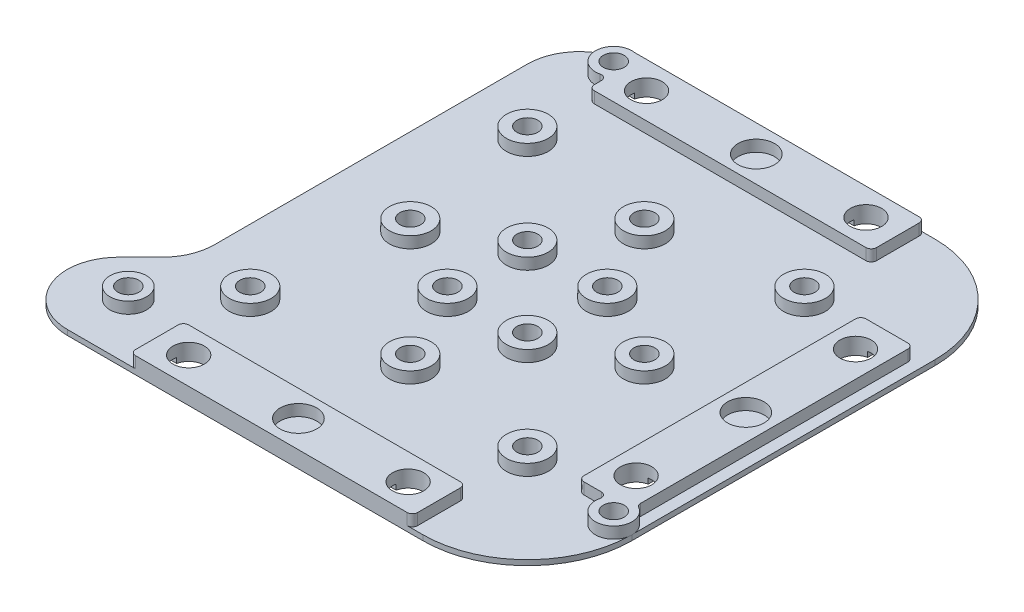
ISO-10303-21;
HEADER;
FILE_DESCRIPTION(('STEP AP214'),'2;1');
FILE_NAME('part.step','',(''),(''),'','','');
FILE_SCHEMA(('AUTOMOTIVE_DESIGN { 1 0 10303 214 1 1 1 1 }'));
ENDSEC;
DATA;
#1=APPLICATION_CONTEXT('core data for automotive mechanical design processes');
#2=APPLICATION_PROTOCOL_DEFINITION('international standard','automotive_design',2000,#1);
#3=PRODUCT_CONTEXT('',#1,'mechanical');
#4=PRODUCT('Part','Part','',(#3));
#5=PRODUCT_RELATED_PRODUCT_CATEGORY('part','',(#4));
#6=PRODUCT_DEFINITION_FORMATION('','',#4);
#7=PRODUCT_DEFINITION_CONTEXT('part definition',#1,'design');
#8=PRODUCT_DEFINITION('design','',#6,#7);
#9=PRODUCT_DEFINITION_SHAPE('','',#8);
#10=(LENGTH_UNIT() NAMED_UNIT(*) SI_UNIT(.MILLI.,.METRE.));
#11=(NAMED_UNIT(*) PLANE_ANGLE_UNIT() SI_UNIT($,.RADIAN.));
#12=(NAMED_UNIT(*) SI_UNIT($,.STERADIAN.) SOLID_ANGLE_UNIT());
#13=UNCERTAINTY_MEASURE_WITH_UNIT(LENGTH_MEASURE(1.E-05),#10,'distance_accuracy_value','');
#14=(GEOMETRIC_REPRESENTATION_CONTEXT(3) GLOBAL_UNCERTAINTY_ASSIGNED_CONTEXT((#13)) GLOBAL_UNIT_ASSIGNED_CONTEXT((#10,
#11,#12)) REPRESENTATION_CONTEXT('',''));
#15=CARTESIAN_POINT('',(0.,0.,0.));
#16=DIRECTION('',(0.,0.,1.));
#17=DIRECTION('',(1.,0.,0.));
#18=AXIS2_PLACEMENT_3D('',#15,#16,#17);
#19=CARTESIAN_POINT('',(45.5431380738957,3.18,29.0141788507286));
#20=DIRECTION('',(0.,1.,0.));
#21=DIRECTION('',(0.,0.,1.));
#22=AXIS2_PLACEMENT_3D('',#19,#20,#21);
#23=PLANE('',#22);
#24=CARTESIAN_POINT('',(41.815,3.18,21.));
#25=DIRECTION('',(0.,1.,0.));
#26=DIRECTION('',(0.,0.,1.));
#27=AXIS2_PLACEMENT_3D('',#24,#25,#26);
#28=CIRCLE('',#27,3.);
#29=CARTESIAN_POINT('',(41.815,3.18,24.));
#30=VERTEX_POINT('',#29);
#31=EDGE_CURVE('E848',#30,#30,#28,.F.);
#32=ORIENTED_EDGE('',*,*,#31,.T.);
#33=EDGE_LOOP('',(#32));
#34=FACE_BOUND('',#33,.T.);
#35=CARTESIAN_POINT('',(41.815,3.18,-21.));
#36=DIRECTION('',(0.,1.,0.));
#37=DIRECTION('',(0.,0.,1.));
#38=AXIS2_PLACEMENT_3D('',#35,#36,#37);
#39=CIRCLE('',#38,3.);
#40=CARTESIAN_POINT('',(41.815,3.18,-18.));
#41=VERTEX_POINT('',#40);
#42=EDGE_CURVE('E832',#41,#41,#39,.F.);
#43=ORIENTED_EDGE('',*,*,#42,.T.);
#44=EDGE_LOOP('',(#43));
#45=FACE_BOUND('',#44,.T.);
#46=CARTESIAN_POINT('',(45.5431380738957,3.18,29.0141788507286));
#47=DIRECTION('',(0.,1.,0.));
#48=DIRECTION('',(0.,0.,1.));
#49=AXIS2_PLACEMENT_3D('',#46,#47,#48);
#50=CIRCLE('',#49,2.00000000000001);
#51=CARTESIAN_POINT('',(45.5431380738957,3.18,31.0141788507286));
#52=VERTEX_POINT('',#51);
#53=EDGE_CURVE('E889',#52,#52,#50,.T.);
#54=ORIENTED_EDGE('',*,*,#53,.F.);
#55=EDGE_LOOP('',(#54));
#56=FACE_BOUND('',#55,.T.);
#57=DIRECTION('',(0.,0.,-1.));
#58=VECTOR('',#57,1.);
#59=CARTESIAN_POINT('',(46.815,3.18,0.));
#60=LINE('',#59,#58);
#61=CARTESIAN_POINT('',(46.815,3.18,25.129768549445));
#62=VERTEX_POINT('',#61);
#63=CARTESIAN_POINT('',(46.815,3.18,-26.));
#64=VERTEX_POINT('',#63);
#65=EDGE_CURVE('E845',#62,#64,#60,.T.);
#66=ORIENTED_EDGE('',*,*,#65,.T.);
#67=CARTESIAN_POINT('',(45.815,3.18,-26.));
#68=DIRECTION('',(0.,1.,0.));
#69=DIRECTION('',(0.,0.,1.));
#70=AXIS2_PLACEMENT_3D('',#67,#68,#69);
#71=CIRCLE('',#70,1.);
#72=CARTESIAN_POINT('',(45.815,3.18,-27.));
#73=VERTEX_POINT('',#72);
#74=EDGE_CURVE('E1239',#64,#73,#71,.T.);
#75=ORIENTED_EDGE('',*,*,#74,.T.);
#76=DIRECTION('',(-1.,0.,0.));
#77=VECTOR('',#76,1.);
#78=CARTESIAN_POINT('',(0.,3.18,-27.));
#79=LINE('',#78,#77);
#80=CARTESIAN_POINT('',(37.815,3.18,-27.));
#81=VERTEX_POINT('',#80);
#82=EDGE_CURVE('E835',#73,#81,#79,.T.);
#83=ORIENTED_EDGE('',*,*,#82,.T.);
#84=CARTESIAN_POINT('',(37.815,3.18,-26.));
#85=DIRECTION('',(0.,1.,0.));
#86=DIRECTION('',(0.,0.,1.));
#87=AXIS2_PLACEMENT_3D('',#84,#85,#86);
#88=CIRCLE('',#87,1.);
#89=CARTESIAN_POINT('',(36.815,3.18,-26.));
#90=VERTEX_POINT('',#89);
#91=EDGE_CURVE('E1237',#81,#90,#88,.T.);
#92=ORIENTED_EDGE('',*,*,#91,.T.);
#93=DIRECTION('',(0.,0.,1.));
#94=VECTOR('',#93,1.);
#95=CARTESIAN_POINT('',(36.815,3.18,0.));
#96=LINE('',#95,#94);
#97=CARTESIAN_POINT('',(36.815,3.18,26.));
#98=VERTEX_POINT('',#97);
#99=EDGE_CURVE('E839',#90,#98,#96,.T.);
#100=ORIENTED_EDGE('',*,*,#99,.T.);
#101=CARTESIAN_POINT('',(37.815,3.18,26.));
#102=DIRECTION('',(0.,1.,0.));
#103=DIRECTION('',(0.,0.,1.));
#104=AXIS2_PLACEMENT_3D('',#101,#102,#103);
#105=CIRCLE('',#104,1.);
#106=CARTESIAN_POINT('',(37.815,3.18,27.));
#107=VERTEX_POINT('',#106);
#108=EDGE_CURVE('E1235',#98,#107,#105,.T.);
#109=ORIENTED_EDGE('',*,*,#108,.T.);
#110=DIRECTION('',(1.,0.,0.));
#111=VECTOR('',#110,1.);
#112=CARTESIAN_POINT('',(0.,3.18,27.));
#113=LINE('',#112,#111);
#114=CARTESIAN_POINT('',(41.1589116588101,3.18,27.));
#115=VERTEX_POINT('',#114);
#116=EDGE_CURVE('E842',#107,#115,#113,.T.);
#117=ORIENTED_EDGE('',*,*,#116,.T.);
#118=CARTESIAN_POINT('',(41.1589116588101,3.18,28.));
#119=DIRECTION('',(0.,1.,0.));
#120=DIRECTION('',(0.,0.,1.));
#121=AXIS2_PLACEMENT_3D('',#118,#119,#120);
#122=CIRCLE('',#121,1.);
#123=CARTESIAN_POINT('',(42.1331841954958,3.18,28.2253730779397));
#124=VERTEX_POINT('',#123);
#125=EDGE_CURVE('E1298',#115,#124,#122,.F.);
#126=ORIENTED_EDGE('',*,*,#125,.T.);
#127=CARTESIAN_POINT('',(45.5431380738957,3.18,29.0141788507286));
#128=DIRECTION('',(0.,1.,0.));
#129=DIRECTION('',(0.,0.,1.));
#130=AXIS2_PLACEMENT_3D('',#127,#128,#129);
#131=CIRCLE('',#130,3.50000000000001);
#132=CARTESIAN_POINT('',(47.3101417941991,3.18,25.9929708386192));
#133=VERTEX_POINT('',#132);
#134=EDGE_CURVE('E894',#124,#133,#131,.T.);
#135=ORIENTED_EDGE('',*,*,#134,.T.);
#136=CARTESIAN_POINT('',(47.815,3.18,25.129768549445));
#137=DIRECTION('',(0.,1.,0.));
#138=DIRECTION('',(0.,0.,1.));
#139=AXIS2_PLACEMENT_3D('',#136,#137,#138);
#140=CIRCLE('',#139,1.);
#141=EDGE_CURVE('E1296',#133,#62,#140,.F.);
#142=ORIENTED_EDGE('',*,*,#141,.T.);
#143=EDGE_LOOP('',(#66,#75,#83,#92,#100,#109,#117,#126,#135,#142));
#144=FACE_BOUND('',#143,.T.);
#145=CARTESIAN_POINT('',(41.815,3.18,0.));
#146=DIRECTION('',(0.,1.,0.));
#147=DIRECTION('',(0.,0.,1.));
#148=AXIS2_PLACEMENT_3D('',#145,#146,#147);
#149=CIRCLE('',#148,3.5);
#150=CARTESIAN_POINT('',(41.815,3.18,3.5));
#151=VERTEX_POINT('',#150);
#152=EDGE_CURVE('E794',#151,#151,#149,.F.);
#153=ORIENTED_EDGE('',*,*,#152,.T.);
#154=EDGE_LOOP('',(#153));
#155=FACE_BOUND('',#154,.T.);
#156=ADVANCED_FACE('F36',(#34,#45,#56,#144,#155),#23,.T.);
#157=CARTESIAN_POINT('',(-29.0141788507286,3.18,-45.5431380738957));
#158=DIRECTION('',(0.,1.,0.));
#159=DIRECTION('',(0.,0.,1.));
#160=AXIS2_PLACEMENT_3D('',#157,#158,#159);
#161=PLANE('',#160);
#162=CARTESIAN_POINT('',(21.,3.18,-43.814));
#163=DIRECTION('',(0.,1.,0.));
#164=DIRECTION('',(0.,0.,1.));
#165=AXIS2_PLACEMENT_3D('',#162,#163,#164);
#166=CIRCLE('',#165,3.);
#167=CARTESIAN_POINT('',(21.,3.18,-40.814));
#168=VERTEX_POINT('',#167);
#169=EDGE_CURVE('E818',#168,#168,#166,.F.);
#170=ORIENTED_EDGE('',*,*,#169,.T.);
#171=EDGE_LOOP('',(#170));
#172=FACE_BOUND('',#171,.T.);
#173=CARTESIAN_POINT('',(-21.,3.18,-43.814));
#174=DIRECTION('',(0.,1.,0.));
#175=DIRECTION('',(0.,0.,1.));
#176=AXIS2_PLACEMENT_3D('',#173,#174,#175);
#177=CIRCLE('',#176,3.);
#178=CARTESIAN_POINT('',(-21.,3.18,-40.814));
#179=VERTEX_POINT('',#178);
#180=EDGE_CURVE('E815',#179,#179,#177,.F.);
#181=ORIENTED_EDGE('',*,*,#180,.T.);
#182=EDGE_LOOP('',(#181));
#183=FACE_BOUND('',#182,.T.);
#184=CARTESIAN_POINT('',(-29.0141788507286,3.18,-45.5431380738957));
#185=DIRECTION('',(0.,1.,0.));
#186=DIRECTION('',(0.,0.,1.));
#187=AXIS2_PLACEMENT_3D('',#184,#185,#186);
#188=CIRCLE('',#187,2.);
#189=CARTESIAN_POINT('',(-29.0141788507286,3.18,-43.5431380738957));
#190=VERTEX_POINT('',#189);
#191=EDGE_CURVE('E903',#190,#190,#188,.T.);
#192=ORIENTED_EDGE('',*,*,#191,.F.);
#193=EDGE_LOOP('',(#192));
#194=FACE_BOUND('',#193,.T.);
#195=DIRECTION('',(-1.,0.,0.));
#196=VECTOR('',#195,1.);
#197=CARTESIAN_POINT('',(0.,3.18,-38.814));
#198=LINE('',#197,#196);
#199=CARTESIAN_POINT('',(26.,3.18,-38.814));
#200=VERTEX_POINT('',#199);
#201=CARTESIAN_POINT('',(-26.,3.18,-38.814));
#202=VERTEX_POINT('',#201);
#203=EDGE_CURVE('E803',#200,#202,#198,.T.);
#204=ORIENTED_EDGE('',*,*,#203,.F.);
#205=CARTESIAN_POINT('',(26.,3.18,-39.814));
#206=DIRECTION('',(0.,1.,0.));
#207=DIRECTION('',(0.,0.,1.));
#208=AXIS2_PLACEMENT_3D('',#205,#206,#207);
#209=CIRCLE('',#208,1.);
#210=CARTESIAN_POINT('',(27.,3.18,-39.814));
#211=VERTEX_POINT('',#210);
#212=EDGE_CURVE('E1207',#200,#211,#209,.T.);
#213=ORIENTED_EDGE('',*,*,#212,.T.);
#214=DIRECTION('',(0.,0.,-1.));
#215=VECTOR('',#214,1.);
#216=CARTESIAN_POINT('',(27.,3.18,0.));
#217=LINE('',#216,#215);
#218=CARTESIAN_POINT('',(27.,3.18,-48.));
#219=VERTEX_POINT('',#218);
#220=EDGE_CURVE('E806',#211,#219,#217,.T.);
#221=ORIENTED_EDGE('',*,*,#220,.T.);
#222=CARTESIAN_POINT('',(26.,3.18,-48.));
#223=DIRECTION('',(0.,1.,0.));
#224=DIRECTION('',(0.,0.,1.));
#225=AXIS2_PLACEMENT_3D('',#222,#223,#224);
#226=CIRCLE('',#225,1.);
#227=CARTESIAN_POINT('',(26.,3.18,-49.));
#228=VERTEX_POINT('',#227);
#229=EDGE_CURVE('E1205',#219,#228,#226,.T.);
#230=ORIENTED_EDGE('',*,*,#229,.T.);
#231=DIRECTION('',(-1.,0.,0.));
#232=VECTOR('',#231,1.);
#233=CARTESIAN_POINT('',(0.,3.18,-49.));
#234=LINE('',#233,#232);
#235=CARTESIAN_POINT('',(-28.4663598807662,3.18,-49.));
#236=VERTEX_POINT('',#235);
#237=EDGE_CURVE('E810',#228,#236,#234,.T.);
#238=ORIENTED_EDGE('',*,*,#237,.T.);
#239=CARTESIAN_POINT('',(-29.0141788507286,3.18,-45.5431380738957));
#240=DIRECTION('',(0.,1.,0.));
#241=DIRECTION('',(0.,0.,1.));
#242=AXIS2_PLACEMENT_3D('',#239,#240,#241);
#243=CIRCLE('',#242,3.5);
#244=CARTESIAN_POINT('',(-28.2253730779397,3.18,-42.1331841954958));
#245=VERTEX_POINT('',#244);
#246=EDGE_CURVE('E907',#236,#245,#243,.T.);
#247=ORIENTED_EDGE('',*,*,#246,.T.);
#248=CARTESIAN_POINT('',(-28.,3.18,-41.1589116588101));
#249=DIRECTION('',(0.,1.,0.));
#250=DIRECTION('',(0.,0.,1.));
#251=AXIS2_PLACEMENT_3D('',#248,#249,#250);
#252=CIRCLE('',#251,1.);
#253=CARTESIAN_POINT('',(-27.,3.18,-41.1589116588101));
#254=VERTEX_POINT('',#253);
#255=EDGE_CURVE('E1290',#245,#254,#252,.F.);
#256=ORIENTED_EDGE('',*,*,#255,.T.);
#257=DIRECTION('',(0.,0.,-1.));
#258=VECTOR('',#257,1.);
#259=CARTESIAN_POINT('',(-27.,3.18,0.));
#260=LINE('',#259,#258);
#261=CARTESIAN_POINT('',(-27.,3.18,-39.814));
#262=VERTEX_POINT('',#261);
#263=EDGE_CURVE('E812',#262,#254,#260,.T.);
#264=ORIENTED_EDGE('',*,*,#263,.F.);
#265=CARTESIAN_POINT('',(-26.,3.18,-39.814));
#266=DIRECTION('',(0.,1.,0.));
#267=DIRECTION('',(0.,0.,1.));
#268=AXIS2_PLACEMENT_3D('',#265,#266,#267);
#269=CIRCLE('',#268,1.);
#270=EDGE_CURVE('E1203',#262,#202,#269,.T.);
#271=ORIENTED_EDGE('',*,*,#270,.T.);
#272=EDGE_LOOP('',(#204,#213,#221,#230,#238,#247,#256,#264,#271));
#273=FACE_BOUND('',#272,.T.);
#274=CARTESIAN_POINT('',(0.,3.18,-43.814));
#275=DIRECTION('',(0.,1.,0.));
#276=DIRECTION('',(0.,0.,1.));
#277=AXIS2_PLACEMENT_3D('',#274,#275,#276);
#278=CIRCLE('',#277,3.5);
#279=CARTESIAN_POINT('',(0.,3.18,-40.314));
#280=VERTEX_POINT('',#279);
#281=EDGE_CURVE('E798',#280,#280,#278,.F.);
#282=ORIENTED_EDGE('',*,*,#281,.T.);
#283=EDGE_LOOP('',(#282));
#284=FACE_BOUND('',#283,.T.);
#285=ADVANCED_FACE('F1431',(#172,#183,#194,#273,#284),#161,.T.);
#286=CARTESIAN_POINT('',(0.,3.18,0.));
#287=DIRECTION('',(0.,1.,0.));
#288=DIRECTION('',(0.,0.,1.));
#289=AXIS2_PLACEMENT_3D('',#286,#287,#288);
#290=PLANE('',#289);
#291=CARTESIAN_POINT('',(21.,3.18,43.814));
#292=DIRECTION('',(0.,1.,0.));
#293=DIRECTION('',(0.,0.,1.));
#294=AXIS2_PLACEMENT_3D('',#291,#292,#293);
#295=CIRCLE('',#294,3.);
#296=CARTESIAN_POINT('',(21.,3.18,46.814));
#297=VERTEX_POINT('',#296);
#298=EDGE_CURVE('E878',#297,#297,#295,.F.);
#299=ORIENTED_EDGE('',*,*,#298,.T.);
#300=EDGE_LOOP('',(#299));
#301=FACE_BOUND('',#300,.T.);
#302=CARTESIAN_POINT('',(-21.,3.18,43.814));
#303=DIRECTION('',(0.,1.,0.));
#304=DIRECTION('',(0.,0.,1.));
#305=AXIS2_PLACEMENT_3D('',#302,#303,#304);
#306=CIRCLE('',#305,3.);
#307=CARTESIAN_POINT('',(-21.,3.18,46.814));
#308=VERTEX_POINT('',#307);
#309=EDGE_CURVE('E875',#308,#308,#306,.F.);
#310=ORIENTED_EDGE('',*,*,#309,.T.);
#311=EDGE_LOOP('',(#310));
#312=FACE_BOUND('',#311,.T.);
#313=DIRECTION('',(1.,0.,0.));
#314=VECTOR('',#313,1.);
#315=CARTESIAN_POINT('',(0.,3.18,49.));
#316=LINE('',#315,#314);
#317=CARTESIAN_POINT('',(-26.,3.18,49.));
#318=VERTEX_POINT('',#317);
#319=CARTESIAN_POINT('',(26.,3.18,49.));
#320=VERTEX_POINT('',#319);
#321=EDGE_CURVE('E872',#318,#320,#316,.T.);
#322=ORIENTED_EDGE('',*,*,#321,.T.);
#323=CARTESIAN_POINT('',(26.,3.18,48.));
#324=DIRECTION('',(0.,1.,0.));
#325=DIRECTION('',(0.,0.,1.));
#326=AXIS2_PLACEMENT_3D('',#323,#324,#325);
#327=CIRCLE('',#326,1.);
#328=CARTESIAN_POINT('',(27.,3.18,48.));
#329=VERTEX_POINT('',#328);
#330=EDGE_CURVE('E1272',#320,#329,#327,.T.);
#331=ORIENTED_EDGE('',*,*,#330,.T.);
#332=DIRECTION('',(0.,0.,1.));
#333=VECTOR('',#332,1.);
#334=CARTESIAN_POINT('',(27.,3.18,0.));
#335=LINE('',#334,#333);
#336=CARTESIAN_POINT('',(27.,3.18,39.814));
#337=VERTEX_POINT('',#336);
#338=EDGE_CURVE('E862',#337,#329,#335,.T.);
#339=ORIENTED_EDGE('',*,*,#338,.F.);
#340=CARTESIAN_POINT('',(26.,3.18,39.814));
#341=DIRECTION('',(0.,1.,0.));
#342=DIRECTION('',(0.,0.,1.));
#343=AXIS2_PLACEMENT_3D('',#340,#341,#342);
#344=CIRCLE('',#343,1.);
#345=CARTESIAN_POINT('',(26.,3.18,38.814));
#346=VERTEX_POINT('',#345);
#347=EDGE_CURVE('E1270',#337,#346,#344,.T.);
#348=ORIENTED_EDGE('',*,*,#347,.T.);
#349=DIRECTION('',(-1.,0.,0.));
#350=VECTOR('',#349,1.);
#351=CARTESIAN_POINT('',(0.,3.18,38.814));
#352=LINE('',#351,#350);
#353=CARTESIAN_POINT('',(-26.,3.18,38.814));
#354=VERTEX_POINT('',#353);
#355=EDGE_CURVE('E865',#346,#354,#352,.T.);
#356=ORIENTED_EDGE('',*,*,#355,.T.);
#357=CARTESIAN_POINT('',(-26.,3.18,39.814));
#358=DIRECTION('',(0.,1.,0.));
#359=DIRECTION('',(0.,0.,1.));
#360=AXIS2_PLACEMENT_3D('',#357,#358,#359);
#361=CIRCLE('',#360,1.);
#362=CARTESIAN_POINT('',(-27.,3.18,39.814));
#363=VERTEX_POINT('',#362);
#364=EDGE_CURVE('E1268',#354,#363,#361,.T.);
#365=ORIENTED_EDGE('',*,*,#364,.T.);
#366=DIRECTION('',(0.,0.,1.));
#367=VECTOR('',#366,1.);
#368=CARTESIAN_POINT('',(-27.,3.18,0.));
#369=LINE('',#368,#367);
#370=CARTESIAN_POINT('',(-27.,3.18,48.));
#371=VERTEX_POINT('',#370);
#372=EDGE_CURVE('E869',#363,#371,#369,.T.);
#373=ORIENTED_EDGE('',*,*,#372,.T.);
#374=CARTESIAN_POINT('',(-26.,3.18,48.));
#375=DIRECTION('',(0.,1.,0.));
#376=DIRECTION('',(0.,0.,1.));
#377=AXIS2_PLACEMENT_3D('',#374,#375,#376);
#378=CIRCLE('',#377,1.);
#379=EDGE_CURVE('E1266',#371,#318,#378,.T.);
#380=ORIENTED_EDGE('',*,*,#379,.T.);
#381=EDGE_LOOP('',(#322,#331,#339,#348,#356,#365,#373,#380));
#382=FACE_BOUND('',#381,.T.);
#383=CARTESIAN_POINT('',(0.,3.18,43.814));
#384=DIRECTION('',(0.,1.,0.));
#385=DIRECTION('',(0.,0.,1.));
#386=AXIS2_PLACEMENT_3D('',#383,#384,#385);
#387=CIRCLE('',#386,3.5);
#388=CARTESIAN_POINT('',(0.,3.18,47.314));
#389=VERTEX_POINT('',#388);
#390=EDGE_CURVE('E802',#389,#389,#387,.F.);
#391=ORIENTED_EDGE('',*,*,#390,.T.);
#392=EDGE_LOOP('',(#391));
#393=FACE_BOUND('',#392,.T.);
#394=ADVANCED_FACE('F1437',(#301,#312,#382,#393),#290,.T.);
#395=CARTESIAN_POINT('',(0.,1.,0.));
#396=DIRECTION('',(0.,-1.,0.));
#397=DIRECTION('',(0.,0.,-1.));
#398=AXIS2_PLACEMENT_3D('',#395,#396,#397);
#399=PLANE('',#398);
#400=CARTESIAN_POINT('',(26.5165042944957,1.,26.5165042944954));
#401=DIRECTION('',(0.,-1.,0.));
#402=DIRECTION('',(0.,0.,-1.));
#403=AXIS2_PLACEMENT_3D('',#400,#401,#402);
#404=CIRCLE('',#403,4.0025);
#405=CARTESIAN_POINT('',(26.5165042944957,1.,22.5140042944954));
#406=VERTEX_POINT('',#405);
#407=EDGE_CURVE('E1095',#406,#406,#404,.F.);
#408=ORIENTED_EDGE('',*,*,#407,.F.);
#409=EDGE_LOOP('',(#408));
#410=FACE_BOUND('',#409,.T.);
#411=CARTESIAN_POINT('',(-26.5165042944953,1.,26.5165042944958));
#412=DIRECTION('',(0.,-1.,0.));
#413=DIRECTION('',(0.,0.,-1.));
#414=AXIS2_PLACEMENT_3D('',#411,#412,#413);
#415=CIRCLE('',#414,4.00250000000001);
#416=CARTESIAN_POINT('',(-26.5165042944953,1.,22.5140042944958));
#417=VERTEX_POINT('',#416);
#418=EDGE_CURVE('E1089',#417,#417,#415,.F.);
#419=ORIENTED_EDGE('',*,*,#418,.F.);
#420=EDGE_LOOP('',(#419));
#421=FACE_BOUND('',#420,.T.);
#422=CARTESIAN_POINT('',(7.65089537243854,1.,7.65089537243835));
#423=DIRECTION('',(0.,-1.,0.));
#424=DIRECTION('',(0.,0.,-1.));
#425=AXIS2_PLACEMENT_3D('',#422,#423,#424);
#426=CIRCLE('',#425,4.0025);
#427=CARTESIAN_POINT('',(7.65089537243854,1.,3.64839537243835));
#428=VERTEX_POINT('',#427);
#429=EDGE_CURVE('E1083',#428,#428,#426,.F.);
#430=ORIENTED_EDGE('',*,*,#429,.F.);
#431=EDGE_LOOP('',(#430));
#432=FACE_BOUND('',#431,.T.);
#433=CARTESIAN_POINT('',(-22.4,1.,1.66494116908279E-13));
#434=DIRECTION('',(0.,-1.,0.));
#435=DIRECTION('',(0.,0.,-1.));
#436=AXIS2_PLACEMENT_3D('',#433,#434,#435);
#437=CIRCLE('',#436,4.0025);
#438=CARTESIAN_POINT('',(-22.4,1.,-4.00249999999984));
#439=VERTEX_POINT('',#438);
#440=EDGE_CURVE('E1077',#439,#439,#437,.F.);
#441=ORIENTED_EDGE('',*,*,#440,.F.);
#442=EDGE_LOOP('',(#441));
#443=FACE_BOUND('',#442,.T.);
#444=CARTESIAN_POINT('',(-7.65089537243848,1.,-7.6508953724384));
#445=DIRECTION('',(0.,-1.,0.));
#446=DIRECTION('',(0.,0.,-1.));
#447=AXIS2_PLACEMENT_3D('',#444,#445,#446);
#448=CIRCLE('',#447,4.0025);
#449=CARTESIAN_POINT('',(-7.65089537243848,1.,-11.6533953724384));
#450=VERTEX_POINT('',#449);
#451=EDGE_CURVE('E1071',#450,#450,#448,.F.);
#452=ORIENTED_EDGE('',*,*,#451,.F.);
#453=EDGE_LOOP('',(#452));
#454=FACE_BOUND('',#453,.T.);
#455=CARTESIAN_POINT('',(0.,1.,-22.4));
#456=DIRECTION('',(0.,-1.,0.));
#457=DIRECTION('',(0.,0.,-1.));
#458=AXIS2_PLACEMENT_3D('',#455,#456,#457);
#459=CIRCLE('',#458,4.0025);
#460=CARTESIAN_POINT('',(0.,1.,-26.4025));
#461=VERTEX_POINT('',#460);
#462=EDGE_CURVE('E1065',#461,#461,#459,.F.);
#463=ORIENTED_EDGE('',*,*,#462,.F.);
#464=EDGE_LOOP('',(#463));
#465=FACE_BOUND('',#464,.T.);
#466=CARTESIAN_POINT('',(-26.5165042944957,1.,-26.5165042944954));
#467=DIRECTION('',(0.,-1.,0.));
#468=DIRECTION('',(0.,0.,-1.));
#469=AXIS2_PLACEMENT_3D('',#466,#467,#468);
#470=CIRCLE('',#469,4.0025);
#471=CARTESIAN_POINT('',(-26.5165042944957,1.,-30.5190042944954));
#472=VERTEX_POINT('',#471);
#473=EDGE_CURVE('E1056',#472,#472,#470,.F.);
#474=ORIENTED_EDGE('',*,*,#473,.F.);
#475=EDGE_LOOP('',(#474));
#476=FACE_BOUND('',#475,.T.);
#477=CARTESIAN_POINT('',(26.5165042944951,1.,-26.516504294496));
#478=DIRECTION('',(0.,-1.,0.));
#479=DIRECTION('',(0.,0.,-1.));
#480=AXIS2_PLACEMENT_3D('',#477,#478,#479);
#481=CIRCLE('',#480,4.0025);
#482=CARTESIAN_POINT('',(26.5165042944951,1.,-30.519004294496));
#483=VERTEX_POINT('',#482);
#484=EDGE_CURVE('E1068',#483,#483,#481,.F.);
#485=ORIENTED_EDGE('',*,*,#484,.F.);
#486=EDGE_LOOP('',(#485));
#487=FACE_BOUND('',#486,.T.);
#488=CARTESIAN_POINT('',(7.65089537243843,1.,-7.65089537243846));
#489=DIRECTION('',(0.,-1.,0.));
#490=DIRECTION('',(0.,0.,-1.));
#491=AXIS2_PLACEMENT_3D('',#488,#489,#490);
#492=CIRCLE('',#491,4.0025);
#493=CARTESIAN_POINT('',(7.65089537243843,1.,-11.6533953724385));
#494=VERTEX_POINT('',#493);
#495=EDGE_CURVE('E1074',#494,#494,#492,.F.);
#496=ORIENTED_EDGE('',*,*,#495,.F.);
#497=EDGE_LOOP('',(#496));
#498=FACE_BOUND('',#497,.T.);
#499=CARTESIAN_POINT('',(-7.65089537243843,1.,7.65089537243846));
#500=DIRECTION('',(0.,-1.,0.));
#501=DIRECTION('',(0.,0.,-1.));
#502=AXIS2_PLACEMENT_3D('',#499,#500,#501);
#503=CIRCLE('',#502,4.0025);
#504=CARTESIAN_POINT('',(-7.65089537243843,1.,3.64839537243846));
#505=VERTEX_POINT('',#504);
#506=EDGE_CURVE('E1080',#505,#505,#503,.F.);
#507=ORIENTED_EDGE('',*,*,#506,.F.);
#508=EDGE_LOOP('',(#507));
#509=FACE_BOUND('',#508,.T.);
#510=CARTESIAN_POINT('',(22.4,1.,-3.22912480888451E-13));
#511=DIRECTION('',(0.,-1.,0.));
#512=DIRECTION('',(0.,0.,-1.));
#513=AXIS2_PLACEMENT_3D('',#510,#511,#512);
#514=CIRCLE('',#513,4.0025);
#515=CARTESIAN_POINT('',(22.4,1.,-4.00250000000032));
#516=VERTEX_POINT('',#515);
#517=EDGE_CURVE('E1086',#516,#516,#514,.F.);
#518=ORIENTED_EDGE('',*,*,#517,.F.);
#519=EDGE_LOOP('',(#518));
#520=FACE_BOUND('',#519,.T.);
#521=CARTESIAN_POINT('',(0.,1.,22.4));
#522=DIRECTION('',(0.,-1.,0.));
#523=DIRECTION('',(0.,0.,-1.));
#524=AXIS2_PLACEMENT_3D('',#521,#522,#523);
#525=CIRCLE('',#524,4.0025);
#526=CARTESIAN_POINT('',(0.,1.,18.3975));
#527=VERTEX_POINT('',#526);
#528=EDGE_CURVE('E1092',#527,#527,#525,.F.);
#529=ORIENTED_EDGE('',*,*,#528,.F.);
#530=EDGE_LOOP('',(#529));
#531=FACE_BOUND('',#530,.T.);
#532=CARTESIAN_POINT('',(-38.1837661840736,1.,38.1837661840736));
#533=DIRECTION('',(0.,-1.,0.));
#534=DIRECTION('',(0.,0.,-1.));
#535=AXIS2_PLACEMENT_3D('',#532,#533,#534);
#536=CIRCLE('',#535,3.5);
#537=CARTESIAN_POINT('',(-38.1837661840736,1.,34.6837661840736));
#538=VERTEX_POINT('',#537);
#539=EDGE_CURVE('E1138',#538,#538,#536,.F.);
#540=ORIENTED_EDGE('',*,*,#539,.F.);
#541=EDGE_LOOP('',(#540));
#542=FACE_BOUND('',#541,.T.);
#543=DIRECTION('',(0.,0.,-1.));
#544=VECTOR('',#543,1.);
#545=CARTESIAN_POINT('',(-27.,1.,0.));
#546=LINE('',#545,#544);
#547=CARTESIAN_POINT('',(-27.,1.,-39.814));
#548=VERTEX_POINT('',#547);
#549=CARTESIAN_POINT('',(-27.,1.,-41.1589116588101));
#550=VERTEX_POINT('',#549);
#551=EDGE_CURVE('E807',#548,#550,#546,.T.);
#552=ORIENTED_EDGE('',*,*,#551,.T.);
#553=CARTESIAN_POINT('',(-28.,1.,-41.1589116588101));
#554=DIRECTION('',(0.,-1.,0.));
#555=DIRECTION('',(0.,0.,-1.));
#556=AXIS2_PLACEMENT_3D('',#553,#554,#555);
#557=CIRCLE('',#556,1.);
#558=CARTESIAN_POINT('',(-28.2253730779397,1.,-42.1331841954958));
#559=VERTEX_POINT('',#558);
#560=EDGE_CURVE('E1221',#550,#559,#557,.F.);
#561=ORIENTED_EDGE('',*,*,#560,.T.);
#562=CARTESIAN_POINT('',(-29.0141788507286,1.,-45.5431380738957));
#563=DIRECTION('',(0.,1.,0.));
#564=DIRECTION('',(0.,0.,1.));
#565=AXIS2_PLACEMENT_3D('',#562,#563,#564);
#566=CIRCLE('',#565,3.5);
#567=CARTESIAN_POINT('',(-29.6985911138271,1.,-48.9755686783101));
#568=VERTEX_POINT('',#567);
#569=EDGE_CURVE('E906',#568,#559,#566,.T.);
#570=ORIENTED_EDGE('',*,*,#569,.F.);
#571=CARTESIAN_POINT('',(-29.,1.,-39.));
#572=DIRECTION('',(0.,-1.,0.));
#573=DIRECTION('',(0.,0.,-1.));
#574=AXIS2_PLACEMENT_3D('',#571,#572,#573);
#575=CIRCLE('',#574,10.);
#576=CARTESIAN_POINT('',(-39.,1.,-39.));
#577=VERTEX_POINT('',#576);
#578=EDGE_CURVE('E1111',#568,#577,#575,.F.);
#579=ORIENTED_EDGE('',*,*,#578,.T.);
#580=DIRECTION('',(0.,0.,-1.));
#581=VECTOR('',#580,1.);
#582=CARTESIAN_POINT('',(-39.,1.,-49.));
#583=LINE('',#582,#581);
#584=CARTESIAN_POINT('',(-39.,1.,20.8578643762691));
#585=VERTEX_POINT('',#584);
#586=EDGE_CURVE('E926',#585,#577,#583,.T.);
#587=ORIENTED_EDGE('',*,*,#586,.F.);
#588=CARTESIAN_POINT('',(-49.,1.,20.8578643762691));
#589=DIRECTION('',(0.,-1.,0.));
#590=DIRECTION('',(0.,0.,-1.));
#591=AXIS2_PLACEMENT_3D('',#588,#589,#590);
#592=CIRCLE('',#591,10.);
#593=CARTESIAN_POINT('',(-41.9289321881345,1.,27.9289321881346));
#594=VERTEX_POINT('',#593);
#595=EDGE_CURVE('E1134',#585,#594,#592,.T.);
#596=ORIENTED_EDGE('',*,*,#595,.T.);
#597=DIRECTION('',(0.707106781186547,0.,-0.707106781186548));
#598=VECTOR('',#597,1.);
#599=CARTESIAN_POINT('',(-39.,1.,25.));
#600=LINE('',#599,#598);
#601=CARTESIAN_POINT('',(-46.0710678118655,1.,32.0710678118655));
#602=VERTEX_POINT('',#601);
#603=EDGE_CURVE('E1098',#594,#602,#600,.F.);
#604=ORIENTED_EDGE('',*,*,#603,.T.);
#605=CARTESIAN_POINT('',(-39.,1.,39.142135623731));
#606=DIRECTION('',(0.,-1.,0.));
#607=DIRECTION('',(0.,0.,-1.));
#608=AXIS2_PLACEMENT_3D('',#605,#606,#607);
#609=CIRCLE('',#608,10.);
#610=CARTESIAN_POINT('',(-48.9997474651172,1.,39.0710678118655));
#611=VERTEX_POINT('',#610);
#612=EDGE_CURVE('E1107',#602,#611,#609,.F.);
#613=ORIENTED_EDGE('',*,*,#612,.T.);
#614=CARTESIAN_POINT('',(-39.,1.,39.));
#615=DIRECTION('',(0.,-1.,0.));
#616=DIRECTION('',(0.,0.,-1.));
#617=AXIS2_PLACEMENT_3D('',#614,#615,#616);
#618=CIRCLE('',#617,10.);
#619=CARTESIAN_POINT('',(-39.,1.,49.));
#620=VERTEX_POINT('',#619);
#621=EDGE_CURVE('E1109',#611,#620,#618,.F.);
#622=ORIENTED_EDGE('',*,*,#621,.T.);
#623=DIRECTION('',(1.,0.,0.));
#624=VECTOR('',#623,1.);
#625=CARTESIAN_POINT('',(-49.,1.,49.));
#626=LINE('',#625,#624);
#627=CARTESIAN_POINT('',(-26.,1.,49.));
#628=VERTEX_POINT('',#627);
#629=EDGE_CURVE('E1054',#620,#628,#626,.T.);
#630=ORIENTED_EDGE('',*,*,#629,.T.);
#631=CARTESIAN_POINT('',(-26.,1.,48.));
#632=DIRECTION('',(0.,-1.,0.));
#633=DIRECTION('',(0.,0.,-1.));
#634=AXIS2_PLACEMENT_3D('',#631,#632,#633);
#635=CIRCLE('',#634,1.);
#636=CARTESIAN_POINT('',(-27.,1.,48.));
#637=VERTEX_POINT('',#636);
#638=EDGE_CURVE('E1309',#628,#637,#635,.T.);
#639=ORIENTED_EDGE('',*,*,#638,.T.);
#640=DIRECTION('',(0.,0.,1.));
#641=VECTOR('',#640,1.);
#642=CARTESIAN_POINT('',(-27.,1.,0.));
#643=LINE('',#642,#641);
#644=CARTESIAN_POINT('',(-27.,1.,39.814));
#645=VERTEX_POINT('',#644);
#646=EDGE_CURVE('E866',#645,#637,#643,.T.);
#647=ORIENTED_EDGE('',*,*,#646,.F.);
#648=CARTESIAN_POINT('',(-26.,1.,39.814));
#649=DIRECTION('',(0.,-1.,0.));
#650=DIRECTION('',(0.,0.,-1.));
#651=AXIS2_PLACEMENT_3D('',#648,#649,#650);
#652=CIRCLE('',#651,1.);
#653=CARTESIAN_POINT('',(-26.,1.,38.814));
#654=VERTEX_POINT('',#653);
#655=EDGE_CURVE('E1307',#645,#654,#652,.T.);
#656=ORIENTED_EDGE('',*,*,#655,.T.);
#657=DIRECTION('',(-1.,0.,0.));
#658=VECTOR('',#657,1.);
#659=CARTESIAN_POINT('',(0.,1.,38.814));
#660=LINE('',#659,#658);
#661=CARTESIAN_POINT('',(26.,1.,38.814));
#662=VERTEX_POINT('',#661);
#663=EDGE_CURVE('E884',#662,#654,#660,.T.);
#664=ORIENTED_EDGE('',*,*,#663,.F.);
#665=CARTESIAN_POINT('',(26.,1.,39.814));
#666=DIRECTION('',(0.,-1.,0.));
#667=DIRECTION('',(0.,0.,-1.));
#668=AXIS2_PLACEMENT_3D('',#665,#666,#667);
#669=CIRCLE('',#668,1.);
#670=CARTESIAN_POINT('',(27.,1.,39.814));
#671=VERTEX_POINT('',#670);
#672=EDGE_CURVE('E1305',#662,#671,#669,.T.);
#673=ORIENTED_EDGE('',*,*,#672,.T.);
#674=DIRECTION('',(0.,0.,1.));
#675=VECTOR('',#674,1.);
#676=CARTESIAN_POINT('',(27.,1.,0.));
#677=LINE('',#676,#675);
#678=CARTESIAN_POINT('',(27.,1.,48.));
#679=VERTEX_POINT('',#678);
#680=EDGE_CURVE('E851',#671,#679,#677,.T.);
#681=ORIENTED_EDGE('',*,*,#680,.T.);
#682=CARTESIAN_POINT('',(26.,1.,48.));
#683=DIRECTION('',(0.,-1.,0.));
#684=DIRECTION('',(0.,0.,-1.));
#685=AXIS2_PLACEMENT_3D('',#682,#683,#684);
#686=CIRCLE('',#685,1.);
#687=CARTESIAN_POINT('',(26.,1.,49.));
#688=VERTEX_POINT('',#687);
#689=EDGE_CURVE('E1302',#679,#688,#686,.T.);
#690=ORIENTED_EDGE('',*,*,#689,.T.);
#691=CARTESIAN_POINT('',(29.,1.,49.));
#692=VERTEX_POINT('',#691);
#693=EDGE_CURVE('E1053',#688,#692,#626,.T.);
#694=ORIENTED_EDGE('',*,*,#693,.T.);
#695=CARTESIAN_POINT('',(29.,1.,29.));
#696=DIRECTION('',(0.,-1.,0.));
#697=DIRECTION('',(0.,0.,-1.));
#698=AXIS2_PLACEMENT_3D('',#695,#696,#697);
#699=CIRCLE('',#698,20.);
#700=CARTESIAN_POINT('',(48.9904047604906,1.,29.6194493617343));
#701=VERTEX_POINT('',#700);
#702=EDGE_CURVE('E1179',#692,#701,#699,.F.);
#703=ORIENTED_EDGE('',*,*,#702,.T.);
#704=CARTESIAN_POINT('',(45.5431380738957,1.,29.0141788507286));
#705=DIRECTION('',(0.,1.,0.));
#706=DIRECTION('',(0.,0.,1.));
#707=AXIS2_PLACEMENT_3D('',#704,#705,#706);
#708=CIRCLE('',#707,3.50000000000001);
#709=CARTESIAN_POINT('',(42.1331841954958,1.,28.2253730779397));
#710=VERTEX_POINT('',#709);
#711=EDGE_CURVE('E892',#710,#701,#708,.T.);
#712=ORIENTED_EDGE('',*,*,#711,.F.);
#713=CARTESIAN_POINT('',(41.1589116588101,1.,28.));
#714=DIRECTION('',(0.,-1.,0.));
#715=DIRECTION('',(0.,0.,-1.));
#716=AXIS2_PLACEMENT_3D('',#713,#714,#715);
#717=CIRCLE('',#716,1.);
#718=CARTESIAN_POINT('',(41.1589116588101,1.,27.));
#719=VERTEX_POINT('',#718);
#720=EDGE_CURVE('E1217',#710,#719,#717,.F.);
#721=ORIENTED_EDGE('',*,*,#720,.T.);
#722=DIRECTION('',(1.,0.,0.));
#723=VECTOR('',#722,1.);
#724=CARTESIAN_POINT('',(0.,1.,27.));
#725=LINE('',#724,#723);
#726=CARTESIAN_POINT('',(37.815,1.,27.));
#727=VERTEX_POINT('',#726);
#728=EDGE_CURVE('E857',#727,#719,#725,.T.);
#729=ORIENTED_EDGE('',*,*,#728,.F.);
#730=CARTESIAN_POINT('',(37.815,1.,26.));
#731=DIRECTION('',(0.,-1.,0.));
#732=DIRECTION('',(0.,0.,-1.));
#733=AXIS2_PLACEMENT_3D('',#730,#731,#732);
#734=CIRCLE('',#733,1.);
#735=CARTESIAN_POINT('',(36.815,1.,26.));
#736=VERTEX_POINT('',#735);
#737=EDGE_CURVE('E1300',#727,#736,#734,.T.);
#738=ORIENTED_EDGE('',*,*,#737,.T.);
#739=DIRECTION('',(0.,0.,1.));
#740=VECTOR('',#739,1.);
#741=CARTESIAN_POINT('',(36.815,1.,0.));
#742=LINE('',#741,#740);
#743=CARTESIAN_POINT('',(36.815,1.,-26.));
#744=VERTEX_POINT('',#743);
#745=EDGE_CURVE('E854',#744,#736,#742,.T.);
#746=ORIENTED_EDGE('',*,*,#745,.F.);
#747=CARTESIAN_POINT('',(37.815,1.,-26.));
#748=DIRECTION('',(0.,-1.,0.));
#749=DIRECTION('',(0.,0.,-1.));
#750=AXIS2_PLACEMENT_3D('',#747,#748,#749);
#751=CIRCLE('',#750,1.);
#752=CARTESIAN_POINT('',(37.815,1.,-27.));
#753=VERTEX_POINT('',#752);
#754=EDGE_CURVE('E1294',#744,#753,#751,.T.);
#755=ORIENTED_EDGE('',*,*,#754,.T.);
#756=DIRECTION('',(-1.,0.,0.));
#757=VECTOR('',#756,1.);
#758=CARTESIAN_POINT('',(0.,1.,-27.));
#759=LINE('',#758,#757);
#760=CARTESIAN_POINT('',(45.815,1.,-27.));
#761=VERTEX_POINT('',#760);
#762=EDGE_CURVE('E831',#761,#753,#759,.T.);
#763=ORIENTED_EDGE('',*,*,#762,.F.);
#764=CARTESIAN_POINT('',(45.815,1.,-26.));
#765=DIRECTION('',(0.,-1.,0.));
#766=DIRECTION('',(0.,0.,-1.));
#767=AXIS2_PLACEMENT_3D('',#764,#765,#766);
#768=CIRCLE('',#767,1.);
#769=CARTESIAN_POINT('',(46.815,1.,-26.));
#770=VERTEX_POINT('',#769);
#771=EDGE_CURVE('E1292',#761,#770,#768,.T.);
#772=ORIENTED_EDGE('',*,*,#771,.T.);
#773=DIRECTION('',(0.,0.,-1.));
#774=VECTOR('',#773,1.);
#775=CARTESIAN_POINT('',(46.815,1.,0.));
#776=LINE('',#775,#774);
#777=CARTESIAN_POINT('',(46.815,1.,25.129768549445));
#778=VERTEX_POINT('',#777);
#779=EDGE_CURVE('E836',#778,#770,#776,.T.);
#780=ORIENTED_EDGE('',*,*,#779,.F.);
#781=CARTESIAN_POINT('',(47.815,1.,25.129768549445));
#782=DIRECTION('',(0.,-1.,0.));
#783=DIRECTION('',(0.,0.,-1.));
#784=AXIS2_PLACEMENT_3D('',#781,#782,#783);
#785=CIRCLE('',#784,1.);
#786=CARTESIAN_POINT('',(47.3101417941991,1.,25.9929708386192));
#787=VERTEX_POINT('',#786);
#788=EDGE_CURVE('E1219',#778,#787,#785,.F.);
#789=ORIENTED_EDGE('',*,*,#788,.T.);
#790=CARTESIAN_POINT('',(49.,1.,28.466359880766));
#791=VERTEX_POINT('',#790);
#792=EDGE_CURVE('E901',#791,#787,#708,.T.);
#793=ORIENTED_EDGE('',*,*,#792,.F.);
#794=DIRECTION('',(0.,0.,-1.));
#795=VECTOR('',#794,1.);
#796=CARTESIAN_POINT('',(49.,1.,49.));
#797=LINE('',#796,#795);
#798=CARTESIAN_POINT('',(49.,1.,-29.));
#799=VERTEX_POINT('',#798);
#800=EDGE_CURVE('E1047',#791,#799,#797,.T.);
#801=ORIENTED_EDGE('',*,*,#800,.T.);
#802=CARTESIAN_POINT('',(29.,1.,-29.));
#803=DIRECTION('',(0.,-1.,0.));
#804=DIRECTION('',(0.,0.,-1.));
#805=AXIS2_PLACEMENT_3D('',#802,#803,#804);
#806=CIRCLE('',#805,20.);
#807=CARTESIAN_POINT('',(29.,1.,-49.));
#808=VERTEX_POINT('',#807);
#809=EDGE_CURVE('E1177',#799,#808,#806,.F.);
#810=ORIENTED_EDGE('',*,*,#809,.T.);
#811=DIRECTION('',(-1.,0.,0.));
#812=VECTOR('',#811,1.);
#813=CARTESIAN_POINT('',(-49.,1.,-49.));
#814=LINE('',#813,#812);
#815=CARTESIAN_POINT('',(26.,1.,-49.));
#816=VERTEX_POINT('',#815);
#817=EDGE_CURVE('E1050',#808,#816,#814,.T.);
#818=ORIENTED_EDGE('',*,*,#817,.T.);
#819=CARTESIAN_POINT('',(26.,1.,-48.));
#820=DIRECTION('',(0.,-1.,0.));
#821=DIRECTION('',(0.,0.,-1.));
#822=AXIS2_PLACEMENT_3D('',#819,#820,#821);
#823=CIRCLE('',#822,1.);
#824=CARTESIAN_POINT('',(27.,1.,-48.));
#825=VERTEX_POINT('',#824);
#826=EDGE_CURVE('E1286',#816,#825,#823,.T.);
#827=ORIENTED_EDGE('',*,*,#826,.T.);
#828=DIRECTION('',(0.,0.,-1.));
#829=VECTOR('',#828,1.);
#830=CARTESIAN_POINT('',(27.,1.,0.));
#831=LINE('',#830,#829);
#832=CARTESIAN_POINT('',(27.,1.,-39.814));
#833=VERTEX_POINT('',#832);
#834=EDGE_CURVE('E825',#833,#825,#831,.T.);
#835=ORIENTED_EDGE('',*,*,#834,.F.);
#836=CARTESIAN_POINT('',(26.,1.,-39.814));
#837=DIRECTION('',(0.,-1.,0.));
#838=DIRECTION('',(0.,0.,-1.));
#839=AXIS2_PLACEMENT_3D('',#836,#837,#838);
#840=CIRCLE('',#839,1.);
#841=CARTESIAN_POINT('',(26.,1.,-38.814));
#842=VERTEX_POINT('',#841);
#843=EDGE_CURVE('E1284',#833,#842,#840,.T.);
#844=ORIENTED_EDGE('',*,*,#843,.T.);
#845=DIRECTION('',(-1.,0.,0.));
#846=VECTOR('',#845,1.);
#847=CARTESIAN_POINT('',(0.,1.,-38.814));
#848=LINE('',#847,#846);
#849=CARTESIAN_POINT('',(-26.,1.,-38.814));
#850=VERTEX_POINT('',#849);
#851=EDGE_CURVE('E822',#842,#850,#848,.T.);
#852=ORIENTED_EDGE('',*,*,#851,.T.);
#853=CARTESIAN_POINT('',(-26.,1.,-39.814));
#854=DIRECTION('',(0.,-1.,0.));
#855=DIRECTION('',(0.,0.,-1.));
#856=AXIS2_PLACEMENT_3D('',#853,#854,#855);
#857=CIRCLE('',#856,1.);
#858=EDGE_CURVE('E1288',#850,#548,#857,.T.);
#859=ORIENTED_EDGE('',*,*,#858,.T.);
#860=EDGE_LOOP('',(#552,#561,#570,#579,#587,#596,#604,#613,#622,#630,#639,#647,#656,#664,#673,
#681,#690,#694,#703,#712,#721,#729,#738,#746,#755,#763,#772,#780,#789,#793,#801,#810,#818,#827,
#835,#844,#852,#859));
#861=FACE_BOUND('',#860,.T.);
#862=ADVANCED_FACE('F1462',(#410,#421,#432,#443,#454,#465,#476,#487,#498,#509,#520,#531,#542,
#861),#399,.F.);
#863=CARTESIAN_POINT('',(-29.0141788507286,3.18,-45.5431380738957));
#864=DIRECTION('',(0.,-1.,0.));
#865=DIRECTION('',(0.,0.,-1.));
#866=AXIS2_PLACEMENT_3D('',#863,#864,#865);
#867=CYLINDRICAL_SURFACE('',#866,3.5);
#868=ORIENTED_EDGE('',*,*,#569,.T.);
#869=DIRECTION('',(0.,-1.,0.));
#870=VECTOR('',#869,1.);
#871=CARTESIAN_POINT('',(-28.2253730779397,3.18,-42.1331841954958));
#872=LINE('',#871,#870);
#873=EDGE_CURVE('E1223',#559,#245,#872,.F.);
#874=ORIENTED_EDGE('',*,*,#873,.T.);
#875=ORIENTED_EDGE('',*,*,#246,.F.);
#876=DIRECTION('',(0.,-1.,0.));
#877=VECTOR('',#876,1.);
#878=CARTESIAN_POINT('',(-28.4663598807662,3.18,-49.));
#879=LINE('',#878,#877);
#880=CARTESIAN_POINT('',(-28.4663598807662,1.,-49.));
#881=VERTEX_POINT('',#880);
#882=EDGE_CURVE('E821',#236,#881,#879,.T.);
#883=ORIENTED_EDGE('',*,*,#882,.T.);
#884=EDGE_CURVE('E911',#881,#568,#566,.T.);
#885=ORIENTED_EDGE('',*,*,#884,.T.);
#886=EDGE_LOOP('',(#868,#874,#875,#883,#885));
#887=FACE_BOUND('',#886,.T.);
#888=ADVANCED_FACE('F1453',(#887),#867,.T.);
#889=CARTESIAN_POINT('',(45.5431380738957,3.18,29.0141788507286));
#890=DIRECTION('',(0.,-1.,0.));
#891=DIRECTION('',(0.,0.,-1.));
#892=AXIS2_PLACEMENT_3D('',#889,#890,#891);
#893=CYLINDRICAL_SURFACE('',#892,3.50000000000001);
#894=ORIENTED_EDGE('',*,*,#792,.T.);
#895=DIRECTION('',(0.,-1.,0.));
#896=VECTOR('',#895,1.);
#897=CARTESIAN_POINT('',(47.3101417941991,3.18,25.9929708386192));
#898=LINE('',#897,#896);
#899=EDGE_CURVE('E1249',#787,#133,#898,.F.);
#900=ORIENTED_EDGE('',*,*,#899,.T.);
#901=ORIENTED_EDGE('',*,*,#134,.F.);
#902=DIRECTION('',(0.,-1.,0.));
#903=VECTOR('',#902,1.);
#904=CARTESIAN_POINT('',(42.1331841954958,3.18,28.2253730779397));
#905=LINE('',#904,#903);
#906=EDGE_CURVE('E1246',#124,#710,#905,.T.);
#907=ORIENTED_EDGE('',*,*,#906,.T.);
#908=ORIENTED_EDGE('',*,*,#711,.T.);
#909=EDGE_CURVE('E898',#701,#791,#708,.T.);
#910=ORIENTED_EDGE('',*,*,#909,.T.);
#911=EDGE_LOOP('',(#894,#900,#901,#907,#908,#910));
#912=FACE_BOUND('',#911,.T.);
#913=ADVANCED_FACE('F1450',(#912),#893,.T.);
#914=CARTESIAN_POINT('',(49.,1.,49.));
#915=DIRECTION('',(-1.,0.,0.));
#916=DIRECTION('',(0.,0.,1.));
#917=AXIS2_PLACEMENT_3D('',#914,#915,#916);
#918=PLANE('',#917);
#919=DIRECTION('',(0.,0.,-1.));
#920=VECTOR('',#919,1.);
#921=CARTESIAN_POINT('',(49.,1.,49.));
#922=LINE('',#921,#920);
#923=CARTESIAN_POINT('',(49.,1.,29.));
#924=VERTEX_POINT('',#923);
#925=EDGE_CURVE('E897',#924,#791,#922,.T.);
#926=ORIENTED_EDGE('',*,*,#925,.F.);
#927=DIRECTION('',(0.,-1.,0.));
#928=VECTOR('',#927,1.);
#929=CARTESIAN_POINT('',(49.,1.,29.));
#930=LINE('',#929,#928);
#931=CARTESIAN_POINT('',(49.,0.,29.));
#932=VERTEX_POINT('',#931);
#933=EDGE_CURVE('E1167',#924,#932,#930,.T.);
#934=ORIENTED_EDGE('',*,*,#933,.T.);
#935=DIRECTION('',(0.,0.,-1.));
#936=VECTOR('',#935,1.);
#937=CARTESIAN_POINT('',(49.,0.,49.));
#938=LINE('',#937,#936);
#939=CARTESIAN_POINT('',(49.,0.,-29.));
#940=VERTEX_POINT('',#939);
#941=EDGE_CURVE('E1046',#932,#940,#938,.T.);
#942=ORIENTED_EDGE('',*,*,#941,.T.);
#943=DIRECTION('',(0.,-1.,0.));
#944=VECTOR('',#943,1.);
#945=CARTESIAN_POINT('',(49.,1.,-29.));
#946=LINE('',#945,#944);
#947=EDGE_CURVE('E1143',#940,#799,#946,.F.);
#948=ORIENTED_EDGE('',*,*,#947,.T.);
#949=ORIENTED_EDGE('',*,*,#800,.F.);
#950=EDGE_LOOP('',(#926,#934,#942,#948,#949));
#951=FACE_BOUND('',#950,.T.);
#952=ADVANCED_FACE('F1452',(#951),#918,.F.);
#953=CARTESIAN_POINT('',(-49.,1.,-49.));
#954=DIRECTION('',(0.,0.,1.));
#955=DIRECTION('',(1.,0.,0.));
#956=AXIS2_PLACEMENT_3D('',#953,#954,#955);
#957=PLANE('',#956);
#958=ORIENTED_EDGE('',*,*,#237,.F.);
#959=DIRECTION('',(0.,-1.,0.));
#960=VECTOR('',#959,1.);
#961=CARTESIAN_POINT('',(26.,1.,-49.));
#962=LINE('',#961,#960);
#963=EDGE_CURVE('E1209',#228,#816,#962,.T.);
#964=ORIENTED_EDGE('',*,*,#963,.T.);
#965=ORIENTED_EDGE('',*,*,#817,.F.);
#966=DIRECTION('',(0.,-1.,0.));
#967=VECTOR('',#966,1.);
#968=CARTESIAN_POINT('',(29.,1.,-49.));
#969=LINE('',#968,#967);
#970=CARTESIAN_POINT('',(29.,0.,-49.));
#971=VERTEX_POINT('',#970);
#972=EDGE_CURVE('E1182',#808,#971,#969,.T.);
#973=ORIENTED_EDGE('',*,*,#972,.T.);
#974=DIRECTION('',(-1.,0.,0.));
#975=VECTOR('',#974,1.);
#976=CARTESIAN_POINT('',(-49.,0.,-49.));
#977=LINE('',#976,#975);
#978=CARTESIAN_POINT('',(-29.,0.,-49.));
#979=VERTEX_POINT('',#978);
#980=EDGE_CURVE('E1059',#971,#979,#977,.T.);
#981=ORIENTED_EDGE('',*,*,#980,.T.);
#982=DIRECTION('',(0.,1.,0.));
#983=VECTOR('',#982,1.);
#984=CARTESIAN_POINT('',(-29.,1.,-49.));
#985=LINE('',#984,#983);
#986=CARTESIAN_POINT('',(-29.,1.,-49.));
#987=VERTEX_POINT('',#986);
#988=EDGE_CURVE('E1104',#979,#987,#985,.T.);
#989=ORIENTED_EDGE('',*,*,#988,.T.);
#990=DIRECTION('',(-1.,0.,0.));
#991=VECTOR('',#990,1.);
#992=CARTESIAN_POINT('',(-49.,1.,-49.));
#993=LINE('',#992,#991);
#994=EDGE_CURVE('E910',#881,#987,#993,.T.);
#995=ORIENTED_EDGE('',*,*,#994,.F.);
#996=ORIENTED_EDGE('',*,*,#882,.F.);
#997=EDGE_LOOP('',(#958,#964,#965,#973,#981,#989,#995,#996));
#998=FACE_BOUND('',#997,.T.);
#999=ADVANCED_FACE('F1641',(#998),#957,.F.);
#1000=CARTESIAN_POINT('',(-49.,1.,49.));
#1001=DIRECTION('',(0.,0.,-1.));
#1002=DIRECTION('',(-1.,0.,0.));
#1003=AXIS2_PLACEMENT_3D('',#1000,#1001,#1002);
#1004=PLANE('',#1003);
#1005=ORIENTED_EDGE('',*,*,#693,.F.);
#1006=DIRECTION('',(0.,-1.,0.));
#1007=VECTOR('',#1006,1.);
#1008=CARTESIAN_POINT('',(26.,3.18,49.));
#1009=LINE('',#1008,#1007);
#1010=EDGE_CURVE('E1264',#688,#320,#1009,.F.);
#1011=ORIENTED_EDGE('',*,*,#1010,.T.);
#1012=ORIENTED_EDGE('',*,*,#321,.F.);
#1013=DIRECTION('',(0.,-1.,0.));
#1014=VECTOR('',#1013,1.);
#1015=CARTESIAN_POINT('',(-26.,1.,49.));
#1016=LINE('',#1015,#1014);
#1017=EDGE_CURVE('E1261',#318,#628,#1016,.T.);
#1018=ORIENTED_EDGE('',*,*,#1017,.T.);
#1019=ORIENTED_EDGE('',*,*,#629,.F.);
#1020=DIRECTION('',(0.,-1.,0.));
#1021=VECTOR('',#1020,1.);
#1022=CARTESIAN_POINT('',(-39.,1.,49.));
#1023=LINE('',#1022,#1021);
#1024=CARTESIAN_POINT('',(-39.,0.,49.));
#1025=VERTEX_POINT('',#1024);
#1026=EDGE_CURVE('E1127',#620,#1025,#1023,.T.);
#1027=ORIENTED_EDGE('',*,*,#1026,.T.);
#1028=DIRECTION('',(1.,0.,0.));
#1029=VECTOR('',#1028,1.);
#1030=CARTESIAN_POINT('',(-49.,0.,49.));
#1031=LINE('',#1030,#1029);
#1032=CARTESIAN_POINT('',(29.,0.,49.));
#1033=VERTEX_POINT('',#1032);
#1034=EDGE_CURVE('E1051',#1025,#1033,#1031,.T.);
#1035=ORIENTED_EDGE('',*,*,#1034,.T.);
#1036=DIRECTION('',(0.,-1.,0.));
#1037=VECTOR('',#1036,1.);
#1038=CARTESIAN_POINT('',(29.,1.,49.));
#1039=LINE('',#1038,#1037);
#1040=EDGE_CURVE('E1174',#1033,#692,#1039,.F.);
#1041=ORIENTED_EDGE('',*,*,#1040,.T.);
#1042=EDGE_LOOP('',(#1005,#1011,#1012,#1018,#1019,#1027,#1035,#1041));
#1043=FACE_BOUND('',#1042,.T.);
#1044=ADVANCED_FACE('F1638',(#1043),#1004,.F.);
#1045=CARTESIAN_POINT('',(0.,0.,0.));
#1046=DIRECTION('',(0.,-1.,0.));
#1047=DIRECTION('',(0.,0.,-1.));
#1048=AXIS2_PLACEMENT_3D('',#1045,#1046,#1047);
#1049=PLANE('',#1048);
#1050=DIRECTION('',(1.,0.,0.));
#1051=VECTOR('',#1050,1.);
#1052=CARTESIAN_POINT('',(-16.,0.,43.189));
#1053=LINE('',#1052,#1051);
#1054=CARTESIAN_POINT('',(-18.0658263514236,0.,43.189));
#1055=VERTEX_POINT('',#1054);
#1056=CARTESIAN_POINT('',(-16.,0.,43.189));
#1057=VERTEX_POINT('',#1056);
#1058=EDGE_CURVE('E603',#1055,#1057,#1053,.T.);
#1059=ORIENTED_EDGE('',*,*,#1058,.F.);
#1060=CARTESIAN_POINT('',(-21.,0.,43.814));
#1061=DIRECTION('',(0.,-1.,0.));
#1062=DIRECTION('',(0.,0.,-1.));
#1063=AXIS2_PLACEMENT_3D('',#1060,#1061,#1062);
#1064=CIRCLE('',#1063,3.);
#1065=CARTESIAN_POINT('',(-23.9341736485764,0.,43.189));
#1066=VERTEX_POINT('',#1065);
#1067=EDGE_CURVE('E881',#1066,#1055,#1064,.T.);
#1068=ORIENTED_EDGE('',*,*,#1067,.F.);
#1069=CARTESIAN_POINT('',(-26.,0.,43.189));
#1070=VERTEX_POINT('',#1069);
#1071=EDGE_CURVE('E601',#1070,#1066,#1053,.T.);
#1072=ORIENTED_EDGE('',*,*,#1071,.F.);
#1073=CARTESIAN_POINT('',(-26.,0.,43.814));
#1074=DIRECTION('',(0.,-1.,0.));
#1075=DIRECTION('',(0.,0.,-1.));
#1076=AXIS2_PLACEMENT_3D('',#1073,#1074,#1075);
#1077=CIRCLE('',#1076,0.624999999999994);
#1078=CARTESIAN_POINT('',(-26.,0.,44.439));
#1079=VERTEX_POINT('',#1078);
#1080=EDGE_CURVE('E612',#1079,#1070,#1077,.T.);
#1081=ORIENTED_EDGE('',*,*,#1080,.F.);
#1082=DIRECTION('',(-1.,0.,0.));
#1083=VECTOR('',#1082,1.);
#1084=CARTESIAN_POINT('',(-16.,0.,44.439));
#1085=LINE('',#1084,#1083);
#1086=CARTESIAN_POINT('',(-23.9341736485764,0.,44.439));
#1087=VERTEX_POINT('',#1086);
#1088=EDGE_CURVE('E609',#1087,#1079,#1085,.T.);
#1089=ORIENTED_EDGE('',*,*,#1088,.F.);
#1090=CARTESIAN_POINT('',(-18.0658263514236,0.,44.439));
#1091=VERTEX_POINT('',#1090);
#1092=EDGE_CURVE('E1163',#1091,#1087,#1064,.T.);
#1093=ORIENTED_EDGE('',*,*,#1092,.F.);
#1094=CARTESIAN_POINT('',(-16.,0.,44.439));
#1095=VERTEX_POINT('',#1094);
#1096=EDGE_CURVE('E610',#1095,#1091,#1085,.T.);
#1097=ORIENTED_EDGE('',*,*,#1096,.F.);
#1098=CARTESIAN_POINT('',(-16.,0.,43.814));
#1099=DIRECTION('',(0.,-1.,0.));
#1100=DIRECTION('',(0.,0.,-1.));
#1101=AXIS2_PLACEMENT_3D('',#1098,#1099,#1100);
#1102=CIRCLE('',#1101,0.624999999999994);
#1103=EDGE_CURVE('E585',#1057,#1095,#1102,.T.);
#1104=ORIENTED_EDGE('',*,*,#1103,.F.);
#1105=EDGE_LOOP('',(#1059,#1068,#1072,#1081,#1089,#1093,#1097,#1104));
#1106=FACE_BOUND('',#1105,.T.);
#1107=DIRECTION('',(1.,0.,0.));
#1108=VECTOR('',#1107,1.);
#1109=CARTESIAN_POINT('',(26.,0.,43.189));
#1110=LINE('',#1109,#1108);
#1111=CARTESIAN_POINT('',(23.9341736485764,0.,43.189));
#1112=VERTEX_POINT('',#1111);
#1113=CARTESIAN_POINT('',(26.,0.,43.189));
#1114=VERTEX_POINT('',#1113);
#1115=EDGE_CURVE('E644',#1112,#1114,#1110,.T.);
#1116=ORIENTED_EDGE('',*,*,#1115,.F.);
#1117=CARTESIAN_POINT('',(21.,0.,43.814));
#1118=DIRECTION('',(0.,-1.,0.));
#1119=DIRECTION('',(0.,0.,-1.));
#1120=AXIS2_PLACEMENT_3D('',#1117,#1118,#1119);
#1121=CIRCLE('',#1120,3.);
#1122=CARTESIAN_POINT('',(18.0658263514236,0.,43.189));
#1123=VERTEX_POINT('',#1122);
#1124=EDGE_CURVE('E1159',#1123,#1112,#1121,.T.);
#1125=ORIENTED_EDGE('',*,*,#1124,.F.);
#1126=CARTESIAN_POINT('',(16.,0.,43.189));
#1127=VERTEX_POINT('',#1126);
#1128=EDGE_CURVE('E626',#1127,#1123,#1110,.T.);
#1129=ORIENTED_EDGE('',*,*,#1128,.F.);
#1130=CARTESIAN_POINT('',(16.,0.,43.814));
#1131=DIRECTION('',(0.,-1.,0.));
#1132=DIRECTION('',(0.,0.,-1.));
#1133=AXIS2_PLACEMENT_3D('',#1130,#1131,#1132);
#1134=CIRCLE('',#1133,0.624999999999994);
#1135=CARTESIAN_POINT('',(16.,0.,44.439));
#1136=VERTEX_POINT('',#1135);
#1137=EDGE_CURVE('E641',#1136,#1127,#1134,.T.);
#1138=ORIENTED_EDGE('',*,*,#1137,.F.);
#1139=DIRECTION('',(-1.,0.,0.));
#1140=VECTOR('',#1139,1.);
#1141=CARTESIAN_POINT('',(26.,0.,44.439));
#1142=LINE('',#1141,#1140);
#1143=CARTESIAN_POINT('',(18.0658263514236,0.,44.439));
#1144=VERTEX_POINT('',#1143);
#1145=EDGE_CURVE('E638',#1144,#1136,#1142,.T.);
#1146=ORIENTED_EDGE('',*,*,#1145,.F.);
#1147=CARTESIAN_POINT('',(23.9341736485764,0.,44.439));
#1148=VERTEX_POINT('',#1147);
#1149=EDGE_CURVE('E1162',#1148,#1144,#1121,.T.);
#1150=ORIENTED_EDGE('',*,*,#1149,.F.);
#1151=CARTESIAN_POINT('',(26.,0.,44.439));
#1152=VERTEX_POINT('',#1151);
#1153=EDGE_CURVE('E639',#1152,#1148,#1142,.T.);
#1154=ORIENTED_EDGE('',*,*,#1153,.F.);
#1155=CARTESIAN_POINT('',(26.,0.,43.814));
#1156=DIRECTION('',(0.,-1.,0.));
#1157=DIRECTION('',(0.,0.,-1.));
#1158=AXIS2_PLACEMENT_3D('',#1155,#1156,#1157);
#1159=CIRCLE('',#1158,0.624999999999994);
#1160=EDGE_CURVE('E617',#1114,#1152,#1159,.T.);
#1161=ORIENTED_EDGE('',*,*,#1160,.F.);
#1162=EDGE_LOOP('',(#1116,#1125,#1129,#1138,#1146,#1150,#1154,#1161));
#1163=FACE_BOUND('',#1162,.T.);
#1164=DIRECTION('',(0.,0.,1.));
#1165=VECTOR('',#1164,1.);
#1166=CARTESIAN_POINT('',(42.44,0.,26.));
#1167=LINE('',#1166,#1165);
#1168=CARTESIAN_POINT('',(42.44,0.,23.9341736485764));
#1169=VERTEX_POINT('',#1168);
#1170=CARTESIAN_POINT('',(42.44,0.,26.));
#1171=VERTEX_POINT('',#1170);
#1172=EDGE_CURVE('E678',#1169,#1171,#1167,.T.);
#1173=ORIENTED_EDGE('',*,*,#1172,.F.);
#1174=CARTESIAN_POINT('',(41.815,0.,21.));
#1175=DIRECTION('',(0.,-1.,0.));
#1176=DIRECTION('',(0.,0.,-1.));
#1177=AXIS2_PLACEMENT_3D('',#1174,#1175,#1176);
#1178=CIRCLE('',#1177,3.);
#1179=CARTESIAN_POINT('',(42.44,0.,18.0658263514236));
#1180=VERTEX_POINT('',#1179);
#1181=EDGE_CURVE('E1155',#1180,#1169,#1178,.T.);
#1182=ORIENTED_EDGE('',*,*,#1181,.F.);
#1183=CARTESIAN_POINT('',(42.44,0.,16.));
#1184=VERTEX_POINT('',#1183);
#1185=EDGE_CURVE('E660',#1184,#1180,#1167,.T.);
#1186=ORIENTED_EDGE('',*,*,#1185,.F.);
#1187=CARTESIAN_POINT('',(41.815,0.,16.));
#1188=DIRECTION('',(0.,-1.,0.));
#1189=DIRECTION('',(0.,0.,-1.));
#1190=AXIS2_PLACEMENT_3D('',#1187,#1188,#1189);
#1191=CIRCLE('',#1190,0.625000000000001);
#1192=CARTESIAN_POINT('',(41.19,0.,16.));
#1193=VERTEX_POINT('',#1192);
#1194=EDGE_CURVE('E675',#1193,#1184,#1191,.T.);
#1195=ORIENTED_EDGE('',*,*,#1194,.F.);
#1196=DIRECTION('',(0.,0.,-1.));
#1197=VECTOR('',#1196,1.);
#1198=CARTESIAN_POINT('',(41.19,0.,26.));
#1199=LINE('',#1198,#1197);
#1200=CARTESIAN_POINT('',(41.19,0.,18.0658263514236));
#1201=VERTEX_POINT('',#1200);
#1202=EDGE_CURVE('E672',#1201,#1193,#1199,.T.);
#1203=ORIENTED_EDGE('',*,*,#1202,.F.);
#1204=CARTESIAN_POINT('',(41.19,0.,23.9341736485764));
#1205=VERTEX_POINT('',#1204);
#1206=EDGE_CURVE('E1158',#1205,#1201,#1178,.T.);
#1207=ORIENTED_EDGE('',*,*,#1206,.F.);
#1208=CARTESIAN_POINT('',(41.19,0.,26.));
#1209=VERTEX_POINT('',#1208);
#1210=EDGE_CURVE('E673',#1209,#1205,#1199,.T.);
#1211=ORIENTED_EDGE('',*,*,#1210,.F.);
#1212=CARTESIAN_POINT('',(41.815,0.,26.));
#1213=DIRECTION('',(0.,-1.,0.));
#1214=DIRECTION('',(0.,0.,-1.));
#1215=AXIS2_PLACEMENT_3D('',#1212,#1213,#1214);
#1216=CIRCLE('',#1215,0.625000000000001);
#1217=EDGE_CURVE('E649',#1171,#1209,#1216,.T.);
#1218=ORIENTED_EDGE('',*,*,#1217,.F.);
#1219=EDGE_LOOP('',(#1173,#1182,#1186,#1195,#1203,#1207,#1211,#1218));
#1220=FACE_BOUND('',#1219,.T.);
#1221=DIRECTION('',(0.,0.,-1.));
#1222=VECTOR('',#1221,1.);
#1223=CARTESIAN_POINT('',(41.19,0.,-26.));
#1224=LINE('',#1223,#1222);
#1225=CARTESIAN_POINT('',(41.19,0.,-23.9341736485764));
#1226=VERTEX_POINT('',#1225);
#1227=CARTESIAN_POINT('',(41.19,0.,-26.));
#1228=VERTEX_POINT('',#1227);
#1229=EDGE_CURVE('E712',#1226,#1228,#1224,.T.);
#1230=ORIENTED_EDGE('',*,*,#1229,.F.);
#1231=CARTESIAN_POINT('',(41.815,0.,-21.));
#1232=DIRECTION('',(0.,-1.,0.));
#1233=DIRECTION('',(0.,0.,-1.));
#1234=AXIS2_PLACEMENT_3D('',#1231,#1232,#1233);
#1235=CIRCLE('',#1234,3.);
#1236=CARTESIAN_POINT('',(41.19,0.,-18.0658263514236));
#1237=VERTEX_POINT('',#1236);
#1238=EDGE_CURVE('E1154',#1237,#1226,#1235,.T.);
#1239=ORIENTED_EDGE('',*,*,#1238,.F.);
#1240=CARTESIAN_POINT('',(41.19,0.,-16.));
#1241=VERTEX_POINT('',#1240);
#1242=EDGE_CURVE('E694',#1241,#1237,#1224,.T.);
#1243=ORIENTED_EDGE('',*,*,#1242,.F.);
#1244=CARTESIAN_POINT('',(41.815,0.,-16.));
#1245=DIRECTION('',(0.,-1.,0.));
#1246=DIRECTION('',(0.,0.,-1.));
#1247=AXIS2_PLACEMENT_3D('',#1244,#1245,#1246);
#1248=CIRCLE('',#1247,0.625000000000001);
#1249=CARTESIAN_POINT('',(42.44,0.,-16.));
#1250=VERTEX_POINT('',#1249);
#1251=EDGE_CURVE('E709',#1250,#1241,#1248,.T.);
#1252=ORIENTED_EDGE('',*,*,#1251,.F.);
#1253=DIRECTION('',(0.,0.,1.));
#1254=VECTOR('',#1253,1.);
#1255=CARTESIAN_POINT('',(42.44,0.,-26.));
#1256=LINE('',#1255,#1254);
#1257=CARTESIAN_POINT('',(42.44,0.,-18.0658263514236));
#1258=VERTEX_POINT('',#1257);
#1259=EDGE_CURVE('E706',#1258,#1250,#1256,.T.);
#1260=ORIENTED_EDGE('',*,*,#1259,.F.);
#1261=CARTESIAN_POINT('',(42.44,0.,-23.9341736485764));
#1262=VERTEX_POINT('',#1261);
#1263=EDGE_CURVE('E1151',#1262,#1258,#1235,.T.);
#1264=ORIENTED_EDGE('',*,*,#1263,.F.);
#1265=CARTESIAN_POINT('',(42.44,0.,-26.));
#1266=VERTEX_POINT('',#1265);
#1267=EDGE_CURVE('E707',#1266,#1262,#1256,.T.);
#1268=ORIENTED_EDGE('',*,*,#1267,.F.);
#1269=CARTESIAN_POINT('',(41.815,0.,-26.));
#1270=DIRECTION('',(0.,-1.,0.));
#1271=DIRECTION('',(0.,0.,-1.));
#1272=AXIS2_PLACEMENT_3D('',#1269,#1270,#1271);
#1273=CIRCLE('',#1272,0.625000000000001);
#1274=EDGE_CURVE('E683',#1228,#1266,#1273,.T.);
#1275=ORIENTED_EDGE('',*,*,#1274,.F.);
#1276=EDGE_LOOP('',(#1230,#1239,#1243,#1252,#1260,#1264,#1268,#1275));
#1277=FACE_BOUND('',#1276,.T.);
#1278=DIRECTION('',(1.,0.,0.));
#1279=VECTOR('',#1278,1.);
#1280=CARTESIAN_POINT('',(-16.,0.,-44.439));
#1281=LINE('',#1280,#1279);
#1282=CARTESIAN_POINT('',(-18.0658263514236,0.,-44.439));
#1283=VERTEX_POINT('',#1282);
#1284=CARTESIAN_POINT('',(-16.,0.,-44.439));
#1285=VERTEX_POINT('',#1284);
#1286=EDGE_CURVE('E746',#1283,#1285,#1281,.T.);
#1287=ORIENTED_EDGE('',*,*,#1286,.F.);
#1288=CARTESIAN_POINT('',(-21.,0.,-43.814));
#1289=DIRECTION('',(0.,-1.,0.));
#1290=DIRECTION('',(0.,0.,-1.));
#1291=AXIS2_PLACEMENT_3D('',#1288,#1289,#1290);
#1292=CIRCLE('',#1291,3.);
#1293=CARTESIAN_POINT('',(-23.9341736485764,0.,-44.439));
#1294=VERTEX_POINT('',#1293);
#1295=EDGE_CURVE('E1148',#1294,#1283,#1292,.T.);
#1296=ORIENTED_EDGE('',*,*,#1295,.F.);
#1297=CARTESIAN_POINT('',(-26.,0.,-44.439));
#1298=VERTEX_POINT('',#1297);
#1299=EDGE_CURVE('E728',#1298,#1294,#1281,.T.);
#1300=ORIENTED_EDGE('',*,*,#1299,.F.);
#1301=CARTESIAN_POINT('',(-26.,0.,-43.814));
#1302=DIRECTION('',(0.,-1.,0.));
#1303=DIRECTION('',(0.,0.,-1.));
#1304=AXIS2_PLACEMENT_3D('',#1301,#1302,#1303);
#1305=CIRCLE('',#1304,0.624999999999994);
#1306=CARTESIAN_POINT('',(-26.,0.,-43.189));
#1307=VERTEX_POINT('',#1306);
#1308=EDGE_CURVE('E743',#1307,#1298,#1305,.T.);
#1309=ORIENTED_EDGE('',*,*,#1308,.F.);
#1310=DIRECTION('',(-1.,0.,0.));
#1311=VECTOR('',#1310,1.);
#1312=CARTESIAN_POINT('',(-16.,0.,-43.189));
#1313=LINE('',#1312,#1311);
#1314=CARTESIAN_POINT('',(-23.9341736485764,0.,-43.189));
#1315=VERTEX_POINT('',#1314);
#1316=EDGE_CURVE('E740',#1315,#1307,#1313,.T.);
#1317=ORIENTED_EDGE('',*,*,#1316,.F.);
#1318=CARTESIAN_POINT('',(-18.0658263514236,0.,-43.189));
#1319=VERTEX_POINT('',#1318);
#1320=EDGE_CURVE('E1147',#1319,#1315,#1292,.T.);
#1321=ORIENTED_EDGE('',*,*,#1320,.F.);
#1322=CARTESIAN_POINT('',(-16.,0.,-43.189));
#1323=VERTEX_POINT('',#1322);
#1324=EDGE_CURVE('E741',#1323,#1319,#1313,.T.);
#1325=ORIENTED_EDGE('',*,*,#1324,.F.);
#1326=CARTESIAN_POINT('',(-16.,0.,-43.814));
#1327=DIRECTION('',(0.,-1.,0.));
#1328=DIRECTION('',(0.,0.,-1.));
#1329=AXIS2_PLACEMENT_3D('',#1326,#1327,#1328);
#1330=CIRCLE('',#1329,0.624999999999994);
#1331=EDGE_CURVE('E717',#1285,#1323,#1330,.T.);
#1332=ORIENTED_EDGE('',*,*,#1331,.F.);
#1333=EDGE_LOOP('',(#1287,#1296,#1300,#1309,#1317,#1321,#1325,#1332));
#1334=FACE_BOUND('',#1333,.T.);
#1335=DIRECTION('',(1.,0.,0.));
#1336=VECTOR('',#1335,1.);
#1337=CARTESIAN_POINT('',(26.,0.,-44.439));
#1338=LINE('',#1337,#1336);
#1339=CARTESIAN_POINT('',(23.9341736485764,0.,-44.439));
#1340=VERTEX_POINT('',#1339);
#1341=CARTESIAN_POINT('',(26.,0.,-44.439));
#1342=VERTEX_POINT('',#1341);
#1343=EDGE_CURVE('E780',#1340,#1342,#1338,.T.);
#1344=ORIENTED_EDGE('',*,*,#1343,.F.);
#1345=CARTESIAN_POINT('',(21.,0.,-43.814));
#1346=DIRECTION('',(0.,-1.,0.));
#1347=DIRECTION('',(0.,0.,-1.));
#1348=AXIS2_PLACEMENT_3D('',#1345,#1346,#1347);
#1349=CIRCLE('',#1348,3.);
#1350=CARTESIAN_POINT('',(18.0658263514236,0.,-44.439));
#1351=VERTEX_POINT('',#1350);
#1352=EDGE_CURVE('E1144',#1351,#1340,#1349,.T.);
#1353=ORIENTED_EDGE('',*,*,#1352,.F.);
#1354=CARTESIAN_POINT('',(16.,0.,-44.439));
#1355=VERTEX_POINT('',#1354);
#1356=EDGE_CURVE('E762',#1355,#1351,#1338,.T.);
#1357=ORIENTED_EDGE('',*,*,#1356,.F.);
#1358=CARTESIAN_POINT('',(16.,0.,-43.814));
#1359=DIRECTION('',(0.,-1.,0.));
#1360=DIRECTION('',(0.,0.,-1.));
#1361=AXIS2_PLACEMENT_3D('',#1358,#1359,#1360);
#1362=CIRCLE('',#1361,0.625000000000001);
#1363=CARTESIAN_POINT('',(16.,0.,-43.189));
#1364=VERTEX_POINT('',#1363);
#1365=EDGE_CURVE('E777',#1364,#1355,#1362,.T.);
#1366=ORIENTED_EDGE('',*,*,#1365,.F.);
#1367=DIRECTION('',(-1.,0.,0.));
#1368=VECTOR('',#1367,1.);
#1369=CARTESIAN_POINT('',(26.,0.,-43.189));
#1370=LINE('',#1369,#1368);
#1371=CARTESIAN_POINT('',(18.0658263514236,0.,-43.189));
#1372=VERTEX_POINT('',#1371);
#1373=EDGE_CURVE('E774',#1372,#1364,#1370,.T.);
#1374=ORIENTED_EDGE('',*,*,#1373,.F.);
#1375=CARTESIAN_POINT('',(23.9341736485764,0.,-43.189));
#1376=VERTEX_POINT('',#1375);
#1377=EDGE_CURVE('E893',#1376,#1372,#1349,.T.);
#1378=ORIENTED_EDGE('',*,*,#1377,.F.);
#1379=CARTESIAN_POINT('',(26.,0.,-43.189));
#1380=VERTEX_POINT('',#1379);
#1381=EDGE_CURVE('E775',#1380,#1376,#1370,.T.);
#1382=ORIENTED_EDGE('',*,*,#1381,.F.);
#1383=CARTESIAN_POINT('',(26.,0.,-43.814));
#1384=DIRECTION('',(0.,-1.,0.));
#1385=DIRECTION('',(0.,0.,-1.));
#1386=AXIS2_PLACEMENT_3D('',#1383,#1384,#1385);
#1387=CIRCLE('',#1386,0.625000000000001);
#1388=EDGE_CURVE('E751',#1342,#1380,#1387,.T.);
#1389=ORIENTED_EDGE('',*,*,#1388,.F.);
#1390=EDGE_LOOP('',(#1344,#1353,#1357,#1366,#1374,#1378,#1382,#1389));
#1391=FACE_BOUND('',#1390,.T.);
#1392=ORIENTED_EDGE('',*,*,#941,.F.);
#1393=CARTESIAN_POINT('',(29.,0.,29.));
#1394=DIRECTION('',(0.,-1.,0.));
#1395=DIRECTION('',(0.,0.,-1.));
#1396=AXIS2_PLACEMENT_3D('',#1393,#1394,#1395);
#1397=CIRCLE('',#1396,20.);
#1398=EDGE_CURVE('E1172',#932,#1033,#1397,.T.);
#1399=ORIENTED_EDGE('',*,*,#1398,.T.);
#1400=ORIENTED_EDGE('',*,*,#1034,.F.);
#1401=CARTESIAN_POINT('',(-39.,0.,39.));
#1402=DIRECTION('',(0.,-1.,0.));
#1403=DIRECTION('',(0.,0.,-1.));
#1404=AXIS2_PLACEMENT_3D('',#1401,#1402,#1403);
#1405=CIRCLE('',#1404,10.);
#1406=CARTESIAN_POINT('',(-48.9997474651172,0.,39.0710678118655));
#1407=VERTEX_POINT('',#1406);
#1408=EDGE_CURVE('E1122',#1025,#1407,#1405,.T.);
#1409=ORIENTED_EDGE('',*,*,#1408,.T.);
#1410=CARTESIAN_POINT('',(-39.,0.,39.142135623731));
#1411=DIRECTION('',(0.,-1.,0.));
#1412=DIRECTION('',(0.,0.,-1.));
#1413=AXIS2_PLACEMENT_3D('',#1410,#1411,#1412);
#1414=CIRCLE('',#1413,10.);
#1415=CARTESIAN_POINT('',(-46.0710678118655,0.,32.0710678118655));
#1416=VERTEX_POINT('',#1415);
#1417=EDGE_CURVE('E1120',#1407,#1416,#1414,.T.);
#1418=ORIENTED_EDGE('',*,*,#1417,.T.);
#1419=DIRECTION('',(-0.707106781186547,0.,0.707106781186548));
#1420=VECTOR('',#1419,1.);
#1421=CARTESIAN_POINT('',(-7.00000000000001,0.,-7.));
#1422=LINE('',#1421,#1420);
#1423=CARTESIAN_POINT('',(-41.9289321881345,0.,27.9289321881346));
#1424=VERTEX_POINT('',#1423);
#1425=EDGE_CURVE('E1101',#1416,#1424,#1422,.F.);
#1426=ORIENTED_EDGE('',*,*,#1425,.T.);
#1427=CARTESIAN_POINT('',(-49.,0.,20.8578643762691));
#1428=DIRECTION('',(0.,-1.,0.));
#1429=DIRECTION('',(0.,0.,-1.));
#1430=AXIS2_PLACEMENT_3D('',#1427,#1428,#1429);
#1431=CIRCLE('',#1430,10.);
#1432=CARTESIAN_POINT('',(-39.,0.,20.8578643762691));
#1433=VERTEX_POINT('',#1432);
#1434=EDGE_CURVE('E1136',#1424,#1433,#1431,.F.);
#1435=ORIENTED_EDGE('',*,*,#1434,.T.);
#1436=DIRECTION('',(0.,0.,-1.));
#1437=VECTOR('',#1436,1.);
#1438=CARTESIAN_POINT('',(-39.,0.,-49.));
#1439=LINE('',#1438,#1437);
#1440=CARTESIAN_POINT('',(-39.,0.,-39.));
#1441=VERTEX_POINT('',#1440);
#1442=EDGE_CURVE('E923',#1433,#1441,#1439,.T.);
#1443=ORIENTED_EDGE('',*,*,#1442,.T.);
#1444=CARTESIAN_POINT('',(-29.,0.,-39.));
#1445=DIRECTION('',(0.,-1.,0.));
#1446=DIRECTION('',(0.,0.,-1.));
#1447=AXIS2_PLACEMENT_3D('',#1444,#1445,#1446);
#1448=CIRCLE('',#1447,10.);
#1449=EDGE_CURVE('E1124',#1441,#979,#1448,.T.);
#1450=ORIENTED_EDGE('',*,*,#1449,.T.);
#1451=ORIENTED_EDGE('',*,*,#980,.F.);
#1452=CARTESIAN_POINT('',(29.,0.,-29.));
#1453=DIRECTION('',(0.,-1.,0.));
#1454=DIRECTION('',(0.,0.,-1.));
#1455=AXIS2_PLACEMENT_3D('',#1452,#1453,#1454);
#1456=CIRCLE('',#1455,20.);
#1457=EDGE_CURVE('E1170',#971,#940,#1456,.T.);
#1458=ORIENTED_EDGE('',*,*,#1457,.T.);
#1459=EDGE_LOOP('',(#1392,#1399,#1400,#1409,#1418,#1426,#1435,#1443,#1450,#1451,#1458));
#1460=FACE_BOUND('',#1459,.T.);
#1461=CARTESIAN_POINT('',(45.5431380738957,0.,29.0141788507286));
#1462=DIRECTION('',(0.,-1.,0.));
#1463=DIRECTION('',(0.,0.,-1.));
#1464=AXIS2_PLACEMENT_3D('',#1461,#1462,#1463);
#1465=CIRCLE('',#1464,2.);
#1466=CARTESIAN_POINT('',(45.5431380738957,0.,27.0141788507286));
#1467=VERTEX_POINT('',#1466);
#1468=EDGE_CURVE('E929',#1467,#1467,#1465,.F.);
#1469=ORIENTED_EDGE('',*,*,#1468,.T.);
#1470=EDGE_LOOP('',(#1469));
#1471=FACE_BOUND('',#1470,.T.);
#1472=CARTESIAN_POINT('',(-29.0141788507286,0.,-45.5431380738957));
#1473=DIRECTION('',(0.,-1.,0.));
#1474=DIRECTION('',(0.,0.,-1.));
#1475=AXIS2_PLACEMENT_3D('',#1472,#1473,#1474);
#1476=CIRCLE('',#1475,2.00000000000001);
#1477=CARTESIAN_POINT('',(-29.0141788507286,0.,-47.5431380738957));
#1478=VERTEX_POINT('',#1477);
#1479=EDGE_CURVE('E932',#1478,#1478,#1476,.F.);
#1480=ORIENTED_EDGE('',*,*,#1479,.T.);
#1481=EDGE_LOOP('',(#1480));
#1482=FACE_BOUND('',#1481,.T.);
#1483=CARTESIAN_POINT('',(-38.1837661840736,0.,38.1837661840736));
#1484=DIRECTION('',(0.,-1.,0.));
#1485=DIRECTION('',(0.,0.,-1.));
#1486=AXIS2_PLACEMENT_3D('',#1483,#1484,#1485);
#1487=CIRCLE('',#1486,2.);
#1488=CARTESIAN_POINT('',(-38.1837661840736,0.,36.1837661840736));
#1489=VERTEX_POINT('',#1488);
#1490=EDGE_CURVE('E935',#1489,#1489,#1487,.F.);
#1491=ORIENTED_EDGE('',*,*,#1490,.T.);
#1492=EDGE_LOOP('',(#1491));
#1493=FACE_BOUND('',#1492,.T.);
#1494=CARTESIAN_POINT('',(26.5165042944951,0.,-26.516504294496));
#1495=DIRECTION('',(0.,-1.,0.));
#1496=DIRECTION('',(0.,0.,-1.));
#1497=AXIS2_PLACEMENT_3D('',#1494,#1495,#1496);
#1498=CIRCLE('',#1497,2.0025);
#1499=CARTESIAN_POINT('',(26.5165042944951,0.,-28.519004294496));
#1500=VERTEX_POINT('',#1499);
#1501=EDGE_CURVE('E1010',#1500,#1500,#1498,.F.);
#1502=ORIENTED_EDGE('',*,*,#1501,.T.);
#1503=EDGE_LOOP('',(#1502));
#1504=FACE_BOUND('',#1503,.T.);
#1505=CARTESIAN_POINT('',(22.4,0.,-3.22912480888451E-13));
#1506=DIRECTION('',(0.,-1.,0.));
#1507=DIRECTION('',(0.,0.,-1.));
#1508=AXIS2_PLACEMENT_3D('',#1505,#1506,#1507);
#1509=CIRCLE('',#1508,2.0025);
#1510=CARTESIAN_POINT('',(22.4,0.,-2.00250000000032));
#1511=VERTEX_POINT('',#1510);
#1512=EDGE_CURVE('E1013',#1511,#1511,#1509,.F.);
#1513=ORIENTED_EDGE('',*,*,#1512,.T.);
#1514=EDGE_LOOP('',(#1513));
#1515=FACE_BOUND('',#1514,.T.);
#1516=CARTESIAN_POINT('',(7.65089537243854,0.,7.65089537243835));
#1517=DIRECTION('',(0.,-1.,0.));
#1518=DIRECTION('',(0.,0.,-1.));
#1519=AXIS2_PLACEMENT_3D('',#1516,#1517,#1518);
#1520=CIRCLE('',#1519,2.0025);
#1521=CARTESIAN_POINT('',(7.65089537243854,0.,5.64839537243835));
#1522=VERTEX_POINT('',#1521);
#1523=EDGE_CURVE('E1016',#1522,#1522,#1520,.F.);
#1524=ORIENTED_EDGE('',*,*,#1523,.T.);
#1525=EDGE_LOOP('',(#1524));
#1526=FACE_BOUND('',#1525,.T.);
#1527=CARTESIAN_POINT('',(26.5165042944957,0.,26.5165042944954));
#1528=DIRECTION('',(0.,-1.,0.));
#1529=DIRECTION('',(0.,0.,-1.));
#1530=AXIS2_PLACEMENT_3D('',#1527,#1528,#1529);
#1531=CIRCLE('',#1530,2.0025);
#1532=CARTESIAN_POINT('',(26.5165042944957,0.,24.5140042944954));
#1533=VERTEX_POINT('',#1532);
#1534=EDGE_CURVE('E1019',#1533,#1533,#1531,.F.);
#1535=ORIENTED_EDGE('',*,*,#1534,.T.);
#1536=EDGE_LOOP('',(#1535));
#1537=FACE_BOUND('',#1536,.T.);
#1538=CARTESIAN_POINT('',(0.,0.,22.4));
#1539=DIRECTION('',(0.,-1.,0.));
#1540=DIRECTION('',(0.,0.,-1.));
#1541=AXIS2_PLACEMENT_3D('',#1538,#1539,#1540);
#1542=CIRCLE('',#1541,2.0025);
#1543=CARTESIAN_POINT('',(0.,0.,20.3975));
#1544=VERTEX_POINT('',#1543);
#1545=EDGE_CURVE('E1022',#1544,#1544,#1542,.F.);
#1546=ORIENTED_EDGE('',*,*,#1545,.T.);
#1547=EDGE_LOOP('',(#1546));
#1548=FACE_BOUND('',#1547,.T.);
#1549=CARTESIAN_POINT('',(-7.65089537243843,0.,7.65089537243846));
#1550=DIRECTION('',(0.,-1.,0.));
#1551=DIRECTION('',(0.,0.,-1.));
#1552=AXIS2_PLACEMENT_3D('',#1549,#1550,#1551);
#1553=CIRCLE('',#1552,2.0025);
#1554=CARTESIAN_POINT('',(-7.65089537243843,0.,5.64839537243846));
#1555=VERTEX_POINT('',#1554);
#1556=EDGE_CURVE('E1025',#1555,#1555,#1553,.F.);
#1557=ORIENTED_EDGE('',*,*,#1556,.T.);
#1558=EDGE_LOOP('',(#1557));
#1559=FACE_BOUND('',#1558,.T.);
#1560=CARTESIAN_POINT('',(-26.5165042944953,0.,26.5165042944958));
#1561=DIRECTION('',(0.,-1.,0.));
#1562=DIRECTION('',(0.,0.,-1.));
#1563=AXIS2_PLACEMENT_3D('',#1560,#1561,#1562);
#1564=CIRCLE('',#1563,2.0025);
#1565=CARTESIAN_POINT('',(-26.5165042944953,0.,24.5140042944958));
#1566=VERTEX_POINT('',#1565);
#1567=EDGE_CURVE('E1028',#1566,#1566,#1564,.F.);
#1568=ORIENTED_EDGE('',*,*,#1567,.T.);
#1569=EDGE_LOOP('',(#1568));
#1570=FACE_BOUND('',#1569,.T.);
#1571=CARTESIAN_POINT('',(-22.4,0.,1.66494116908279E-13));
#1572=DIRECTION('',(0.,-1.,0.));
#1573=DIRECTION('',(0.,0.,-1.));
#1574=AXIS2_PLACEMENT_3D('',#1571,#1572,#1573);
#1575=CIRCLE('',#1574,2.0025);
#1576=CARTESIAN_POINT('',(-22.4,0.,-2.00249999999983));
#1577=VERTEX_POINT('',#1576);
#1578=EDGE_CURVE('E1031',#1577,#1577,#1575,.F.);
#1579=ORIENTED_EDGE('',*,*,#1578,.T.);
#1580=EDGE_LOOP('',(#1579));
#1581=FACE_BOUND('',#1580,.T.);
#1582=CARTESIAN_POINT('',(-7.65089537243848,0.,-7.6508953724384));
#1583=DIRECTION('',(0.,-1.,0.));
#1584=DIRECTION('',(0.,0.,-1.));
#1585=AXIS2_PLACEMENT_3D('',#1582,#1583,#1584);
#1586=CIRCLE('',#1585,2.0025);
#1587=CARTESIAN_POINT('',(-7.65089537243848,0.,-9.6533953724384));
#1588=VERTEX_POINT('',#1587);
#1589=EDGE_CURVE('E1034',#1588,#1588,#1586,.F.);
#1590=ORIENTED_EDGE('',*,*,#1589,.T.);
#1591=EDGE_LOOP('',(#1590));
#1592=FACE_BOUND('',#1591,.T.);
#1593=CARTESIAN_POINT('',(-26.5165042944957,0.,-26.5165042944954));
#1594=DIRECTION('',(0.,-1.,0.));
#1595=DIRECTION('',(0.,0.,-1.));
#1596=AXIS2_PLACEMENT_3D('',#1593,#1594,#1595);
#1597=CIRCLE('',#1596,2.0025);
#1598=CARTESIAN_POINT('',(-26.5165042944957,0.,-28.5190042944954));
#1599=VERTEX_POINT('',#1598);
#1600=EDGE_CURVE('E1037',#1599,#1599,#1597,.F.);
#1601=ORIENTED_EDGE('',*,*,#1600,.T.);
#1602=EDGE_LOOP('',(#1601));
#1603=FACE_BOUND('',#1602,.T.);
#1604=CARTESIAN_POINT('',(0.,0.,-22.4));
#1605=DIRECTION('',(0.,-1.,0.));
#1606=DIRECTION('',(0.,0.,-1.));
#1607=AXIS2_PLACEMENT_3D('',#1604,#1605,#1606);
#1608=CIRCLE('',#1607,2.0025);
#1609=CARTESIAN_POINT('',(0.,0.,-24.4025));
#1610=VERTEX_POINT('',#1609);
#1611=EDGE_CURVE('E1040',#1610,#1610,#1608,.F.);
#1612=ORIENTED_EDGE('',*,*,#1611,.T.);
#1613=EDGE_LOOP('',(#1612));
#1614=FACE_BOUND('',#1613,.T.);
#1615=CARTESIAN_POINT('',(7.65089537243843,0.,-7.65089537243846));
#1616=DIRECTION('',(0.,-1.,0.));
#1617=DIRECTION('',(0.,0.,-1.));
#1618=AXIS2_PLACEMENT_3D('',#1615,#1616,#1617);
#1619=CIRCLE('',#1618,2.0025);
#1620=CARTESIAN_POINT('',(7.65089537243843,0.,-9.65339537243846));
#1621=VERTEX_POINT('',#1620);
#1622=EDGE_CURVE('E1043',#1621,#1621,#1619,.F.);
#1623=ORIENTED_EDGE('',*,*,#1622,.T.);
#1624=EDGE_LOOP('',(#1623));
#1625=FACE_BOUND('',#1624,.T.);
#1626=ADVANCED_FACE('F1414',(#1106,#1163,#1220,#1277,#1334,#1391,#1460,#1471,#1482,#1493,#1504,
#1515,#1526,#1537,#1548,#1559,#1570,#1581,#1592,#1603,#1614,#1625),#1049,.T.);
#1627=CARTESIAN_POINT('',(7.65089537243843,-0.000999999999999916,-7.65089537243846));
#1628=DIRECTION('',(0.,1.,0.));
#1629=DIRECTION('',(0.,0.,1.));
#1630=AXIS2_PLACEMENT_3D('',#1627,#1628,#1629);
#1631=CYLINDRICAL_SURFACE('',#1630,2.0025);
#1632=ORIENTED_EDGE('',*,*,#1622,.F.);
#1633=EDGE_LOOP('',(#1632));
#1634=FACE_BOUND('',#1633,.T.);
#1635=CARTESIAN_POINT('',(7.65089537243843,3.175,-7.65089537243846));
#1636=DIRECTION('',(0.,1.,0.));
#1637=DIRECTION('',(0.,0.,1.));
#1638=AXIS2_PLACEMENT_3D('',#1635,#1636,#1637);
#1639=CIRCLE('',#1638,2.0025);
#1640=CARTESIAN_POINT('',(7.65089537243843,3.175,-5.64839537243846));
#1641=VERTEX_POINT('',#1640);
#1642=EDGE_CURVE('E980',#1641,#1641,#1639,.T.);
#1643=ORIENTED_EDGE('',*,*,#1642,.T.);
#1644=EDGE_LOOP('',(#1643));
#1645=FACE_BOUND('',#1644,.T.);
#1646=ADVANCED_FACE('F1628',(#1634,#1645),#1631,.F.);
#1647=CARTESIAN_POINT('',(0.,-0.000999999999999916,-22.4));
#1648=DIRECTION('',(0.,1.,0.));
#1649=DIRECTION('',(0.,0.,1.));
#1650=AXIS2_PLACEMENT_3D('',#1647,#1648,#1649);
#1651=CYLINDRICAL_SURFACE('',#1650,2.0025);
#1652=ORIENTED_EDGE('',*,*,#1611,.F.);
#1653=EDGE_LOOP('',(#1652));
#1654=FACE_BOUND('',#1653,.T.);
#1655=CARTESIAN_POINT('',(0.,3.175,-22.4));
#1656=DIRECTION('',(0.,1.,0.));
#1657=DIRECTION('',(0.,0.,1.));
#1658=AXIS2_PLACEMENT_3D('',#1655,#1656,#1657);
#1659=CIRCLE('',#1658,2.0025);
#1660=CARTESIAN_POINT('',(0.,3.175,-20.3975));
#1661=VERTEX_POINT('',#1660);
#1662=EDGE_CURVE('E998',#1661,#1661,#1659,.T.);
#1663=ORIENTED_EDGE('',*,*,#1662,.T.);
#1664=EDGE_LOOP('',(#1663));
#1665=FACE_BOUND('',#1664,.T.);
#1666=ADVANCED_FACE('F1624',(#1654,#1665),#1651,.F.);
#1667=CARTESIAN_POINT('',(-26.5165042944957,-0.000999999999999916,-26.5165042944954));
#1668=DIRECTION('',(0.,1.,0.));
#1669=DIRECTION('',(0.,0.,1.));
#1670=AXIS2_PLACEMENT_3D('',#1667,#1668,#1669);
#1671=CYLINDRICAL_SURFACE('',#1670,2.0025);
#1672=ORIENTED_EDGE('',*,*,#1600,.F.);
#1673=EDGE_LOOP('',(#1672));
#1674=FACE_BOUND('',#1673,.T.);
#1675=CARTESIAN_POINT('',(-26.5165042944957,3.175,-26.5165042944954));
#1676=DIRECTION('',(0.,1.,0.));
#1677=DIRECTION('',(0.,0.,1.));
#1678=AXIS2_PLACEMENT_3D('',#1675,#1676,#1677);
#1679=CIRCLE('',#1678,2.0025);
#1680=CARTESIAN_POINT('',(-26.5165042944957,3.175,-24.5140042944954));
#1681=VERTEX_POINT('',#1680);
#1682=EDGE_CURVE('E1004',#1681,#1681,#1679,.T.);
#1683=ORIENTED_EDGE('',*,*,#1682,.T.);
#1684=EDGE_LOOP('',(#1683));
#1685=FACE_BOUND('',#1684,.T.);
#1686=ADVANCED_FACE('F1620',(#1674,#1685),#1671,.F.);
#1687=CARTESIAN_POINT('',(-7.65089537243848,-0.000999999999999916,-7.6508953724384));
#1688=DIRECTION('',(0.,1.,0.));
#1689=DIRECTION('',(0.,0.,1.));
#1690=AXIS2_PLACEMENT_3D('',#1687,#1688,#1689);
#1691=CYLINDRICAL_SURFACE('',#1690,2.0025);
#1692=ORIENTED_EDGE('',*,*,#1589,.F.);
#1693=EDGE_LOOP('',(#1692));
#1694=FACE_BOUND('',#1693,.T.);
#1695=CARTESIAN_POINT('',(-7.65089537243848,3.175,-7.6508953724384));
#1696=DIRECTION('',(0.,1.,0.));
#1697=DIRECTION('',(0.,0.,1.));
#1698=AXIS2_PLACEMENT_3D('',#1695,#1696,#1697);
#1699=CIRCLE('',#1698,2.0025);
#1700=CARTESIAN_POINT('',(-7.65089537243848,3.175,-5.6483953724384));
#1701=VERTEX_POINT('',#1700);
#1702=EDGE_CURVE('E986',#1701,#1701,#1699,.T.);
#1703=ORIENTED_EDGE('',*,*,#1702,.T.);
#1704=EDGE_LOOP('',(#1703));
#1705=FACE_BOUND('',#1704,.T.);
#1706=ADVANCED_FACE('F1616',(#1694,#1705),#1691,.F.);
#1707=CARTESIAN_POINT('',(-22.4,-0.000999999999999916,1.66494116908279E-13));
#1708=DIRECTION('',(0.,1.,0.));
#1709=DIRECTION('',(0.,0.,1.));
#1710=AXIS2_PLACEMENT_3D('',#1707,#1708,#1709);
#1711=CYLINDRICAL_SURFACE('',#1710,2.0025);
#1712=ORIENTED_EDGE('',*,*,#1578,.F.);
#1713=EDGE_LOOP('',(#1712));
#1714=FACE_BOUND('',#1713,.T.);
#1715=CARTESIAN_POINT('',(-22.4,3.175,1.66494116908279E-13));
#1716=DIRECTION('',(0.,1.,0.));
#1717=DIRECTION('',(0.,0.,1.));
#1718=AXIS2_PLACEMENT_3D('',#1715,#1716,#1717);
#1719=CIRCLE('',#1718,2.0025);
#1720=CARTESIAN_POINT('',(-22.4,3.175,2.00250000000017));
#1721=VERTEX_POINT('',#1720);
#1722=EDGE_CURVE('E974',#1721,#1721,#1719,.T.);
#1723=ORIENTED_EDGE('',*,*,#1722,.T.);
#1724=EDGE_LOOP('',(#1723));
#1725=FACE_BOUND('',#1724,.T.);
#1726=ADVANCED_FACE('F1612',(#1714,#1725),#1711,.F.);
#1727=CARTESIAN_POINT('',(-26.5165042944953,-0.000999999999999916,26.5165042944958));
#1728=DIRECTION('',(0.,1.,0.));
#1729=DIRECTION('',(0.,0.,1.));
#1730=AXIS2_PLACEMENT_3D('',#1727,#1728,#1729);
#1731=CYLINDRICAL_SURFACE('',#1730,2.0025);
#1732=ORIENTED_EDGE('',*,*,#1567,.F.);
#1733=EDGE_LOOP('',(#1732));
#1734=FACE_BOUND('',#1733,.T.);
#1735=CARTESIAN_POINT('',(-26.5165042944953,3.175,26.5165042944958));
#1736=DIRECTION('',(0.,1.,0.));
#1737=DIRECTION('',(0.,0.,1.));
#1738=AXIS2_PLACEMENT_3D('',#1735,#1736,#1737);
#1739=CIRCLE('',#1738,2.00250000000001);
#1740=CARTESIAN_POINT('',(-26.5165042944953,3.175,28.5190042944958));
#1741=VERTEX_POINT('',#1740);
#1742=EDGE_CURVE('E950',#1741,#1741,#1739,.T.);
#1743=ORIENTED_EDGE('',*,*,#1742,.T.);
#1744=EDGE_LOOP('',(#1743));
#1745=FACE_BOUND('',#1744,.T.);
#1746=ADVANCED_FACE('F1608',(#1734,#1745),#1731,.F.);
#1747=CARTESIAN_POINT('',(-7.65089537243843,-0.000999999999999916,7.65089537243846));
#1748=DIRECTION('',(0.,1.,0.));
#1749=DIRECTION('',(0.,0.,1.));
#1750=AXIS2_PLACEMENT_3D('',#1747,#1748,#1749);
#1751=CYLINDRICAL_SURFACE('',#1750,2.0025);
#1752=ORIENTED_EDGE('',*,*,#1556,.F.);
#1753=EDGE_LOOP('',(#1752));
#1754=FACE_BOUND('',#1753,.T.);
#1755=CARTESIAN_POINT('',(-7.65089537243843,3.175,7.65089537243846));
#1756=DIRECTION('',(0.,1.,0.));
#1757=DIRECTION('',(0.,0.,1.));
#1758=AXIS2_PLACEMENT_3D('',#1755,#1756,#1757);
#1759=CIRCLE('',#1758,2.0025);
#1760=CARTESIAN_POINT('',(-7.65089537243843,3.175,9.65339537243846));
#1761=VERTEX_POINT('',#1760);
#1762=EDGE_CURVE('E968',#1761,#1761,#1759,.T.);
#1763=ORIENTED_EDGE('',*,*,#1762,.T.);
#1764=EDGE_LOOP('',(#1763));
#1765=FACE_BOUND('',#1764,.T.);
#1766=ADVANCED_FACE('F1604',(#1754,#1765),#1751,.F.);
#1767=CARTESIAN_POINT('',(0.,-0.000999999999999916,22.4));
#1768=DIRECTION('',(0.,1.,0.));
#1769=DIRECTION('',(0.,0.,1.));
#1770=AXIS2_PLACEMENT_3D('',#1767,#1768,#1769);
#1771=CYLINDRICAL_SURFACE('',#1770,2.0025);
#1772=ORIENTED_EDGE('',*,*,#1545,.F.);
#1773=EDGE_LOOP('',(#1772));
#1774=FACE_BOUND('',#1773,.T.);
#1775=CARTESIAN_POINT('',(0.,3.175,22.4));
#1776=DIRECTION('',(0.,1.,0.));
#1777=DIRECTION('',(0.,0.,1.));
#1778=AXIS2_PLACEMENT_3D('',#1775,#1776,#1777);
#1779=CIRCLE('',#1778,2.0025);
#1780=CARTESIAN_POINT('',(0.,3.175,24.4025));
#1781=VERTEX_POINT('',#1780);
#1782=EDGE_CURVE('E944',#1781,#1781,#1779,.T.);
#1783=ORIENTED_EDGE('',*,*,#1782,.T.);
#1784=EDGE_LOOP('',(#1783));
#1785=FACE_BOUND('',#1784,.T.);
#1786=ADVANCED_FACE('F1600',(#1774,#1785),#1771,.F.);
#1787=CARTESIAN_POINT('',(26.5165042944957,-0.000999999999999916,26.5165042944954));
#1788=DIRECTION('',(0.,1.,0.));
#1789=DIRECTION('',(0.,0.,1.));
#1790=AXIS2_PLACEMENT_3D('',#1787,#1788,#1789);
#1791=CYLINDRICAL_SURFACE('',#1790,2.0025);
#1792=ORIENTED_EDGE('',*,*,#1534,.F.);
#1793=EDGE_LOOP('',(#1792));
#1794=FACE_BOUND('',#1793,.T.);
#1795=CARTESIAN_POINT('',(26.5165042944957,3.175,26.5165042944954));
#1796=DIRECTION('',(0.,1.,0.));
#1797=DIRECTION('',(0.,0.,1.));
#1798=AXIS2_PLACEMENT_3D('',#1795,#1796,#1797);
#1799=CIRCLE('',#1798,2.0025);
#1800=CARTESIAN_POINT('',(26.5165042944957,3.175,28.5190042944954));
#1801=VERTEX_POINT('',#1800);
#1802=EDGE_CURVE('E938',#1801,#1801,#1799,.T.);
#1803=ORIENTED_EDGE('',*,*,#1802,.T.);
#1804=EDGE_LOOP('',(#1803));
#1805=FACE_BOUND('',#1804,.T.);
#1806=ADVANCED_FACE('F1596',(#1794,#1805),#1791,.F.);
#1807=CARTESIAN_POINT('',(7.65089537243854,-0.000999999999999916,7.65089537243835));
#1808=DIRECTION('',(0.,1.,0.));
#1809=DIRECTION('',(0.,0.,1.));
#1810=AXIS2_PLACEMENT_3D('',#1807,#1808,#1809);
#1811=CYLINDRICAL_SURFACE('',#1810,2.0025);
#1812=ORIENTED_EDGE('',*,*,#1523,.F.);
#1813=EDGE_LOOP('',(#1812));
#1814=FACE_BOUND('',#1813,.T.);
#1815=CARTESIAN_POINT('',(7.65089537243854,3.175,7.65089537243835));
#1816=DIRECTION('',(0.,1.,0.));
#1817=DIRECTION('',(0.,0.,1.));
#1818=AXIS2_PLACEMENT_3D('',#1815,#1816,#1817);
#1819=CIRCLE('',#1818,2.0025);
#1820=CARTESIAN_POINT('',(7.65089537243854,3.175,9.65339537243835));
#1821=VERTEX_POINT('',#1820);
#1822=EDGE_CURVE('E962',#1821,#1821,#1819,.T.);
#1823=ORIENTED_EDGE('',*,*,#1822,.T.);
#1824=EDGE_LOOP('',(#1823));
#1825=FACE_BOUND('',#1824,.T.);
#1826=ADVANCED_FACE('F1592',(#1814,#1825),#1811,.F.);
#1827=CARTESIAN_POINT('',(22.4,-0.000999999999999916,-3.22912480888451E-13));
#1828=DIRECTION('',(0.,1.,0.));
#1829=DIRECTION('',(0.,0.,1.));
#1830=AXIS2_PLACEMENT_3D('',#1827,#1828,#1829);
#1831=CYLINDRICAL_SURFACE('',#1830,2.0025);
#1832=ORIENTED_EDGE('',*,*,#1512,.F.);
#1833=EDGE_LOOP('',(#1832));
#1834=FACE_BOUND('',#1833,.T.);
#1835=CARTESIAN_POINT('',(22.4,3.175,-3.22912480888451E-13));
#1836=DIRECTION('',(0.,1.,0.));
#1837=DIRECTION('',(0.,0.,1.));
#1838=AXIS2_PLACEMENT_3D('',#1835,#1836,#1837);
#1839=CIRCLE('',#1838,2.0025);
#1840=CARTESIAN_POINT('',(22.4,3.175,2.00249999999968));
#1841=VERTEX_POINT('',#1840);
#1842=EDGE_CURVE('E956',#1841,#1841,#1839,.T.);
#1843=ORIENTED_EDGE('',*,*,#1842,.T.);
#1844=EDGE_LOOP('',(#1843));
#1845=FACE_BOUND('',#1844,.T.);
#1846=ADVANCED_FACE('F1588',(#1834,#1845),#1831,.F.);
#1847=CARTESIAN_POINT('',(26.5165042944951,-0.000999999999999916,-26.516504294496));
#1848=DIRECTION('',(0.,1.,0.));
#1849=DIRECTION('',(0.,0.,1.));
#1850=AXIS2_PLACEMENT_3D('',#1847,#1848,#1849);
#1851=CYLINDRICAL_SURFACE('',#1850,2.0025);
#1852=ORIENTED_EDGE('',*,*,#1501,.F.);
#1853=EDGE_LOOP('',(#1852));
#1854=FACE_BOUND('',#1853,.T.);
#1855=CARTESIAN_POINT('',(26.5165042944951,3.175,-26.516504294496));
#1856=DIRECTION('',(0.,1.,0.));
#1857=DIRECTION('',(0.,0.,1.));
#1858=AXIS2_PLACEMENT_3D('',#1855,#1856,#1857);
#1859=CIRCLE('',#1858,2.0025);
#1860=CARTESIAN_POINT('',(26.5165042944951,3.175,-24.514004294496));
#1861=VERTEX_POINT('',#1860);
#1862=EDGE_CURVE('E992',#1861,#1861,#1859,.T.);
#1863=ORIENTED_EDGE('',*,*,#1862,.T.);
#1864=EDGE_LOOP('',(#1863));
#1865=FACE_BOUND('',#1864,.T.);
#1866=ADVANCED_FACE('F1581',(#1854,#1865),#1851,.F.);
#1867=CARTESIAN_POINT('',(-26.5165042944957,3.175,-26.5165042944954));
#1868=DIRECTION('',(0.,1.,0.));
#1869=DIRECTION('',(0.,0.,1.));
#1870=AXIS2_PLACEMENT_3D('',#1867,#1868,#1869);
#1871=PLANE('',#1870);
#1872=CARTESIAN_POINT('',(-26.5165042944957,3.175,-26.5165042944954));
#1873=DIRECTION('',(0.,1.,0.));
#1874=DIRECTION('',(0.,0.,1.));
#1875=AXIS2_PLACEMENT_3D('',#1872,#1873,#1874);
#1876=CIRCLE('',#1875,4.0025);
#1877=CARTESIAN_POINT('',(-26.5165042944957,3.175,-22.5140042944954));
#1878=VERTEX_POINT('',#1877);
#1879=EDGE_CURVE('E1007',#1878,#1878,#1876,.T.);
#1880=ORIENTED_EDGE('',*,*,#1879,.T.);
#1881=EDGE_LOOP('',(#1880));
#1882=FACE_BOUND('',#1881,.T.);
#1883=ORIENTED_EDGE('',*,*,#1682,.F.);
#1884=EDGE_LOOP('',(#1883));
#1885=FACE_BOUND('',#1884,.T.);
#1886=ADVANCED_FACE('F1578',(#1882,#1885),#1871,.T.);
#1887=CARTESIAN_POINT('',(-26.5165042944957,3.175,-26.5165042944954));
#1888=DIRECTION('',(0.,-1.,0.));
#1889=DIRECTION('',(0.,0.,-1.));
#1890=AXIS2_PLACEMENT_3D('',#1887,#1888,#1889);
#1891=CYLINDRICAL_SURFACE('',#1890,4.0025);
#1892=ORIENTED_EDGE('',*,*,#1879,.F.);
#1893=EDGE_LOOP('',(#1892));
#1894=FACE_BOUND('',#1893,.T.);
#1895=ORIENTED_EDGE('',*,*,#473,.T.);
#1896=EDGE_LOOP('',(#1895));
#1897=FACE_BOUND('',#1896,.T.);
#1898=ADVANCED_FACE('F1573',(#1894,#1897),#1891,.T.);
#1899=CARTESIAN_POINT('',(0.,3.175,-22.4));
#1900=DIRECTION('',(0.,1.,0.));
#1901=DIRECTION('',(0.,0.,1.));
#1902=AXIS2_PLACEMENT_3D('',#1899,#1900,#1901);
#1903=PLANE('',#1902);
#1904=CARTESIAN_POINT('',(0.,3.175,-22.4));
#1905=DIRECTION('',(0.,1.,0.));
#1906=DIRECTION('',(0.,0.,1.));
#1907=AXIS2_PLACEMENT_3D('',#1904,#1905,#1906);
#1908=CIRCLE('',#1907,4.0025);
#1909=CARTESIAN_POINT('',(0.,3.175,-18.3975));
#1910=VERTEX_POINT('',#1909);
#1911=EDGE_CURVE('E1001',#1910,#1910,#1908,.T.);
#1912=ORIENTED_EDGE('',*,*,#1911,.T.);
#1913=EDGE_LOOP('',(#1912));
#1914=FACE_BOUND('',#1913,.T.);
#1915=ORIENTED_EDGE('',*,*,#1662,.F.);
#1916=EDGE_LOOP('',(#1915));
#1917=FACE_BOUND('',#1916,.T.);
#1918=ADVANCED_FACE('F1570',(#1914,#1917),#1903,.T.);
#1919=CARTESIAN_POINT('',(0.,3.175,-22.4));
#1920=DIRECTION('',(0.,-1.,0.));
#1921=DIRECTION('',(0.,0.,-1.));
#1922=AXIS2_PLACEMENT_3D('',#1919,#1920,#1921);
#1923=CYLINDRICAL_SURFACE('',#1922,4.0025);
#1924=ORIENTED_EDGE('',*,*,#1911,.F.);
#1925=EDGE_LOOP('',(#1924));
#1926=FACE_BOUND('',#1925,.T.);
#1927=ORIENTED_EDGE('',*,*,#462,.T.);
#1928=EDGE_LOOP('',(#1927));
#1929=FACE_BOUND('',#1928,.T.);
#1930=ADVANCED_FACE('F1565',(#1926,#1929),#1923,.T.);
#1931=CARTESIAN_POINT('',(26.5165042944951,3.175,-26.516504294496));
#1932=DIRECTION('',(0.,1.,0.));
#1933=DIRECTION('',(0.,0.,1.));
#1934=AXIS2_PLACEMENT_3D('',#1931,#1932,#1933);
#1935=PLANE('',#1934);
#1936=CARTESIAN_POINT('',(26.5165042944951,3.175,-26.516504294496));
#1937=DIRECTION('',(0.,1.,0.));
#1938=DIRECTION('',(0.,0.,1.));
#1939=AXIS2_PLACEMENT_3D('',#1936,#1937,#1938);
#1940=CIRCLE('',#1939,4.0025);
#1941=CARTESIAN_POINT('',(26.5165042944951,3.175,-22.514004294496));
#1942=VERTEX_POINT('',#1941);
#1943=EDGE_CURVE('E995',#1942,#1942,#1940,.T.);
#1944=ORIENTED_EDGE('',*,*,#1943,.T.);
#1945=EDGE_LOOP('',(#1944));
#1946=FACE_BOUND('',#1945,.T.);
#1947=ORIENTED_EDGE('',*,*,#1862,.F.);
#1948=EDGE_LOOP('',(#1947));
#1949=FACE_BOUND('',#1948,.T.);
#1950=ADVANCED_FACE('F1562',(#1946,#1949),#1935,.T.);
#1951=CARTESIAN_POINT('',(26.5165042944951,3.175,-26.516504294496));
#1952=DIRECTION('',(0.,-1.,0.));
#1953=DIRECTION('',(0.,0.,-1.));
#1954=AXIS2_PLACEMENT_3D('',#1951,#1952,#1953);
#1955=CYLINDRICAL_SURFACE('',#1954,4.0025);
#1956=ORIENTED_EDGE('',*,*,#1943,.F.);
#1957=EDGE_LOOP('',(#1956));
#1958=FACE_BOUND('',#1957,.T.);
#1959=ORIENTED_EDGE('',*,*,#484,.T.);
#1960=EDGE_LOOP('',(#1959));
#1961=FACE_BOUND('',#1960,.T.);
#1962=ADVANCED_FACE('F1557',(#1958,#1961),#1955,.T.);
#1963=CARTESIAN_POINT('',(-7.65089537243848,3.175,-7.6508953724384));
#1964=DIRECTION('',(0.,1.,0.));
#1965=DIRECTION('',(0.,0.,1.));
#1966=AXIS2_PLACEMENT_3D('',#1963,#1964,#1965);
#1967=PLANE('',#1966);
#1968=CARTESIAN_POINT('',(-7.65089537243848,3.175,-7.6508953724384));
#1969=DIRECTION('',(0.,1.,0.));
#1970=DIRECTION('',(0.,0.,1.));
#1971=AXIS2_PLACEMENT_3D('',#1968,#1969,#1970);
#1972=CIRCLE('',#1971,4.0025);
#1973=CARTESIAN_POINT('',(-7.65089537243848,3.175,-3.6483953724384));
#1974=VERTEX_POINT('',#1973);
#1975=EDGE_CURVE('E989',#1974,#1974,#1972,.T.);
#1976=ORIENTED_EDGE('',*,*,#1975,.T.);
#1977=EDGE_LOOP('',(#1976));
#1978=FACE_BOUND('',#1977,.T.);
#1979=ORIENTED_EDGE('',*,*,#1702,.F.);
#1980=EDGE_LOOP('',(#1979));
#1981=FACE_BOUND('',#1980,.T.);
#1982=ADVANCED_FACE('F1554',(#1978,#1981),#1967,.T.);
#1983=CARTESIAN_POINT('',(-7.65089537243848,3.175,-7.6508953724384));
#1984=DIRECTION('',(0.,-1.,0.));
#1985=DIRECTION('',(0.,0.,-1.));
#1986=AXIS2_PLACEMENT_3D('',#1983,#1984,#1985);
#1987=CYLINDRICAL_SURFACE('',#1986,4.0025);
#1988=ORIENTED_EDGE('',*,*,#1975,.F.);
#1989=EDGE_LOOP('',(#1988));
#1990=FACE_BOUND('',#1989,.T.);
#1991=ORIENTED_EDGE('',*,*,#451,.T.);
#1992=EDGE_LOOP('',(#1991));
#1993=FACE_BOUND('',#1992,.T.);
#1994=ADVANCED_FACE('F1549',(#1990,#1993),#1987,.T.);
#1995=CARTESIAN_POINT('',(7.65089537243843,3.175,-7.65089537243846));
#1996=DIRECTION('',(0.,1.,0.));
#1997=DIRECTION('',(0.,0.,1.));
#1998=AXIS2_PLACEMENT_3D('',#1995,#1996,#1997);
#1999=PLANE('',#1998);
#2000=CARTESIAN_POINT('',(7.65089537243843,3.175,-7.65089537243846));
#2001=DIRECTION('',(0.,1.,0.));
#2002=DIRECTION('',(0.,0.,1.));
#2003=AXIS2_PLACEMENT_3D('',#2000,#2001,#2002);
#2004=CIRCLE('',#2003,4.0025);
#2005=CARTESIAN_POINT('',(7.65089537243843,3.175,-3.64839537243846));
#2006=VERTEX_POINT('',#2005);
#2007=EDGE_CURVE('E983',#2006,#2006,#2004,.T.);
#2008=ORIENTED_EDGE('',*,*,#2007,.T.);
#2009=EDGE_LOOP('',(#2008));
#2010=FACE_BOUND('',#2009,.T.);
#2011=ORIENTED_EDGE('',*,*,#1642,.F.);
#2012=EDGE_LOOP('',(#2011));
#2013=FACE_BOUND('',#2012,.T.);
#2014=ADVANCED_FACE('F1546',(#2010,#2013),#1999,.T.);
#2015=CARTESIAN_POINT('',(7.65089537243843,3.175,-7.65089537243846));
#2016=DIRECTION('',(0.,-1.,0.));
#2017=DIRECTION('',(0.,0.,-1.));
#2018=AXIS2_PLACEMENT_3D('',#2015,#2016,#2017);
#2019=CYLINDRICAL_SURFACE('',#2018,4.0025);
#2020=ORIENTED_EDGE('',*,*,#2007,.F.);
#2021=EDGE_LOOP('',(#2020));
#2022=FACE_BOUND('',#2021,.T.);
#2023=ORIENTED_EDGE('',*,*,#495,.T.);
#2024=EDGE_LOOP('',(#2023));
#2025=FACE_BOUND('',#2024,.T.);
#2026=ADVANCED_FACE('F1541',(#2022,#2025),#2019,.T.);
#2027=CARTESIAN_POINT('',(-22.4,3.175,1.66494116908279E-13));
#2028=DIRECTION('',(0.,1.,0.));
#2029=DIRECTION('',(0.,0.,1.));
#2030=AXIS2_PLACEMENT_3D('',#2027,#2028,#2029);
#2031=PLANE('',#2030);
#2032=CARTESIAN_POINT('',(-22.4,3.175,1.66494116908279E-13));
#2033=DIRECTION('',(0.,1.,0.));
#2034=DIRECTION('',(0.,0.,1.));
#2035=AXIS2_PLACEMENT_3D('',#2032,#2033,#2034);
#2036=CIRCLE('',#2035,4.0025);
#2037=CARTESIAN_POINT('',(-22.4,3.175,4.00250000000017));
#2038=VERTEX_POINT('',#2037);
#2039=EDGE_CURVE('E977',#2038,#2038,#2036,.T.);
#2040=ORIENTED_EDGE('',*,*,#2039,.T.);
#2041=EDGE_LOOP('',(#2040));
#2042=FACE_BOUND('',#2041,.T.);
#2043=ORIENTED_EDGE('',*,*,#1722,.F.);
#2044=EDGE_LOOP('',(#2043));
#2045=FACE_BOUND('',#2044,.T.);
#2046=ADVANCED_FACE('F1538',(#2042,#2045),#2031,.T.);
#2047=CARTESIAN_POINT('',(-22.4,3.175,1.66494116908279E-13));
#2048=DIRECTION('',(0.,-1.,0.));
#2049=DIRECTION('',(0.,0.,-1.));
#2050=AXIS2_PLACEMENT_3D('',#2047,#2048,#2049);
#2051=CYLINDRICAL_SURFACE('',#2050,4.0025);
#2052=ORIENTED_EDGE('',*,*,#2039,.F.);
#2053=EDGE_LOOP('',(#2052));
#2054=FACE_BOUND('',#2053,.T.);
#2055=ORIENTED_EDGE('',*,*,#440,.T.);
#2056=EDGE_LOOP('',(#2055));
#2057=FACE_BOUND('',#2056,.T.);
#2058=ADVANCED_FACE('F1533',(#2054,#2057),#2051,.T.);
#2059=CARTESIAN_POINT('',(-7.65089537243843,3.175,7.65089537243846));
#2060=DIRECTION('',(0.,1.,0.));
#2061=DIRECTION('',(0.,0.,1.));
#2062=AXIS2_PLACEMENT_3D('',#2059,#2060,#2061);
#2063=PLANE('',#2062);
#2064=CARTESIAN_POINT('',(-7.65089537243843,3.175,7.65089537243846));
#2065=DIRECTION('',(0.,1.,0.));
#2066=DIRECTION('',(0.,0.,1.));
#2067=AXIS2_PLACEMENT_3D('',#2064,#2065,#2066);
#2068=CIRCLE('',#2067,4.0025);
#2069=CARTESIAN_POINT('',(-7.65089537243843,3.175,11.6533953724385));
#2070=VERTEX_POINT('',#2069);
#2071=EDGE_CURVE('E971',#2070,#2070,#2068,.T.);
#2072=ORIENTED_EDGE('',*,*,#2071,.T.);
#2073=EDGE_LOOP('',(#2072));
#2074=FACE_BOUND('',#2073,.T.);
#2075=ORIENTED_EDGE('',*,*,#1762,.F.);
#2076=EDGE_LOOP('',(#2075));
#2077=FACE_BOUND('',#2076,.T.);
#2078=ADVANCED_FACE('F1530',(#2074,#2077),#2063,.T.);
#2079=CARTESIAN_POINT('',(-7.65089537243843,3.175,7.65089537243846));
#2080=DIRECTION('',(0.,-1.,0.));
#2081=DIRECTION('',(0.,0.,-1.));
#2082=AXIS2_PLACEMENT_3D('',#2079,#2080,#2081);
#2083=CYLINDRICAL_SURFACE('',#2082,4.0025);
#2084=ORIENTED_EDGE('',*,*,#2071,.F.);
#2085=EDGE_LOOP('',(#2084));
#2086=FACE_BOUND('',#2085,.T.);
#2087=ORIENTED_EDGE('',*,*,#506,.T.);
#2088=EDGE_LOOP('',(#2087));
#2089=FACE_BOUND('',#2088,.T.);
#2090=ADVANCED_FACE('F1525',(#2086,#2089),#2083,.T.);
#2091=CARTESIAN_POINT('',(7.65089537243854,3.175,7.65089537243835));
#2092=DIRECTION('',(0.,1.,0.));
#2093=DIRECTION('',(0.,0.,1.));
#2094=AXIS2_PLACEMENT_3D('',#2091,#2092,#2093);
#2095=PLANE('',#2094);
#2096=CARTESIAN_POINT('',(7.65089537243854,3.175,7.65089537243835));
#2097=DIRECTION('',(0.,1.,0.));
#2098=DIRECTION('',(0.,0.,1.));
#2099=AXIS2_PLACEMENT_3D('',#2096,#2097,#2098);
#2100=CIRCLE('',#2099,4.0025);
#2101=CARTESIAN_POINT('',(7.65089537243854,3.175,11.6533953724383));
#2102=VERTEX_POINT('',#2101);
#2103=EDGE_CURVE('E965',#2102,#2102,#2100,.T.);
#2104=ORIENTED_EDGE('',*,*,#2103,.T.);
#2105=EDGE_LOOP('',(#2104));
#2106=FACE_BOUND('',#2105,.T.);
#2107=ORIENTED_EDGE('',*,*,#1822,.F.);
#2108=EDGE_LOOP('',(#2107));
#2109=FACE_BOUND('',#2108,.T.);
#2110=ADVANCED_FACE('F1522',(#2106,#2109),#2095,.T.);
#2111=CARTESIAN_POINT('',(7.65089537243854,3.175,7.65089537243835));
#2112=DIRECTION('',(0.,-1.,0.));
#2113=DIRECTION('',(0.,0.,-1.));
#2114=AXIS2_PLACEMENT_3D('',#2111,#2112,#2113);
#2115=CYLINDRICAL_SURFACE('',#2114,4.0025);
#2116=ORIENTED_EDGE('',*,*,#2103,.F.);
#2117=EDGE_LOOP('',(#2116));
#2118=FACE_BOUND('',#2117,.T.);
#2119=ORIENTED_EDGE('',*,*,#429,.T.);
#2120=EDGE_LOOP('',(#2119));
#2121=FACE_BOUND('',#2120,.T.);
#2122=ADVANCED_FACE('F1517',(#2118,#2121),#2115,.T.);
#2123=CARTESIAN_POINT('',(22.4,3.175,-3.22912480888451E-13));
#2124=DIRECTION('',(0.,1.,0.));
#2125=DIRECTION('',(0.,0.,1.));
#2126=AXIS2_PLACEMENT_3D('',#2123,#2124,#2125);
#2127=PLANE('',#2126);
#2128=CARTESIAN_POINT('',(22.4,3.175,-3.22912480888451E-13));
#2129=DIRECTION('',(0.,1.,0.));
#2130=DIRECTION('',(0.,0.,1.));
#2131=AXIS2_PLACEMENT_3D('',#2128,#2129,#2130);
#2132=CIRCLE('',#2131,4.0025);
#2133=CARTESIAN_POINT('',(22.4,3.175,4.00249999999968));
#2134=VERTEX_POINT('',#2133);
#2135=EDGE_CURVE('E959',#2134,#2134,#2132,.T.);
#2136=ORIENTED_EDGE('',*,*,#2135,.T.);
#2137=EDGE_LOOP('',(#2136));
#2138=FACE_BOUND('',#2137,.T.);
#2139=ORIENTED_EDGE('',*,*,#1842,.F.);
#2140=EDGE_LOOP('',(#2139));
#2141=FACE_BOUND('',#2140,.T.);
#2142=ADVANCED_FACE('F1514',(#2138,#2141),#2127,.T.);
#2143=CARTESIAN_POINT('',(22.4,3.175,-3.22912480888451E-13));
#2144=DIRECTION('',(0.,-1.,0.));
#2145=DIRECTION('',(0.,0.,-1.));
#2146=AXIS2_PLACEMENT_3D('',#2143,#2144,#2145);
#2147=CYLINDRICAL_SURFACE('',#2146,4.0025);
#2148=ORIENTED_EDGE('',*,*,#2135,.F.);
#2149=EDGE_LOOP('',(#2148));
#2150=FACE_BOUND('',#2149,.T.);
#2151=ORIENTED_EDGE('',*,*,#517,.T.);
#2152=EDGE_LOOP('',(#2151));
#2153=FACE_BOUND('',#2152,.T.);
#2154=ADVANCED_FACE('F1509',(#2150,#2153),#2147,.T.);
#2155=CARTESIAN_POINT('',(-26.5165042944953,3.175,26.5165042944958));
#2156=DIRECTION('',(0.,1.,0.));
#2157=DIRECTION('',(0.,0.,1.));
#2158=AXIS2_PLACEMENT_3D('',#2155,#2156,#2157);
#2159=PLANE('',#2158);
#2160=CARTESIAN_POINT('',(-26.5165042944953,3.175,26.5165042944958));
#2161=DIRECTION('',(0.,1.,0.));
#2162=DIRECTION('',(0.,0.,1.));
#2163=AXIS2_PLACEMENT_3D('',#2160,#2161,#2162);
#2164=CIRCLE('',#2163,4.00250000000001);
#2165=CARTESIAN_POINT('',(-26.5165042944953,3.175,30.5190042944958));
#2166=VERTEX_POINT('',#2165);
#2167=EDGE_CURVE('E953',#2166,#2166,#2164,.T.);
#2168=ORIENTED_EDGE('',*,*,#2167,.T.);
#2169=EDGE_LOOP('',(#2168));
#2170=FACE_BOUND('',#2169,.T.);
#2171=ORIENTED_EDGE('',*,*,#1742,.F.);
#2172=EDGE_LOOP('',(#2171));
#2173=FACE_BOUND('',#2172,.T.);
#2174=ADVANCED_FACE('F1506',(#2170,#2173),#2159,.T.);
#2175=CARTESIAN_POINT('',(-26.5165042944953,3.175,26.5165042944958));
#2176=DIRECTION('',(0.,-1.,0.));
#2177=DIRECTION('',(0.,0.,-1.));
#2178=AXIS2_PLACEMENT_3D('',#2175,#2176,#2177);
#2179=CYLINDRICAL_SURFACE('',#2178,4.00250000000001);
#2180=ORIENTED_EDGE('',*,*,#2167,.F.);
#2181=EDGE_LOOP('',(#2180));
#2182=FACE_BOUND('',#2181,.T.);
#2183=ORIENTED_EDGE('',*,*,#418,.T.);
#2184=EDGE_LOOP('',(#2183));
#2185=FACE_BOUND('',#2184,.T.);
#2186=ADVANCED_FACE('F1501',(#2182,#2185),#2179,.T.);
#2187=CARTESIAN_POINT('',(0.,3.175,22.4));
#2188=DIRECTION('',(0.,1.,0.));
#2189=DIRECTION('',(0.,0.,1.));
#2190=AXIS2_PLACEMENT_3D('',#2187,#2188,#2189);
#2191=PLANE('',#2190);
#2192=CARTESIAN_POINT('',(0.,3.175,22.4));
#2193=DIRECTION('',(0.,1.,0.));
#2194=DIRECTION('',(0.,0.,1.));
#2195=AXIS2_PLACEMENT_3D('',#2192,#2193,#2194);
#2196=CIRCLE('',#2195,4.0025);
#2197=CARTESIAN_POINT('',(0.,3.175,26.4025));
#2198=VERTEX_POINT('',#2197);
#2199=EDGE_CURVE('E947',#2198,#2198,#2196,.T.);
#2200=ORIENTED_EDGE('',*,*,#2199,.T.);
#2201=EDGE_LOOP('',(#2200));
#2202=FACE_BOUND('',#2201,.T.);
#2203=ORIENTED_EDGE('',*,*,#1782,.F.);
#2204=EDGE_LOOP('',(#2203));
#2205=FACE_BOUND('',#2204,.T.);
#2206=ADVANCED_FACE('F1498',(#2202,#2205),#2191,.T.);
#2207=CARTESIAN_POINT('',(0.,3.175,22.4));
#2208=DIRECTION('',(0.,-1.,0.));
#2209=DIRECTION('',(0.,0.,-1.));
#2210=AXIS2_PLACEMENT_3D('',#2207,#2208,#2209);
#2211=CYLINDRICAL_SURFACE('',#2210,4.0025);
#2212=ORIENTED_EDGE('',*,*,#2199,.F.);
#2213=EDGE_LOOP('',(#2212));
#2214=FACE_BOUND('',#2213,.T.);
#2215=ORIENTED_EDGE('',*,*,#528,.T.);
#2216=EDGE_LOOP('',(#2215));
#2217=FACE_BOUND('',#2216,.T.);
#2218=ADVANCED_FACE('F1493',(#2214,#2217),#2211,.T.);
#2219=CARTESIAN_POINT('',(26.5165042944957,3.175,26.5165042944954));
#2220=DIRECTION('',(0.,1.,0.));
#2221=DIRECTION('',(0.,0.,1.));
#2222=AXIS2_PLACEMENT_3D('',#2219,#2220,#2221);
#2223=PLANE('',#2222);
#2224=CARTESIAN_POINT('',(26.5165042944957,3.175,26.5165042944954));
#2225=DIRECTION('',(0.,1.,0.));
#2226=DIRECTION('',(0.,0.,1.));
#2227=AXIS2_PLACEMENT_3D('',#2224,#2225,#2226);
#2228=CIRCLE('',#2227,4.0025);
#2229=CARTESIAN_POINT('',(26.5165042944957,3.175,30.5190042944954));
#2230=VERTEX_POINT('',#2229);
#2231=EDGE_CURVE('E941',#2230,#2230,#2228,.T.);
#2232=ORIENTED_EDGE('',*,*,#2231,.T.);
#2233=EDGE_LOOP('',(#2232));
#2234=FACE_BOUND('',#2233,.T.);
#2235=ORIENTED_EDGE('',*,*,#1802,.F.);
#2236=EDGE_LOOP('',(#2235));
#2237=FACE_BOUND('',#2236,.T.);
#2238=ADVANCED_FACE('F1490',(#2234,#2237),#2223,.T.);
#2239=CARTESIAN_POINT('',(26.5165042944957,3.175,26.5165042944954));
#2240=DIRECTION('',(0.,-1.,0.));
#2241=DIRECTION('',(0.,0.,-1.));
#2242=AXIS2_PLACEMENT_3D('',#2239,#2240,#2241);
#2243=CYLINDRICAL_SURFACE('',#2242,4.0025);
#2244=ORIENTED_EDGE('',*,*,#2231,.F.);
#2245=EDGE_LOOP('',(#2244));
#2246=FACE_BOUND('',#2245,.T.);
#2247=ORIENTED_EDGE('',*,*,#407,.T.);
#2248=EDGE_LOOP('',(#2247));
#2249=FACE_BOUND('',#2248,.T.);
#2250=ADVANCED_FACE('F1488',(#2246,#2249),#2243,.T.);
#2251=CARTESIAN_POINT('',(-38.1837661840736,-0.000999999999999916,38.1837661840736));
#2252=DIRECTION('',(0.,1.,0.));
#2253=DIRECTION('',(0.,0.,1.));
#2254=AXIS2_PLACEMENT_3D('',#2251,#2252,#2253);
#2255=CYLINDRICAL_SURFACE('',#2254,2.);
#2256=ORIENTED_EDGE('',*,*,#1490,.F.);
#2257=EDGE_LOOP('',(#2256));
#2258=FACE_BOUND('',#2257,.T.);
#2259=CARTESIAN_POINT('',(-38.1837661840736,3.18,38.1837661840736));
#2260=DIRECTION('',(0.,1.,0.));
#2261=DIRECTION('',(0.,0.,1.));
#2262=AXIS2_PLACEMENT_3D('',#2259,#2260,#2261);
#2263=CIRCLE('',#2262,2.);
#2264=CARTESIAN_POINT('',(-38.1837661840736,3.18,40.1837661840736));
#2265=VERTEX_POINT('',#2264);
#2266=EDGE_CURVE('E916',#2265,#2265,#2263,.T.);
#2267=ORIENTED_EDGE('',*,*,#2266,.T.);
#2268=EDGE_LOOP('',(#2267));
#2269=FACE_BOUND('',#2268,.T.);
#2270=ADVANCED_FACE('F1484',(#2258,#2269),#2255,.F.);
#2271=CARTESIAN_POINT('',(-29.0141788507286,-0.000999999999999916,-45.5431380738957));
#2272=DIRECTION('',(0.,1.,0.));
#2273=DIRECTION('',(0.,0.,1.));
#2274=AXIS2_PLACEMENT_3D('',#2271,#2272,#2273);
#2275=CYLINDRICAL_SURFACE('',#2274,2.00000000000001);
#2276=ORIENTED_EDGE('',*,*,#1479,.F.);
#2277=EDGE_LOOP('',(#2276));
#2278=FACE_BOUND('',#2277,.T.);
#2279=ORIENTED_EDGE('',*,*,#191,.T.);
#2280=EDGE_LOOP('',(#2279));
#2281=FACE_BOUND('',#2280,.T.);
#2282=ADVANCED_FACE('F1480',(#2278,#2281),#2275,.F.);
#2283=CARTESIAN_POINT('',(45.5431380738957,-0.000999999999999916,29.0141788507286));
#2284=DIRECTION('',(0.,1.,0.));
#2285=DIRECTION('',(0.,0.,1.));
#2286=AXIS2_PLACEMENT_3D('',#2283,#2284,#2285);
#2287=CYLINDRICAL_SURFACE('',#2286,2.);
#2288=ORIENTED_EDGE('',*,*,#1468,.F.);
#2289=EDGE_LOOP('',(#2288));
#2290=FACE_BOUND('',#2289,.T.);
#2291=ORIENTED_EDGE('',*,*,#53,.T.);
#2292=EDGE_LOOP('',(#2291));
#2293=FACE_BOUND('',#2292,.T.);
#2294=ADVANCED_FACE('F1476',(#2290,#2293),#2287,.F.);
#2295=CARTESIAN_POINT('',(-39.,-0.000999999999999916,-49.));
#2296=DIRECTION('',(1.,0.,0.));
#2297=DIRECTION('',(0.,0.,-1.));
#2298=AXIS2_PLACEMENT_3D('',#2295,#2296,#2297);
#2299=PLANE('',#2298);
#2300=ORIENTED_EDGE('',*,*,#586,.T.);
#2301=DIRECTION('',(0.,1.,0.));
#2302=VECTOR('',#2301,1.);
#2303=CARTESIAN_POINT('',(-39.,-0.000999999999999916,-39.));
#2304=LINE('',#2303,#2302);
#2305=EDGE_CURVE('E1118',#577,#1441,#2304,.F.);
#2306=ORIENTED_EDGE('',*,*,#2305,.T.);
#2307=ORIENTED_EDGE('',*,*,#1442,.F.);
#2308=DIRECTION('',(0.,-1.,0.));
#2309=VECTOR('',#2308,1.);
#2310=CARTESIAN_POINT('',(-39.,-0.000999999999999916,20.8578643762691));
#2311=LINE('',#2310,#2309);
#2312=EDGE_CURVE('E1115',#1433,#585,#2311,.F.);
#2313=ORIENTED_EDGE('',*,*,#2312,.T.);
#2314=EDGE_LOOP('',(#2300,#2306,#2307,#2313));
#2315=FACE_BOUND('',#2314,.T.);
#2316=ADVANCED_FACE('F1472',(#2315),#2299,.F.);
#2317=CARTESIAN_POINT('',(-39.,-0.000999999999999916,25.));
#2318=DIRECTION('',(0.707106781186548,0.,0.707106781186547));
#2319=DIRECTION('',(0.,1.,0.));
#2320=AXIS2_PLACEMENT_3D('',#2317,#2318,#2319);
#2321=PLANE('',#2320);
#2322=ORIENTED_EDGE('',*,*,#603,.F.);
#2323=DIRECTION('',(0.,1.,0.));
#2324=VECTOR('',#2323,1.);
#2325=CARTESIAN_POINT('',(-41.9289321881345,-0.000999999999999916,27.9289321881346));
#2326=LINE('',#2325,#2324);
#2327=EDGE_CURVE('E1132',#594,#1424,#2326,.F.);
#2328=ORIENTED_EDGE('',*,*,#2327,.T.);
#2329=ORIENTED_EDGE('',*,*,#1425,.F.);
#2330=DIRECTION('',(0.,-1.,0.));
#2331=VECTOR('',#2330,1.);
#2332=CARTESIAN_POINT('',(-46.0710678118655,1.,32.0710678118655));
#2333=LINE('',#2332,#2331);
#2334=EDGE_CURVE('E1130',#1416,#602,#2333,.F.);
#2335=ORIENTED_EDGE('',*,*,#2334,.T.);
#2336=EDGE_LOOP('',(#2322,#2328,#2329,#2335));
#2337=FACE_BOUND('',#2336,.T.);
#2338=ADVANCED_FACE('F1475',(#2337),#2321,.F.);
#2339=CARTESIAN_POINT('',(-29.,1.,-39.));
#2340=DIRECTION('',(0.,1.,0.));
#2341=DIRECTION('',(0.,0.,1.));
#2342=AXIS2_PLACEMENT_3D('',#2339,#2340,#2341);
#2343=CYLINDRICAL_SURFACE('',#2342,10.);
#2344=ORIENTED_EDGE('',*,*,#1449,.F.);
#2345=ORIENTED_EDGE('',*,*,#2305,.F.);
#2346=ORIENTED_EDGE('',*,*,#578,.F.);
#2347=EDGE_CURVE('E1112',#987,#568,#575,.F.);
#2348=ORIENTED_EDGE('',*,*,#2347,.F.);
#2349=ORIENTED_EDGE('',*,*,#988,.F.);
#2350=EDGE_LOOP('',(#2344,#2345,#2346,#2348,#2349));
#2351=FACE_BOUND('',#2350,.T.);
#2352=ADVANCED_FACE('F1651',(#2351),#2343,.T.);
#2353=CARTESIAN_POINT('',(-39.,1.,39.142135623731));
#2354=DIRECTION('',(0.,-1.,0.));
#2355=DIRECTION('',(0.,0.,-1.));
#2356=AXIS2_PLACEMENT_3D('',#2353,#2354,#2355);
#2357=CYLINDRICAL_SURFACE('',#2356,10.);
#2358=DIRECTION('',(0.,-1.,0.));
#2359=VECTOR('',#2358,1.);
#2360=CARTESIAN_POINT('',(-48.9997474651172,0.5,39.0710678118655));
#2361=LINE('',#2360,#2359);
#2362=EDGE_CURVE('E922',#611,#1407,#2361,.T.);
#2363=ORIENTED_EDGE('',*,*,#2362,.F.);
#2364=ORIENTED_EDGE('',*,*,#612,.F.);
#2365=ORIENTED_EDGE('',*,*,#2334,.F.);
#2366=ORIENTED_EDGE('',*,*,#1417,.F.);
#2367=EDGE_LOOP('',(#2363,#2364,#2365,#2366));
#2368=FACE_BOUND('',#2367,.T.);
#2369=ADVANCED_FACE('F1655',(#2368),#2357,.T.);
#2370=CARTESIAN_POINT('',(-39.,1.,39.));
#2371=DIRECTION('',(0.,-1.,0.));
#2372=DIRECTION('',(0.,0.,-1.));
#2373=AXIS2_PLACEMENT_3D('',#2370,#2371,#2372);
#2374=CYLINDRICAL_SURFACE('',#2373,10.);
#2375=ORIENTED_EDGE('',*,*,#621,.F.);
#2376=ORIENTED_EDGE('',*,*,#2362,.T.);
#2377=ORIENTED_EDGE('',*,*,#1408,.F.);
#2378=ORIENTED_EDGE('',*,*,#1026,.F.);
#2379=EDGE_LOOP('',(#2375,#2376,#2377,#2378));
#2380=FACE_BOUND('',#2379,.T.);
#2381=ADVANCED_FACE('F1657',(#2380),#2374,.T.);
#2382=CARTESIAN_POINT('',(-49.,-0.000999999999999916,20.8578643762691));
#2383=DIRECTION('',(0.,-1.,0.));
#2384=DIRECTION('',(0.,0.,-1.));
#2385=AXIS2_PLACEMENT_3D('',#2382,#2383,#2384);
#2386=CYLINDRICAL_SURFACE('',#2385,10.);
#2387=ORIENTED_EDGE('',*,*,#1434,.F.);
#2388=ORIENTED_EDGE('',*,*,#2327,.F.);
#2389=ORIENTED_EDGE('',*,*,#595,.F.);
#2390=ORIENTED_EDGE('',*,*,#2312,.F.);
#2391=EDGE_LOOP('',(#2387,#2388,#2389,#2390));
#2392=FACE_BOUND('',#2391,.T.);
#2393=ADVANCED_FACE('F1467',(#2392),#2386,.F.);
#2394=CARTESIAN_POINT('',(-38.1837661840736,3.18,38.1837661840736));
#2395=DIRECTION('',(0.,1.,0.));
#2396=DIRECTION('',(0.,0.,1.));
#2397=AXIS2_PLACEMENT_3D('',#2394,#2395,#2396);
#2398=PLANE('',#2397);
#2399=CARTESIAN_POINT('',(-38.1837661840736,3.18,38.1837661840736));
#2400=DIRECTION('',(0.,1.,0.));
#2401=DIRECTION('',(0.,0.,1.));
#2402=AXIS2_PLACEMENT_3D('',#2399,#2400,#2401);
#2403=CIRCLE('',#2402,3.5);
#2404=CARTESIAN_POINT('',(-38.1837661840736,3.18,41.6837661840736));
#2405=VERTEX_POINT('',#2404);
#2406=EDGE_CURVE('E919',#2405,#2405,#2403,.T.);
#2407=ORIENTED_EDGE('',*,*,#2406,.T.);
#2408=EDGE_LOOP('',(#2407));
#2409=FACE_BOUND('',#2408,.T.);
#2410=ORIENTED_EDGE('',*,*,#2266,.F.);
#2411=EDGE_LOOP('',(#2410));
#2412=FACE_BOUND('',#2411,.T.);
#2413=ADVANCED_FACE('F1464',(#2409,#2412),#2398,.T.);
#2414=CARTESIAN_POINT('',(-38.1837661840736,3.18,38.1837661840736));
#2415=DIRECTION('',(0.,-1.,0.));
#2416=DIRECTION('',(0.,0.,-1.));
#2417=AXIS2_PLACEMENT_3D('',#2414,#2415,#2416);
#2418=CYLINDRICAL_SURFACE('',#2417,3.5);
#2419=ORIENTED_EDGE('',*,*,#2406,.F.);
#2420=EDGE_LOOP('',(#2419));
#2421=FACE_BOUND('',#2420,.T.);
#2422=ORIENTED_EDGE('',*,*,#539,.T.);
#2423=EDGE_LOOP('',(#2422));
#2424=FACE_BOUND('',#2423,.T.);
#2425=ADVANCED_FACE('F1458',(#2421,#2424),#2418,.T.);
#2426=CARTESIAN_POINT('',(-29.0141788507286,1.,-45.5431380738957));
#2427=DIRECTION('',(0.,1.,0.));
#2428=DIRECTION('',(0.,0.,1.));
#2429=AXIS2_PLACEMENT_3D('',#2426,#2427,#2428);
#2430=PLANE('',#2429);
#2431=ORIENTED_EDGE('',*,*,#884,.F.);
#2432=ORIENTED_EDGE('',*,*,#994,.T.);
#2433=ORIENTED_EDGE('',*,*,#2347,.T.);
#2434=EDGE_LOOP('',(#2431,#2432,#2433));
#2435=FACE_BOUND('',#2434,.T.);
#2436=ADVANCED_FACE('F1448',(#2435),#2430,.F.);
#2437=CARTESIAN_POINT('',(45.5431380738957,1.,29.0141788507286));
#2438=DIRECTION('',(0.,1.,0.));
#2439=DIRECTION('',(0.,0.,1.));
#2440=AXIS2_PLACEMENT_3D('',#2437,#2438,#2439);
#2441=PLANE('',#2440);
#2442=ORIENTED_EDGE('',*,*,#909,.F.);
#2443=CARTESIAN_POINT('',(29.,1.,29.));
#2444=DIRECTION('',(0.,1.,0.));
#2445=DIRECTION('',(0.,0.,1.));
#2446=AXIS2_PLACEMENT_3D('',#2443,#2444,#2445);
#2447=CIRCLE('',#2446,20.);
#2448=EDGE_CURVE('E1185',#701,#924,#2447,.T.);
#2449=ORIENTED_EDGE('',*,*,#2448,.T.);
#2450=ORIENTED_EDGE('',*,*,#925,.T.);
#2451=EDGE_LOOP('',(#2442,#2449,#2450));
#2452=FACE_BOUND('',#2451,.T.);
#2453=ADVANCED_FACE('F1445',(#2452),#2441,.F.);
#2454=CARTESIAN_POINT('',(21.,-1.18,-43.814));
#2455=DIRECTION('',(0.,1.,0.));
#2456=DIRECTION('',(0.,0.,1.));
#2457=AXIS2_PLACEMENT_3D('',#2454,#2455,#2456);
#2458=CYLINDRICAL_SURFACE('',#2457,3.);
#2459=CARTESIAN_POINT('',(21.,1.,-43.814));
#2460=DIRECTION('',(0.,-1.,0.));
#2461=DIRECTION('',(0.,0.,-1.));
#2462=AXIS2_PLACEMENT_3D('',#2459,#2460,#2461);
#2463=CIRCLE('',#2462,3.);
#2464=CARTESIAN_POINT('',(18.0658263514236,1.,-44.439));
#2465=VERTEX_POINT('',#2464);
#2466=CARTESIAN_POINT('',(18.0658263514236,1.,-43.189));
#2467=VERTEX_POINT('',#2466);
#2468=EDGE_CURVE('E1314',#2465,#2467,#2463,.F.);
#2469=ORIENTED_EDGE('',*,*,#2468,.F.);
#2470=DIRECTION('',(0.,1.,0.));
#2471=VECTOR('',#2470,1.);
#2472=CARTESIAN_POINT('',(18.0658263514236,-1.18,-44.439));
#2473=LINE('',#2472,#2471);
#2474=EDGE_CURVE('E1323',#2465,#1351,#2473,.F.);
#2475=ORIENTED_EDGE('',*,*,#2474,.T.);
#2476=ORIENTED_EDGE('',*,*,#1352,.T.);
#2477=DIRECTION('',(0.,1.,0.));
#2478=VECTOR('',#2477,1.);
#2479=CARTESIAN_POINT('',(23.9341736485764,-1.18,-44.439));
#2480=LINE('',#2479,#2478);
#2481=CARTESIAN_POINT('',(23.9341736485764,1.,-44.439));
#2482=VERTEX_POINT('',#2481);
#2483=EDGE_CURVE('E1317',#1340,#2482,#2480,.T.);
#2484=ORIENTED_EDGE('',*,*,#2483,.T.);
#2485=CARTESIAN_POINT('',(23.9341736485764,1.,-43.189));
#2486=VERTEX_POINT('',#2485);
#2487=EDGE_CURVE('E1311',#2486,#2482,#2463,.F.);
#2488=ORIENTED_EDGE('',*,*,#2487,.F.);
#2489=DIRECTION('',(0.,1.,0.));
#2490=VECTOR('',#2489,1.);
#2491=CARTESIAN_POINT('',(23.9341736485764,-1.18,-43.189));
#2492=LINE('',#2491,#2490);
#2493=EDGE_CURVE('E1313',#2486,#1376,#2492,.F.);
#2494=ORIENTED_EDGE('',*,*,#2493,.T.);
#2495=ORIENTED_EDGE('',*,*,#1377,.T.);
#2496=DIRECTION('',(0.,1.,0.));
#2497=VECTOR('',#2496,1.);
#2498=CARTESIAN_POINT('',(18.0658263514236,-1.18,-43.189));
#2499=LINE('',#2498,#2497);
#2500=EDGE_CURVE('E1320',#1372,#2467,#2499,.T.);
#2501=ORIENTED_EDGE('',*,*,#2500,.T.);
#2502=EDGE_LOOP('',(#2469,#2475,#2476,#2484,#2488,#2494,#2495,#2501));
#2503=FACE_BOUND('',#2502,.T.);
#2504=ORIENTED_EDGE('',*,*,#169,.F.);
#2505=EDGE_LOOP('',(#2504));
#2506=FACE_BOUND('',#2505,.T.);
#2507=ADVANCED_FACE('F1443',(#2503,#2506),#2458,.F.);
#2508=CARTESIAN_POINT('',(-21.,-1.18,-43.814));
#2509=DIRECTION('',(0.,1.,0.));
#2510=DIRECTION('',(0.,0.,1.));
#2511=AXIS2_PLACEMENT_3D('',#2508,#2509,#2510);
#2512=CYLINDRICAL_SURFACE('',#2511,3.);
#2513=CARTESIAN_POINT('',(-21.,1.,-43.814));
#2514=DIRECTION('',(0.,-1.,0.));
#2515=DIRECTION('',(0.,0.,-1.));
#2516=AXIS2_PLACEMENT_3D('',#2513,#2514,#2515);
#2517=CIRCLE('',#2516,3.);
#2518=CARTESIAN_POINT('',(-23.9341736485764,1.,-44.439));
#2519=VERTEX_POINT('',#2518);
#2520=CARTESIAN_POINT('',(-23.9341736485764,1.,-43.189));
#2521=VERTEX_POINT('',#2520);
#2522=EDGE_CURVE('E1329',#2519,#2521,#2517,.F.);
#2523=ORIENTED_EDGE('',*,*,#2522,.F.);
#2524=DIRECTION('',(0.,1.,0.));
#2525=VECTOR('',#2524,1.);
#2526=CARTESIAN_POINT('',(-23.9341736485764,-1.18,-44.439));
#2527=LINE('',#2526,#2525);
#2528=EDGE_CURVE('E1338',#2519,#1294,#2527,.F.);
#2529=ORIENTED_EDGE('',*,*,#2528,.T.);
#2530=ORIENTED_EDGE('',*,*,#1295,.T.);
#2531=DIRECTION('',(0.,1.,0.));
#2532=VECTOR('',#2531,1.);
#2533=CARTESIAN_POINT('',(-18.0658263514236,-1.18,-44.439));
#2534=LINE('',#2533,#2532);
#2535=CARTESIAN_POINT('',(-18.0658263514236,1.,-44.439));
#2536=VERTEX_POINT('',#2535);
#2537=EDGE_CURVE('E1332',#1283,#2536,#2534,.T.);
#2538=ORIENTED_EDGE('',*,*,#2537,.T.);
#2539=CARTESIAN_POINT('',(-18.0658263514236,1.,-43.189));
#2540=VERTEX_POINT('',#2539);
#2541=EDGE_CURVE('E1326',#2540,#2536,#2517,.F.);
#2542=ORIENTED_EDGE('',*,*,#2541,.F.);
#2543=DIRECTION('',(0.,1.,0.));
#2544=VECTOR('',#2543,1.);
#2545=CARTESIAN_POINT('',(-18.0658263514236,-1.18,-43.189));
#2546=LINE('',#2545,#2544);
#2547=EDGE_CURVE('E1328',#2540,#1319,#2546,.F.);
#2548=ORIENTED_EDGE('',*,*,#2547,.T.);
#2549=ORIENTED_EDGE('',*,*,#1320,.T.);
#2550=DIRECTION('',(0.,1.,0.));
#2551=VECTOR('',#2550,1.);
#2552=CARTESIAN_POINT('',(-23.9341736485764,-1.18,-43.189));
#2553=LINE('',#2552,#2551);
#2554=EDGE_CURVE('E1335',#1315,#2521,#2553,.T.);
#2555=ORIENTED_EDGE('',*,*,#2554,.T.);
#2556=EDGE_LOOP('',(#2523,#2529,#2530,#2538,#2542,#2548,#2549,#2555));
#2557=FACE_BOUND('',#2556,.T.);
#2558=ORIENTED_EDGE('',*,*,#180,.F.);
#2559=EDGE_LOOP('',(#2558));
#2560=FACE_BOUND('',#2559,.T.);
#2561=ADVANCED_FACE('F1883',(#2557,#2560),#2512,.F.);
#2562=CARTESIAN_POINT('',(41.815,-1.18,-21.));
#2563=DIRECTION('',(0.,1.,0.));
#2564=DIRECTION('',(0.,0.,1.));
#2565=AXIS2_PLACEMENT_3D('',#2562,#2563,#2564);
#2566=CYLINDRICAL_SURFACE('',#2565,3.);
#2567=CARTESIAN_POINT('',(41.815,1.,-21.));
#2568=DIRECTION('',(0.,-1.,0.));
#2569=DIRECTION('',(0.,0.,-1.));
#2570=AXIS2_PLACEMENT_3D('',#2567,#2568,#2569);
#2571=CIRCLE('',#2570,3.);
#2572=CARTESIAN_POINT('',(41.19,1.,-18.0658263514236));
#2573=VERTEX_POINT('',#2572);
#2574=CARTESIAN_POINT('',(42.44,1.,-18.0658263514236));
#2575=VERTEX_POINT('',#2574);
#2576=EDGE_CURVE('E1344',#2573,#2575,#2571,.F.);
#2577=ORIENTED_EDGE('',*,*,#2576,.F.);
#2578=DIRECTION('',(0.,1.,0.));
#2579=VECTOR('',#2578,1.);
#2580=CARTESIAN_POINT('',(41.19,-1.18,-18.0658263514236));
#2581=LINE('',#2580,#2579);
#2582=EDGE_CURVE('E1353',#2573,#1237,#2581,.F.);
#2583=ORIENTED_EDGE('',*,*,#2582,.T.);
#2584=ORIENTED_EDGE('',*,*,#1238,.T.);
#2585=DIRECTION('',(0.,1.,0.));
#2586=VECTOR('',#2585,1.);
#2587=CARTESIAN_POINT('',(41.19,-1.18,-23.9341736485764));
#2588=LINE('',#2587,#2586);
#2589=CARTESIAN_POINT('',(41.19,1.,-23.9341736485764));
#2590=VERTEX_POINT('',#2589);
#2591=EDGE_CURVE('E1347',#1226,#2590,#2588,.T.);
#2592=ORIENTED_EDGE('',*,*,#2591,.T.);
#2593=CARTESIAN_POINT('',(42.44,1.,-23.9341736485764));
#2594=VERTEX_POINT('',#2593);
#2595=EDGE_CURVE('E1341',#2594,#2590,#2571,.F.);
#2596=ORIENTED_EDGE('',*,*,#2595,.F.);
#2597=DIRECTION('',(0.,1.,0.));
#2598=VECTOR('',#2597,1.);
#2599=CARTESIAN_POINT('',(42.44,-1.18,-23.9341736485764));
#2600=LINE('',#2599,#2598);
#2601=EDGE_CURVE('E1343',#2594,#1262,#2600,.F.);
#2602=ORIENTED_EDGE('',*,*,#2601,.T.);
#2603=ORIENTED_EDGE('',*,*,#1263,.T.);
#2604=DIRECTION('',(0.,1.,0.));
#2605=VECTOR('',#2604,1.);
#2606=CARTESIAN_POINT('',(42.44,-1.18,-18.0658263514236));
#2607=LINE('',#2606,#2605);
#2608=EDGE_CURVE('E1350',#1258,#2575,#2607,.T.);
#2609=ORIENTED_EDGE('',*,*,#2608,.T.);
#2610=EDGE_LOOP('',(#2577,#2583,#2584,#2592,#2596,#2602,#2603,#2609));
#2611=FACE_BOUND('',#2610,.T.);
#2612=ORIENTED_EDGE('',*,*,#42,.F.);
#2613=EDGE_LOOP('',(#2612));
#2614=FACE_BOUND('',#2613,.T.);
#2615=ADVANCED_FACE('F1880',(#2611,#2614),#2566,.F.);
#2616=CARTESIAN_POINT('',(41.815,-1.18,21.));
#2617=DIRECTION('',(0.,1.,0.));
#2618=DIRECTION('',(0.,0.,1.));
#2619=AXIS2_PLACEMENT_3D('',#2616,#2617,#2618);
#2620=CYLINDRICAL_SURFACE('',#2619,3.);
#2621=ORIENTED_EDGE('',*,*,#1181,.T.);
#2622=DIRECTION('',(0.,1.,0.));
#2623=VECTOR('',#2622,1.);
#2624=CARTESIAN_POINT('',(42.44,-1.18,23.9341736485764));
#2625=LINE('',#2624,#2623);
#2626=CARTESIAN_POINT('',(42.44,1.,23.9341736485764));
#2627=VERTEX_POINT('',#2626);
#2628=EDGE_CURVE('E1368',#1169,#2627,#2625,.T.);
#2629=ORIENTED_EDGE('',*,*,#2628,.T.);
#2630=CARTESIAN_POINT('',(41.815,1.,21.));
#2631=DIRECTION('',(0.,-1.,0.));
#2632=DIRECTION('',(0.,0.,-1.));
#2633=AXIS2_PLACEMENT_3D('',#2630,#2631,#2632);
#2634=CIRCLE('',#2633,3.);
#2635=CARTESIAN_POINT('',(41.19,1.,23.9341736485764));
#2636=VERTEX_POINT('',#2635);
#2637=EDGE_CURVE('E1359',#2636,#2627,#2634,.F.);
#2638=ORIENTED_EDGE('',*,*,#2637,.F.);
#2639=DIRECTION('',(0.,1.,0.));
#2640=VECTOR('',#2639,1.);
#2641=CARTESIAN_POINT('',(41.19,-1.18,23.9341736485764));
#2642=LINE('',#2641,#2640);
#2643=EDGE_CURVE('E1365',#2636,#1205,#2642,.F.);
#2644=ORIENTED_EDGE('',*,*,#2643,.T.);
#2645=ORIENTED_EDGE('',*,*,#1206,.T.);
#2646=DIRECTION('',(0.,1.,0.));
#2647=VECTOR('',#2646,1.);
#2648=CARTESIAN_POINT('',(41.19,-1.18,18.0658263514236));
#2649=LINE('',#2648,#2647);
#2650=CARTESIAN_POINT('',(41.19,1.,18.0658263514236));
#2651=VERTEX_POINT('',#2650);
#2652=EDGE_CURVE('E1358',#1201,#2651,#2649,.T.);
#2653=ORIENTED_EDGE('',*,*,#2652,.T.);
#2654=CARTESIAN_POINT('',(42.44,1.,18.0658263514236));
#2655=VERTEX_POINT('',#2654);
#2656=EDGE_CURVE('E1356',#2655,#2651,#2634,.F.);
#2657=ORIENTED_EDGE('',*,*,#2656,.F.);
#2658=DIRECTION('',(0.,1.,0.));
#2659=VECTOR('',#2658,1.);
#2660=CARTESIAN_POINT('',(42.44,-1.18,18.0658263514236));
#2661=LINE('',#2660,#2659);
#2662=EDGE_CURVE('E1362',#2655,#1180,#2661,.F.);
#2663=ORIENTED_EDGE('',*,*,#2662,.T.);
#2664=EDGE_LOOP('',(#2621,#2629,#2638,#2644,#2645,#2653,#2657,#2663));
#2665=FACE_BOUND('',#2664,.T.);
#2666=ORIENTED_EDGE('',*,*,#31,.F.);
#2667=EDGE_LOOP('',(#2666));
#2668=FACE_BOUND('',#2667,.T.);
#2669=ADVANCED_FACE('F1876',(#2665,#2668),#2620,.F.);
#2670=CARTESIAN_POINT('',(21.,-1.18,43.814));
#2671=DIRECTION('',(0.,1.,0.));
#2672=DIRECTION('',(0.,0.,1.));
#2673=AXIS2_PLACEMENT_3D('',#2670,#2671,#2672);
#2674=CYLINDRICAL_SURFACE('',#2673,3.);
#2675=CARTESIAN_POINT('',(21.,1.,43.814));
#2676=DIRECTION('',(0.,-1.,0.));
#2677=DIRECTION('',(0.,0.,-1.));
#2678=AXIS2_PLACEMENT_3D('',#2675,#2676,#2677);
#2679=CIRCLE('',#2678,3.);
#2680=CARTESIAN_POINT('',(18.0658263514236,1.,43.189));
#2681=VERTEX_POINT('',#2680);
#2682=CARTESIAN_POINT('',(18.0658263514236,1.,44.439));
#2683=VERTEX_POINT('',#2682);
#2684=EDGE_CURVE('E1374',#2681,#2683,#2679,.F.);
#2685=ORIENTED_EDGE('',*,*,#2684,.F.);
#2686=DIRECTION('',(0.,1.,0.));
#2687=VECTOR('',#2686,1.);
#2688=CARTESIAN_POINT('',(18.0658263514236,-1.18,43.189));
#2689=LINE('',#2688,#2687);
#2690=EDGE_CURVE('E1383',#2681,#1123,#2689,.F.);
#2691=ORIENTED_EDGE('',*,*,#2690,.T.);
#2692=ORIENTED_EDGE('',*,*,#1124,.T.);
#2693=DIRECTION('',(0.,1.,0.));
#2694=VECTOR('',#2693,1.);
#2695=CARTESIAN_POINT('',(23.9341736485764,-1.18,43.189));
#2696=LINE('',#2695,#2694);
#2697=CARTESIAN_POINT('',(23.9341736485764,1.,43.189));
#2698=VERTEX_POINT('',#2697);
#2699=EDGE_CURVE('E1377',#1112,#2698,#2696,.T.);
#2700=ORIENTED_EDGE('',*,*,#2699,.T.);
#2701=CARTESIAN_POINT('',(23.9341736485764,1.,44.439));
#2702=VERTEX_POINT('',#2701);
#2703=EDGE_CURVE('E1371',#2702,#2698,#2679,.F.);
#2704=ORIENTED_EDGE('',*,*,#2703,.F.);
#2705=DIRECTION('',(0.,1.,0.));
#2706=VECTOR('',#2705,1.);
#2707=CARTESIAN_POINT('',(23.9341736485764,-1.18,44.439));
#2708=LINE('',#2707,#2706);
#2709=EDGE_CURVE('E1373',#2702,#1148,#2708,.F.);
#2710=ORIENTED_EDGE('',*,*,#2709,.T.);
#2711=ORIENTED_EDGE('',*,*,#1149,.T.);
#2712=DIRECTION('',(0.,1.,0.));
#2713=VECTOR('',#2712,1.);
#2714=CARTESIAN_POINT('',(18.0658263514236,-1.18,44.439));
#2715=LINE('',#2714,#2713);
#2716=EDGE_CURVE('E1380',#1144,#2683,#2715,.T.);
#2717=ORIENTED_EDGE('',*,*,#2716,.T.);
#2718=EDGE_LOOP('',(#2685,#2691,#2692,#2700,#2704,#2710,#2711,#2717));
#2719=FACE_BOUND('',#2718,.T.);
#2720=ORIENTED_EDGE('',*,*,#298,.F.);
#2721=EDGE_LOOP('',(#2720));
#2722=FACE_BOUND('',#2721,.T.);
#2723=ADVANCED_FACE('F1873',(#2719,#2722),#2674,.F.);
#2724=CARTESIAN_POINT('',(-21.,-1.18,43.814));
#2725=DIRECTION('',(0.,1.,0.));
#2726=DIRECTION('',(0.,0.,1.));
#2727=AXIS2_PLACEMENT_3D('',#2724,#2725,#2726);
#2728=CYLINDRICAL_SURFACE('',#2727,3.);
#2729=CARTESIAN_POINT('',(-21.,1.,43.814));
#2730=DIRECTION('',(0.,-1.,0.));
#2731=DIRECTION('',(0.,0.,-1.));
#2732=AXIS2_PLACEMENT_3D('',#2729,#2730,#2731);
#2733=CIRCLE('',#2732,3.);
#2734=CARTESIAN_POINT('',(-23.9341736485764,1.,43.189));
#2735=VERTEX_POINT('',#2734);
#2736=CARTESIAN_POINT('',(-23.9341736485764,1.,44.439));
#2737=VERTEX_POINT('',#2736);
#2738=EDGE_CURVE('E1388',#2735,#2737,#2733,.F.);
#2739=ORIENTED_EDGE('',*,*,#2738,.F.);
#2740=DIRECTION('',(0.,1.,0.));
#2741=VECTOR('',#2740,1.);
#2742=CARTESIAN_POINT('',(-23.9341736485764,-1.18,43.189));
#2743=LINE('',#2742,#2741);
#2744=EDGE_CURVE('E11',#2735,#1066,#2743,.F.);
#2745=ORIENTED_EDGE('',*,*,#2744,.T.);
#2746=ORIENTED_EDGE('',*,*,#1067,.T.);
#2747=DIRECTION('',(0.,1.,0.));
#2748=VECTOR('',#2747,1.);
#2749=CARTESIAN_POINT('',(-18.0658263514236,-1.18,43.189));
#2750=LINE('',#2749,#2748);
#2751=CARTESIAN_POINT('',(-18.0658263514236,1.,43.189));
#2752=VERTEX_POINT('',#2751);
#2753=EDGE_CURVE('E1390',#1055,#2752,#2750,.T.);
#2754=ORIENTED_EDGE('',*,*,#2753,.T.);
#2755=CARTESIAN_POINT('',(-18.0658263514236,1.,44.439));
#2756=VERTEX_POINT('',#2755);
#2757=EDGE_CURVE('E1386',#2756,#2752,#2733,.F.);
#2758=ORIENTED_EDGE('',*,*,#2757,.F.);
#2759=DIRECTION('',(0.,1.,0.));
#2760=VECTOR('',#2759,1.);
#2761=CARTESIAN_POINT('',(-18.0658263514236,-1.18,44.439));
#2762=LINE('',#2761,#2760);
#2763=EDGE_CURVE('E592',#2756,#1091,#2762,.F.);
#2764=ORIENTED_EDGE('',*,*,#2763,.T.);
#2765=ORIENTED_EDGE('',*,*,#1092,.T.);
#2766=DIRECTION('',(0.,1.,0.));
#2767=VECTOR('',#2766,1.);
#2768=CARTESIAN_POINT('',(-23.9341736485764,-1.18,44.439));
#2769=LINE('',#2768,#2767);
#2770=EDGE_CURVE('E44',#1087,#2737,#2769,.T.);
#2771=ORIENTED_EDGE('',*,*,#2770,.T.);
#2772=EDGE_LOOP('',(#2739,#2745,#2746,#2754,#2758,#2764,#2765,#2771));
#2773=FACE_BOUND('',#2772,.T.);
#2774=ORIENTED_EDGE('',*,*,#309,.F.);
#2775=EDGE_LOOP('',(#2774));
#2776=FACE_BOUND('',#2775,.T.);
#2777=ADVANCED_FACE('F1410',(#2773,#2776),#2728,.F.);
#2778=CARTESIAN_POINT('',(29.,1.,29.));
#2779=DIRECTION('',(0.,-1.,0.));
#2780=DIRECTION('',(0.,0.,-1.));
#2781=AXIS2_PLACEMENT_3D('',#2778,#2779,#2780);
#2782=CYLINDRICAL_SURFACE('',#2781,20.);
#2783=ORIENTED_EDGE('',*,*,#702,.F.);
#2784=ORIENTED_EDGE('',*,*,#1040,.F.);
#2785=ORIENTED_EDGE('',*,*,#1398,.F.);
#2786=ORIENTED_EDGE('',*,*,#933,.F.);
#2787=ORIENTED_EDGE('',*,*,#2448,.F.);
#2788=EDGE_LOOP('',(#2783,#2784,#2785,#2786,#2787));
#2789=FACE_BOUND('',#2788,.T.);
#2790=ADVANCED_FACE('F1667',(#2789),#2782,.T.);
#2791=CARTESIAN_POINT('',(29.,1.,-29.));
#2792=DIRECTION('',(0.,-1.,0.));
#2793=DIRECTION('',(0.,0.,-1.));
#2794=AXIS2_PLACEMENT_3D('',#2791,#2792,#2793);
#2795=CYLINDRICAL_SURFACE('',#2794,20.);
#2796=ORIENTED_EDGE('',*,*,#809,.F.);
#2797=ORIENTED_EDGE('',*,*,#947,.F.);
#2798=ORIENTED_EDGE('',*,*,#1457,.F.);
#2799=ORIENTED_EDGE('',*,*,#972,.F.);
#2800=EDGE_LOOP('',(#2796,#2797,#2798,#2799));
#2801=FACE_BOUND('',#2800,.T.);
#2802=ADVANCED_FACE('F1670',(#2801),#2795,.T.);
#2803=CARTESIAN_POINT('',(27.,3.18,0.));
#2804=DIRECTION('',(1.,0.,0.));
#2805=DIRECTION('',(0.,0.,-1.));
#2806=AXIS2_PLACEMENT_3D('',#2803,#2804,#2805);
#2807=PLANE('',#2806);
#2808=ORIENTED_EDGE('',*,*,#338,.T.);
#2809=DIRECTION('',(0.,-1.,0.));
#2810=VECTOR('',#2809,1.);
#2811=CARTESIAN_POINT('',(27.,1.,48.));
#2812=LINE('',#2811,#2810);
#2813=EDGE_CURVE('E1258',#329,#679,#2812,.T.);
#2814=ORIENTED_EDGE('',*,*,#2813,.T.);
#2815=ORIENTED_EDGE('',*,*,#680,.F.);
#2816=DIRECTION('',(0.,-1.,0.));
#2817=VECTOR('',#2816,1.);
#2818=CARTESIAN_POINT('',(27.,3.18,39.814));
#2819=LINE('',#2818,#2817);
#2820=EDGE_CURVE('E1256',#671,#337,#2819,.F.);
#2821=ORIENTED_EDGE('',*,*,#2820,.T.);
#2822=EDGE_LOOP('',(#2808,#2814,#2815,#2821));
#2823=FACE_BOUND('',#2822,.T.);
#2824=ADVANCED_FACE('F1674',(#2823),#2807,.T.);
#2825=CARTESIAN_POINT('',(0.,3.18,38.814));
#2826=DIRECTION('',(0.,0.,1.));
#2827=DIRECTION('',(1.,0.,0.));
#2828=AXIS2_PLACEMENT_3D('',#2825,#2826,#2827);
#2829=PLANE('',#2828);
#2830=ORIENTED_EDGE('',*,*,#355,.F.);
#2831=DIRECTION('',(0.,-1.,0.));
#2832=VECTOR('',#2831,1.);
#2833=CARTESIAN_POINT('',(26.,1.,38.814));
#2834=LINE('',#2833,#2832);
#2835=EDGE_CURVE('E1276',#346,#662,#2834,.T.);
#2836=ORIENTED_EDGE('',*,*,#2835,.T.);
#2837=ORIENTED_EDGE('',*,*,#663,.T.);
#2838=DIRECTION('',(0.,-1.,0.));
#2839=VECTOR('',#2838,1.);
#2840=CARTESIAN_POINT('',(-26.,3.18,38.814));
#2841=LINE('',#2840,#2839);
#2842=EDGE_CURVE('E1274',#654,#354,#2841,.F.);
#2843=ORIENTED_EDGE('',*,*,#2842,.T.);
#2844=EDGE_LOOP('',(#2830,#2836,#2837,#2843));
#2845=FACE_BOUND('',#2844,.T.);
#2846=ADVANCED_FACE('F1754',(#2845),#2829,.F.);
#2847=CARTESIAN_POINT('',(-27.,3.18,0.));
#2848=DIRECTION('',(1.,0.,0.));
#2849=DIRECTION('',(0.,0.,-1.));
#2850=AXIS2_PLACEMENT_3D('',#2847,#2848,#2849);
#2851=PLANE('',#2850);
#2852=ORIENTED_EDGE('',*,*,#372,.F.);
#2853=DIRECTION('',(0.,-1.,0.));
#2854=VECTOR('',#2853,1.);
#2855=CARTESIAN_POINT('',(-27.,3.18,39.814));
#2856=LINE('',#2855,#2854);
#2857=EDGE_CURVE('E1281',#363,#645,#2856,.T.);
#2858=ORIENTED_EDGE('',*,*,#2857,.T.);
#2859=ORIENTED_EDGE('',*,*,#646,.T.);
#2860=DIRECTION('',(0.,-1.,0.));
#2861=VECTOR('',#2860,1.);
#2862=CARTESIAN_POINT('',(-27.,3.18,48.));
#2863=LINE('',#2862,#2861);
#2864=EDGE_CURVE('E1279',#637,#371,#2863,.F.);
#2865=ORIENTED_EDGE('',*,*,#2864,.T.);
#2866=EDGE_LOOP('',(#2852,#2858,#2859,#2865));
#2867=FACE_BOUND('',#2866,.T.);
#2868=ADVANCED_FACE('F1737',(#2867),#2851,.F.);
#2869=CARTESIAN_POINT('',(0.,3.18,-27.));
#2870=DIRECTION('',(0.,0.,1.));
#2871=DIRECTION('',(1.,0.,0.));
#2872=AXIS2_PLACEMENT_3D('',#2869,#2870,#2871);
#2873=PLANE('',#2872);
#2874=ORIENTED_EDGE('',*,*,#82,.F.);
#2875=DIRECTION('',(0.,-1.,0.));
#2876=VECTOR('',#2875,1.);
#2877=CARTESIAN_POINT('',(45.815,3.18,-27.));
#2878=LINE('',#2877,#2876);
#2879=EDGE_CURVE('E1227',#73,#761,#2878,.T.);
#2880=ORIENTED_EDGE('',*,*,#2879,.T.);
#2881=ORIENTED_EDGE('',*,*,#762,.T.);
#2882=DIRECTION('',(0.,-1.,0.));
#2883=VECTOR('',#2882,1.);
#2884=CARTESIAN_POINT('',(37.815,3.18,-27.));
#2885=LINE('',#2884,#2883);
#2886=EDGE_CURVE('E1225',#753,#81,#2885,.F.);
#2887=ORIENTED_EDGE('',*,*,#2886,.T.);
#2888=EDGE_LOOP('',(#2874,#2880,#2881,#2887));
#2889=FACE_BOUND('',#2888,.T.);
#2890=ADVANCED_FACE('F1857',(#2889),#2873,.F.);
#2891=CARTESIAN_POINT('',(36.815,3.18,0.));
#2892=DIRECTION('',(1.,0.,0.));
#2893=DIRECTION('',(0.,0.,-1.));
#2894=AXIS2_PLACEMENT_3D('',#2891,#2892,#2893);
#2895=PLANE('',#2894);
#2896=ORIENTED_EDGE('',*,*,#99,.F.);
#2897=DIRECTION('',(0.,-1.,0.));
#2898=VECTOR('',#2897,1.);
#2899=CARTESIAN_POINT('',(36.815,3.18,-26.));
#2900=LINE('',#2899,#2898);
#2901=EDGE_CURVE('E1243',#90,#744,#2900,.T.);
#2902=ORIENTED_EDGE('',*,*,#2901,.T.);
#2903=ORIENTED_EDGE('',*,*,#745,.T.);
#2904=DIRECTION('',(0.,-1.,0.));
#2905=VECTOR('',#2904,1.);
#2906=CARTESIAN_POINT('',(36.815,3.18,26.));
#2907=LINE('',#2906,#2905);
#2908=EDGE_CURVE('E1241',#736,#98,#2907,.F.);
#2909=ORIENTED_EDGE('',*,*,#2908,.T.);
#2910=EDGE_LOOP('',(#2896,#2902,#2903,#2909));
#2911=FACE_BOUND('',#2910,.T.);
#2912=ADVANCED_FACE('F1853',(#2911),#2895,.F.);
#2913=CARTESIAN_POINT('',(0.,3.18,27.));
#2914=DIRECTION('',(0.,0.,-1.));
#2915=DIRECTION('',(-1.,0.,0.));
#2916=AXIS2_PLACEMENT_3D('',#2913,#2914,#2915);
#2917=PLANE('',#2916);
#2918=ORIENTED_EDGE('',*,*,#728,.T.);
#2919=DIRECTION('',(0.,1.,0.));
#2920=VECTOR('',#2919,1.);
#2921=CARTESIAN_POINT('',(41.1589116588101,3.18,27.));
#2922=LINE('',#2921,#2920);
#2923=EDGE_CURVE('E1254',#719,#115,#2922,.T.);
#2924=ORIENTED_EDGE('',*,*,#2923,.T.);
#2925=ORIENTED_EDGE('',*,*,#116,.F.);
#2926=DIRECTION('',(0.,-1.,0.));
#2927=VECTOR('',#2926,1.);
#2928=CARTESIAN_POINT('',(37.815,3.18,27.));
#2929=LINE('',#2928,#2927);
#2930=EDGE_CURVE('E1251',#107,#727,#2929,.T.);
#2931=ORIENTED_EDGE('',*,*,#2930,.T.);
#2932=EDGE_LOOP('',(#2918,#2924,#2925,#2931));
#2933=FACE_BOUND('',#2932,.T.);
#2934=ADVANCED_FACE('F1849',(#2933),#2917,.F.);
#2935=CARTESIAN_POINT('',(46.815,3.18,0.));
#2936=DIRECTION('',(-1.,0.,0.));
#2937=DIRECTION('',(0.,0.,1.));
#2938=AXIS2_PLACEMENT_3D('',#2935,#2936,#2937);
#2939=PLANE('',#2938);
#2940=ORIENTED_EDGE('',*,*,#779,.T.);
#2941=DIRECTION('',(0.,-1.,0.));
#2942=VECTOR('',#2941,1.);
#2943=CARTESIAN_POINT('',(46.815,3.18,-26.));
#2944=LINE('',#2943,#2942);
#2945=EDGE_CURVE('E1233',#770,#64,#2944,.F.);
#2946=ORIENTED_EDGE('',*,*,#2945,.T.);
#2947=ORIENTED_EDGE('',*,*,#65,.F.);
#2948=DIRECTION('',(0.,1.,0.));
#2949=VECTOR('',#2948,1.);
#2950=CARTESIAN_POINT('',(46.815,1.,25.129768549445));
#2951=LINE('',#2950,#2949);
#2952=EDGE_CURVE('E1230',#62,#778,#2951,.F.);
#2953=ORIENTED_EDGE('',*,*,#2952,.T.);
#2954=EDGE_LOOP('',(#2940,#2946,#2947,#2953));
#2955=FACE_BOUND('',#2954,.T.);
#2956=ADVANCED_FACE('F1846',(#2955),#2939,.F.);
#2957=CARTESIAN_POINT('',(0.,3.18,-38.814));
#2958=DIRECTION('',(0.,0.,1.));
#2959=DIRECTION('',(1.,0.,0.));
#2960=AXIS2_PLACEMENT_3D('',#2957,#2958,#2959);
#2961=PLANE('',#2960);
#2962=ORIENTED_EDGE('',*,*,#851,.F.);
#2963=DIRECTION('',(0.,-1.,0.));
#2964=VECTOR('',#2963,1.);
#2965=CARTESIAN_POINT('',(26.,3.18,-38.814));
#2966=LINE('',#2965,#2964);
#2967=EDGE_CURVE('E1201',#842,#200,#2966,.F.);
#2968=ORIENTED_EDGE('',*,*,#2967,.T.);
#2969=ORIENTED_EDGE('',*,*,#203,.T.);
#2970=DIRECTION('',(0.,-1.,0.));
#2971=VECTOR('',#2970,1.);
#2972=CARTESIAN_POINT('',(-26.,3.18,-38.814));
#2973=LINE('',#2972,#2971);
#2974=EDGE_CURVE('E1198',#202,#850,#2973,.T.);
#2975=ORIENTED_EDGE('',*,*,#2974,.T.);
#2976=EDGE_LOOP('',(#2962,#2968,#2969,#2975));
#2977=FACE_BOUND('',#2976,.T.);
#2978=ADVANCED_FACE('F1801',(#2977),#2961,.T.);
#2979=CARTESIAN_POINT('',(27.,3.18,0.));
#2980=DIRECTION('',(-1.,0.,0.));
#2981=DIRECTION('',(0.,0.,1.));
#2982=AXIS2_PLACEMENT_3D('',#2979,#2980,#2981);
#2983=PLANE('',#2982);
#2984=ORIENTED_EDGE('',*,*,#220,.F.);
#2985=DIRECTION('',(0.,-1.,0.));
#2986=VECTOR('',#2985,1.);
#2987=CARTESIAN_POINT('',(27.,1.,-39.814));
#2988=LINE('',#2987,#2986);
#2989=EDGE_CURVE('E1195',#211,#833,#2988,.T.);
#2990=ORIENTED_EDGE('',*,*,#2989,.T.);
#2991=ORIENTED_EDGE('',*,*,#834,.T.);
#2992=DIRECTION('',(0.,-1.,0.));
#2993=VECTOR('',#2992,1.);
#2994=CARTESIAN_POINT('',(27.,3.18,-48.));
#2995=LINE('',#2994,#2993);
#2996=EDGE_CURVE('E1187',#825,#219,#2995,.F.);
#2997=ORIENTED_EDGE('',*,*,#2996,.T.);
#2998=EDGE_LOOP('',(#2984,#2990,#2991,#2997));
#2999=FACE_BOUND('',#2998,.T.);
#3000=ADVANCED_FACE('F1795',(#2999),#2983,.F.);
#3001=CARTESIAN_POINT('',(-27.,3.18,0.));
#3002=DIRECTION('',(-1.,0.,0.));
#3003=DIRECTION('',(0.,0.,1.));
#3004=AXIS2_PLACEMENT_3D('',#3001,#3002,#3003);
#3005=PLANE('',#3004);
#3006=ORIENTED_EDGE('',*,*,#551,.F.);
#3007=DIRECTION('',(0.,-1.,0.));
#3008=VECTOR('',#3007,1.);
#3009=CARTESIAN_POINT('',(-27.,3.18,-39.814));
#3010=LINE('',#3009,#3008);
#3011=EDGE_CURVE('E1215',#548,#262,#3010,.F.);
#3012=ORIENTED_EDGE('',*,*,#3011,.T.);
#3013=ORIENTED_EDGE('',*,*,#263,.T.);
#3014=DIRECTION('',(0.,-1.,0.));
#3015=VECTOR('',#3014,1.);
#3016=CARTESIAN_POINT('',(-27.,3.18,-41.1589116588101));
#3017=LINE('',#3016,#3015);
#3018=EDGE_CURVE('E1212',#254,#550,#3017,.T.);
#3019=ORIENTED_EDGE('',*,*,#3018,.T.);
#3020=EDGE_LOOP('',(#3006,#3012,#3013,#3019));
#3021=FACE_BOUND('',#3020,.T.);
#3022=ADVANCED_FACE('F1808',(#3021),#3005,.T.);
#3023=CARTESIAN_POINT('',(0.,10.5,43.814));
#3024=DIRECTION('',(0.,-1.,0.));
#3025=DIRECTION('',(0.,0.,-1.));
#3026=AXIS2_PLACEMENT_3D('',#3023,#3024,#3025);
#3027=CYLINDRICAL_SURFACE('',#3026,3.5);
#3028=ORIENTED_EDGE('',*,*,#390,.F.);
#3029=EDGE_LOOP('',(#3028));
#3030=FACE_BOUND('',#3029,.T.);
#3031=CARTESIAN_POINT('',(0.,1.,43.814));
#3032=DIRECTION('',(0.,1.,0.));
#3033=DIRECTION('',(0.,0.,1.));
#3034=AXIS2_PLACEMENT_3D('',#3031,#3032,#3033);
#3035=CIRCLE('',#3034,3.5);
#3036=CARTESIAN_POINT('',(0.,1.,47.314));
#3037=VERTEX_POINT('',#3036);
#3038=EDGE_CURVE('E799',#3037,#3037,#3035,.T.);
#3039=ORIENTED_EDGE('',*,*,#3038,.F.);
#3040=EDGE_LOOP('',(#3039));
#3041=FACE_BOUND('',#3040,.T.);
#3042=ADVANCED_FACE('F1835',(#3030,#3041),#3027,.F.);
#3043=CARTESIAN_POINT('',(0.,1.,43.814));
#3044=DIRECTION('',(0.,1.,0.));
#3045=DIRECTION('',(0.,0.,1.));
#3046=AXIS2_PLACEMENT_3D('',#3043,#3044,#3045);
#3047=PLANE('',#3046);
#3048=ORIENTED_EDGE('',*,*,#3038,.T.);
#3049=EDGE_LOOP('',(#3048));
#3050=FACE_BOUND('',#3049,.T.);
#3051=ADVANCED_FACE('F1819',(#3050),#3047,.T.);
#3052=CARTESIAN_POINT('',(0.,10.5,-43.814));
#3053=DIRECTION('',(0.,-1.,0.));
#3054=DIRECTION('',(0.,0.,-1.));
#3055=AXIS2_PLACEMENT_3D('',#3052,#3053,#3054);
#3056=CYLINDRICAL_SURFACE('',#3055,3.5);
#3057=ORIENTED_EDGE('',*,*,#281,.F.);
#3058=EDGE_LOOP('',(#3057));
#3059=FACE_BOUND('',#3058,.T.);
#3060=CARTESIAN_POINT('',(0.,1.,-43.814));
#3061=DIRECTION('',(0.,1.,0.));
#3062=DIRECTION('',(0.,0.,1.));
#3063=AXIS2_PLACEMENT_3D('',#3060,#3061,#3062);
#3064=CIRCLE('',#3063,3.5);
#3065=CARTESIAN_POINT('',(0.,1.,-40.314));
#3066=VERTEX_POINT('',#3065);
#3067=EDGE_CURVE('E795',#3066,#3066,#3064,.T.);
#3068=ORIENTED_EDGE('',*,*,#3067,.F.);
#3069=EDGE_LOOP('',(#3068));
#3070=FACE_BOUND('',#3069,.T.);
#3071=ADVANCED_FACE('F1815',(#3059,#3070),#3056,.F.);
#3072=CARTESIAN_POINT('',(0.,1.,-43.814));
#3073=DIRECTION('',(0.,1.,0.));
#3074=DIRECTION('',(0.,0.,1.));
#3075=AXIS2_PLACEMENT_3D('',#3072,#3073,#3074);
#3076=PLANE('',#3075);
#3077=ORIENTED_EDGE('',*,*,#3067,.T.);
#3078=EDGE_LOOP('',(#3077));
#3079=FACE_BOUND('',#3078,.T.);
#3080=ADVANCED_FACE('F1818',(#3079),#3076,.T.);
#3081=CARTESIAN_POINT('',(41.815,10.5,0.));
#3082=DIRECTION('',(0.,-1.,0.));
#3083=DIRECTION('',(0.,0.,-1.));
#3084=AXIS2_PLACEMENT_3D('',#3081,#3082,#3083);
#3085=CYLINDRICAL_SURFACE('',#3084,3.5);
#3086=ORIENTED_EDGE('',*,*,#152,.F.);
#3087=EDGE_LOOP('',(#3086));
#3088=FACE_BOUND('',#3087,.T.);
#3089=CARTESIAN_POINT('',(41.815,1.,0.));
#3090=DIRECTION('',(0.,1.,0.));
#3091=DIRECTION('',(0.,0.,1.));
#3092=AXIS2_PLACEMENT_3D('',#3089,#3090,#3091);
#3093=CIRCLE('',#3092,3.5);
#3094=CARTESIAN_POINT('',(41.815,1.,3.5));
#3095=VERTEX_POINT('',#3094);
#3096=EDGE_CURVE('E785',#3095,#3095,#3093,.T.);
#3097=ORIENTED_EDGE('',*,*,#3096,.F.);
#3098=EDGE_LOOP('',(#3097));
#3099=FACE_BOUND('',#3098,.T.);
#3100=ADVANCED_FACE('F1824',(#3088,#3099),#3085,.F.);
#3101=CARTESIAN_POINT('',(41.815,1.,0.));
#3102=DIRECTION('',(0.,1.,0.));
#3103=DIRECTION('',(0.,0.,1.));
#3104=AXIS2_PLACEMENT_3D('',#3101,#3102,#3103);
#3105=PLANE('',#3104);
#3106=ORIENTED_EDGE('',*,*,#3096,.T.);
#3107=EDGE_LOOP('',(#3106));
#3108=FACE_BOUND('',#3107,.T.);
#3109=ADVANCED_FACE('F1680',(#3108),#3105,.T.);
#3110=CARTESIAN_POINT('',(26.,3.18,-39.814));
#3111=DIRECTION('',(0.,1.,0.));
#3112=DIRECTION('',(0.,0.,1.));
#3113=AXIS2_PLACEMENT_3D('',#3110,#3111,#3112);
#3114=CYLINDRICAL_SURFACE('',#3113,1.);
#3115=ORIENTED_EDGE('',*,*,#212,.F.);
#3116=ORIENTED_EDGE('',*,*,#2967,.F.);
#3117=ORIENTED_EDGE('',*,*,#843,.F.);
#3118=ORIENTED_EDGE('',*,*,#2989,.F.);
#3119=EDGE_LOOP('',(#3115,#3116,#3117,#3118));
#3120=FACE_BOUND('',#3119,.T.);
#3121=ADVANCED_FACE('F1676',(#3120),#3114,.T.);
#3122=CARTESIAN_POINT('',(26.,1.,-48.));
#3123=DIRECTION('',(0.,-1.,0.));
#3124=DIRECTION('',(0.,0.,-1.));
#3125=AXIS2_PLACEMENT_3D('',#3122,#3123,#3124);
#3126=CYLINDRICAL_SURFACE('',#3125,1.);
#3127=ORIENTED_EDGE('',*,*,#229,.F.);
#3128=ORIENTED_EDGE('',*,*,#2996,.F.);
#3129=ORIENTED_EDGE('',*,*,#826,.F.);
#3130=ORIENTED_EDGE('',*,*,#963,.F.);
#3131=EDGE_LOOP('',(#3127,#3128,#3129,#3130));
#3132=FACE_BOUND('',#3131,.T.);
#3133=ADVANCED_FACE('F1679',(#3132),#3126,.T.);
#3134=CARTESIAN_POINT('',(-26.,3.18,-39.814));
#3135=DIRECTION('',(0.,-1.,0.));
#3136=DIRECTION('',(0.,0.,-1.));
#3137=AXIS2_PLACEMENT_3D('',#3134,#3135,#3136);
#3138=CYLINDRICAL_SURFACE('',#3137,1.);
#3139=ORIENTED_EDGE('',*,*,#270,.F.);
#3140=ORIENTED_EDGE('',*,*,#3011,.F.);
#3141=ORIENTED_EDGE('',*,*,#858,.F.);
#3142=ORIENTED_EDGE('',*,*,#2974,.F.);
#3143=EDGE_LOOP('',(#3139,#3140,#3141,#3142));
#3144=FACE_BOUND('',#3143,.T.);
#3145=ADVANCED_FACE('F1684',(#3144),#3138,.T.);
#3146=CARTESIAN_POINT('',(-28.,3.18,-41.1589116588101));
#3147=DIRECTION('',(0.,-1.,0.));
#3148=DIRECTION('',(0.,0.,-1.));
#3149=AXIS2_PLACEMENT_3D('',#3146,#3147,#3148);
#3150=CYLINDRICAL_SURFACE('',#3149,1.);
#3151=ORIENTED_EDGE('',*,*,#255,.F.);
#3152=ORIENTED_EDGE('',*,*,#873,.F.);
#3153=ORIENTED_EDGE('',*,*,#560,.F.);
#3154=ORIENTED_EDGE('',*,*,#3018,.F.);
#3155=EDGE_LOOP('',(#3151,#3152,#3153,#3154));
#3156=FACE_BOUND('',#3155,.T.);
#3157=ADVANCED_FACE('F1688',(#3156),#3150,.F.);
#3158=CARTESIAN_POINT('',(45.815,3.18,-26.));
#3159=DIRECTION('',(0.,-1.,0.));
#3160=DIRECTION('',(0.,0.,-1.));
#3161=AXIS2_PLACEMENT_3D('',#3158,#3159,#3160);
#3162=CYLINDRICAL_SURFACE('',#3161,1.);
#3163=ORIENTED_EDGE('',*,*,#74,.F.);
#3164=ORIENTED_EDGE('',*,*,#2945,.F.);
#3165=ORIENTED_EDGE('',*,*,#771,.F.);
#3166=ORIENTED_EDGE('',*,*,#2879,.F.);
#3167=EDGE_LOOP('',(#3163,#3164,#3165,#3166));
#3168=FACE_BOUND('',#3167,.T.);
#3169=ADVANCED_FACE('F1692',(#3168),#3162,.T.);
#3170=CARTESIAN_POINT('',(37.815,3.18,-26.));
#3171=DIRECTION('',(0.,-1.,0.));
#3172=DIRECTION('',(0.,0.,-1.));
#3173=AXIS2_PLACEMENT_3D('',#3170,#3171,#3172);
#3174=CYLINDRICAL_SURFACE('',#3173,1.);
#3175=ORIENTED_EDGE('',*,*,#91,.F.);
#3176=ORIENTED_EDGE('',*,*,#2886,.F.);
#3177=ORIENTED_EDGE('',*,*,#754,.F.);
#3178=ORIENTED_EDGE('',*,*,#2901,.F.);
#3179=EDGE_LOOP('',(#3175,#3176,#3177,#3178));
#3180=FACE_BOUND('',#3179,.T.);
#3181=ADVANCED_FACE('F1696',(#3180),#3174,.T.);
#3182=CARTESIAN_POINT('',(47.815,3.18,25.129768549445));
#3183=DIRECTION('',(0.,-1.,0.));
#3184=DIRECTION('',(0.,0.,-1.));
#3185=AXIS2_PLACEMENT_3D('',#3182,#3183,#3184);
#3186=CYLINDRICAL_SURFACE('',#3185,1.);
#3187=ORIENTED_EDGE('',*,*,#141,.F.);
#3188=ORIENTED_EDGE('',*,*,#899,.F.);
#3189=ORIENTED_EDGE('',*,*,#788,.F.);
#3190=ORIENTED_EDGE('',*,*,#2952,.F.);
#3191=EDGE_LOOP('',(#3187,#3188,#3189,#3190));
#3192=FACE_BOUND('',#3191,.T.);
#3193=ADVANCED_FACE('F1700',(#3192),#3186,.F.);
#3194=CARTESIAN_POINT('',(41.1589116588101,3.18,28.));
#3195=DIRECTION('',(0.,-1.,0.));
#3196=DIRECTION('',(0.,0.,-1.));
#3197=AXIS2_PLACEMENT_3D('',#3194,#3195,#3196);
#3198=CYLINDRICAL_SURFACE('',#3197,1.);
#3199=ORIENTED_EDGE('',*,*,#125,.F.);
#3200=ORIENTED_EDGE('',*,*,#2923,.F.);
#3201=ORIENTED_EDGE('',*,*,#720,.F.);
#3202=ORIENTED_EDGE('',*,*,#906,.F.);
#3203=EDGE_LOOP('',(#3199,#3200,#3201,#3202));
#3204=FACE_BOUND('',#3203,.T.);
#3205=ADVANCED_FACE('F1704',(#3204),#3198,.F.);
#3206=CARTESIAN_POINT('',(37.815,3.18,26.));
#3207=DIRECTION('',(0.,-1.,0.));
#3208=DIRECTION('',(0.,0.,-1.));
#3209=AXIS2_PLACEMENT_3D('',#3206,#3207,#3208);
#3210=CYLINDRICAL_SURFACE('',#3209,1.);
#3211=ORIENTED_EDGE('',*,*,#108,.F.);
#3212=ORIENTED_EDGE('',*,*,#2908,.F.);
#3213=ORIENTED_EDGE('',*,*,#737,.F.);
#3214=ORIENTED_EDGE('',*,*,#2930,.F.);
#3215=EDGE_LOOP('',(#3211,#3212,#3213,#3214));
#3216=FACE_BOUND('',#3215,.T.);
#3217=ADVANCED_FACE('F1708',(#3216),#3210,.T.);
#3218=CARTESIAN_POINT('',(26.,3.18,48.));
#3219=DIRECTION('',(0.,1.,0.));
#3220=DIRECTION('',(0.,0.,1.));
#3221=AXIS2_PLACEMENT_3D('',#3218,#3219,#3220);
#3222=CYLINDRICAL_SURFACE('',#3221,1.);
#3223=ORIENTED_EDGE('',*,*,#330,.F.);
#3224=ORIENTED_EDGE('',*,*,#1010,.F.);
#3225=ORIENTED_EDGE('',*,*,#689,.F.);
#3226=ORIENTED_EDGE('',*,*,#2813,.F.);
#3227=EDGE_LOOP('',(#3223,#3224,#3225,#3226));
#3228=FACE_BOUND('',#3227,.T.);
#3229=ADVANCED_FACE('F1712',(#3228),#3222,.T.);
#3230=CARTESIAN_POINT('',(26.,3.18,39.814));
#3231=DIRECTION('',(0.,1.,0.));
#3232=DIRECTION('',(0.,0.,1.));
#3233=AXIS2_PLACEMENT_3D('',#3230,#3231,#3232);
#3234=CYLINDRICAL_SURFACE('',#3233,1.);
#3235=ORIENTED_EDGE('',*,*,#347,.F.);
#3236=ORIENTED_EDGE('',*,*,#2820,.F.);
#3237=ORIENTED_EDGE('',*,*,#672,.F.);
#3238=ORIENTED_EDGE('',*,*,#2835,.F.);
#3239=EDGE_LOOP('',(#3235,#3236,#3237,#3238));
#3240=FACE_BOUND('',#3239,.T.);
#3241=ADVANCED_FACE('F1716',(#3240),#3234,.T.);
#3242=CARTESIAN_POINT('',(-26.,3.18,39.814));
#3243=DIRECTION('',(0.,-1.,0.));
#3244=DIRECTION('',(0.,0.,-1.));
#3245=AXIS2_PLACEMENT_3D('',#3242,#3243,#3244);
#3246=CYLINDRICAL_SURFACE('',#3245,1.);
#3247=ORIENTED_EDGE('',*,*,#364,.F.);
#3248=ORIENTED_EDGE('',*,*,#2842,.F.);
#3249=ORIENTED_EDGE('',*,*,#655,.F.);
#3250=ORIENTED_EDGE('',*,*,#2857,.F.);
#3251=EDGE_LOOP('',(#3247,#3248,#3249,#3250));
#3252=FACE_BOUND('',#3251,.T.);
#3253=ADVANCED_FACE('F1719',(#3252),#3246,.T.);
#3254=CARTESIAN_POINT('',(-26.,1.,48.));
#3255=DIRECTION('',(0.,-1.,0.));
#3256=DIRECTION('',(0.,0.,-1.));
#3257=AXIS2_PLACEMENT_3D('',#3254,#3255,#3256);
#3258=CYLINDRICAL_SURFACE('',#3257,1.);
#3259=ORIENTED_EDGE('',*,*,#379,.F.);
#3260=ORIENTED_EDGE('',*,*,#2864,.F.);
#3261=ORIENTED_EDGE('',*,*,#638,.F.);
#3262=ORIENTED_EDGE('',*,*,#1017,.F.);
#3263=EDGE_LOOP('',(#3259,#3260,#3261,#3262));
#3264=FACE_BOUND('',#3263,.T.);
#3265=ADVANCED_FACE('F38',(#3264),#3258,.T.);
#3266=CARTESIAN_POINT('',(26.,1.,-43.814));
#3267=DIRECTION('',(0.,-1.,0.));
#3268=DIRECTION('',(0.,0.,-1.));
#3269=AXIS2_PLACEMENT_3D('',#3266,#3267,#3268);
#3270=PLANE('',#3269);
#3271=ORIENTED_EDGE('',*,*,#2487,.T.);
#3272=DIRECTION('',(1.,0.,0.));
#3273=VECTOR('',#3272,1.);
#3274=CARTESIAN_POINT('',(26.,1.,-44.439));
#3275=LINE('',#3274,#3273);
#3276=CARTESIAN_POINT('',(26.,1.,-44.439));
#3277=VERTEX_POINT('',#3276);
#3278=EDGE_CURVE('E768',#2482,#3277,#3275,.T.);
#3279=ORIENTED_EDGE('',*,*,#3278,.T.);
#3280=CARTESIAN_POINT('',(26.,1.,-43.814));
#3281=DIRECTION('',(0.,-1.,0.));
#3282=DIRECTION('',(0.,0.,-1.));
#3283=AXIS2_PLACEMENT_3D('',#3280,#3281,#3282);
#3284=CIRCLE('',#3283,0.625000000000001);
#3285=CARTESIAN_POINT('',(26.,1.,-43.189));
#3286=VERTEX_POINT('',#3285);
#3287=EDGE_CURVE('E758',#3277,#3286,#3284,.T.);
#3288=ORIENTED_EDGE('',*,*,#3287,.T.);
#3289=DIRECTION('',(-1.,0.,0.));
#3290=VECTOR('',#3289,1.);
#3291=CARTESIAN_POINT('',(26.,1.,-43.189));
#3292=LINE('',#3291,#3290);
#3293=EDGE_CURVE('E763',#3286,#2486,#3292,.T.);
#3294=ORIENTED_EDGE('',*,*,#3293,.T.);
#3295=EDGE_LOOP('',(#3271,#3279,#3288,#3294));
#3296=FACE_BOUND('',#3295,.T.);
#3297=ADVANCED_FACE('F1726',(#3296),#3270,.T.);
#3298=CARTESIAN_POINT('',(26.,1.,-43.189));
#3299=DIRECTION('',(0.,0.,1.));
#3300=DIRECTION('',(1.,0.,0.));
#3301=AXIS2_PLACEMENT_3D('',#3298,#3299,#3300);
#3302=PLANE('',#3301);
#3303=ORIENTED_EDGE('',*,*,#3293,.F.);
#3304=DIRECTION('',(0.,-1.,0.));
#3305=VECTOR('',#3304,1.);
#3306=CARTESIAN_POINT('',(26.,1.,-43.189));
#3307=LINE('',#3306,#3305);
#3308=EDGE_CURVE('E771',#3286,#1380,#3307,.T.);
#3309=ORIENTED_EDGE('',*,*,#3308,.T.);
#3310=ORIENTED_EDGE('',*,*,#1381,.T.);
#3311=ORIENTED_EDGE('',*,*,#2493,.F.);
#3312=EDGE_LOOP('',(#3303,#3309,#3310,#3311));
#3313=FACE_BOUND('',#3312,.T.);
#3314=ADVANCED_FACE('F1961',(#3313),#3302,.F.);
#3315=CARTESIAN_POINT('',(26.,1.,-44.439));
#3316=DIRECTION('',(0.,0.,-1.));
#3317=DIRECTION('',(-1.,0.,0.));
#3318=AXIS2_PLACEMENT_3D('',#3315,#3316,#3317);
#3319=PLANE('',#3318);
#3320=ORIENTED_EDGE('',*,*,#1343,.T.);
#3321=DIRECTION('',(0.,-1.,0.));
#3322=VECTOR('',#3321,1.);
#3323=CARTESIAN_POINT('',(26.,1.,-44.439));
#3324=LINE('',#3323,#3322);
#3325=EDGE_CURVE('E782',#3277,#1342,#3324,.T.);
#3326=ORIENTED_EDGE('',*,*,#3325,.F.);
#3327=ORIENTED_EDGE('',*,*,#3278,.F.);
#3328=ORIENTED_EDGE('',*,*,#2483,.F.);
#3329=EDGE_LOOP('',(#3320,#3326,#3327,#3328));
#3330=FACE_BOUND('',#3329,.T.);
#3331=ADVANCED_FACE('F1957',(#3330),#3319,.F.);
#3332=CARTESIAN_POINT('',(26.,1.,-43.814));
#3333=DIRECTION('',(0.,-1.,0.));
#3334=DIRECTION('',(0.,0.,-1.));
#3335=AXIS2_PLACEMENT_3D('',#3332,#3333,#3334);
#3336=CYLINDRICAL_SURFACE('',#3335,0.625000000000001);
#3337=ORIENTED_EDGE('',*,*,#1388,.T.);
#3338=ORIENTED_EDGE('',*,*,#3308,.F.);
#3339=ORIENTED_EDGE('',*,*,#3287,.F.);
#3340=ORIENTED_EDGE('',*,*,#3325,.T.);
#3341=EDGE_LOOP('',(#3337,#3338,#3339,#3340));
#3342=FACE_BOUND('',#3341,.T.);
#3343=ADVANCED_FACE('F1955',(#3342),#3336,.F.);
#3344=CARTESIAN_POINT('',(16.,1.,-44.439));
#3345=VERTEX_POINT('',#3344);
#3346=EDGE_CURVE('E769',#3345,#2465,#3275,.T.);
#3347=ORIENTED_EDGE('',*,*,#3346,.F.);
#3348=DIRECTION('',(0.,-1.,0.));
#3349=VECTOR('',#3348,1.);
#3350=CARTESIAN_POINT('',(16.,1.,-44.439));
#3351=LINE('',#3350,#3349);
#3352=EDGE_CURVE('E786',#3345,#1355,#3351,.T.);
#3353=ORIENTED_EDGE('',*,*,#3352,.T.);
#3354=ORIENTED_EDGE('',*,*,#1356,.T.);
#3355=ORIENTED_EDGE('',*,*,#2474,.F.);
#3356=EDGE_LOOP('',(#3347,#3353,#3354,#3355));
#3357=FACE_BOUND('',#3356,.T.);
#3358=ADVANCED_FACE('F1952',(#3357),#3319,.F.);
#3359=ORIENTED_EDGE('',*,*,#1373,.T.);
#3360=DIRECTION('',(0.,-1.,0.));
#3361=VECTOR('',#3360,1.);
#3362=CARTESIAN_POINT('',(16.,1.,-43.189));
#3363=LINE('',#3362,#3361);
#3364=CARTESIAN_POINT('',(16.,1.,-43.189));
#3365=VERTEX_POINT('',#3364);
#3366=EDGE_CURVE('E788',#3365,#1364,#3363,.T.);
#3367=ORIENTED_EDGE('',*,*,#3366,.F.);
#3368=EDGE_CURVE('E761',#2467,#3365,#3292,.T.);
#3369=ORIENTED_EDGE('',*,*,#3368,.F.);
#3370=ORIENTED_EDGE('',*,*,#2500,.F.);
#3371=EDGE_LOOP('',(#3359,#3367,#3369,#3370));
#3372=FACE_BOUND('',#3371,.T.);
#3373=ADVANCED_FACE('F1950',(#3372),#3302,.F.);
#3374=ORIENTED_EDGE('',*,*,#2468,.T.);
#3375=ORIENTED_EDGE('',*,*,#3368,.T.);
#3376=CARTESIAN_POINT('',(16.,1.,-43.814));
#3377=DIRECTION('',(0.,-1.,0.));
#3378=DIRECTION('',(0.,0.,-1.));
#3379=AXIS2_PLACEMENT_3D('',#3376,#3377,#3378);
#3380=CIRCLE('',#3379,0.625000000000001);
#3381=EDGE_CURVE('E765',#3365,#3345,#3380,.T.);
#3382=ORIENTED_EDGE('',*,*,#3381,.T.);
#3383=ORIENTED_EDGE('',*,*,#3346,.T.);
#3384=EDGE_LOOP('',(#3374,#3375,#3382,#3383));
#3385=FACE_BOUND('',#3384,.T.);
#3386=ADVANCED_FACE('F1946',(#3385),#3270,.T.);
#3387=CARTESIAN_POINT('',(16.,1.,-43.814));
#3388=DIRECTION('',(0.,-1.,0.));
#3389=DIRECTION('',(0.,0.,-1.));
#3390=AXIS2_PLACEMENT_3D('',#3387,#3388,#3389);
#3391=CYLINDRICAL_SURFACE('',#3390,0.625000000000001);
#3392=ORIENTED_EDGE('',*,*,#1365,.T.);
#3393=ORIENTED_EDGE('',*,*,#3352,.F.);
#3394=ORIENTED_EDGE('',*,*,#3381,.F.);
#3395=ORIENTED_EDGE('',*,*,#3366,.T.);
#3396=EDGE_LOOP('',(#3392,#3393,#3394,#3395));
#3397=FACE_BOUND('',#3396,.T.);
#3398=ADVANCED_FACE('F1949',(#3397),#3391,.F.);
#3399=CARTESIAN_POINT('',(-16.,1.,-43.814));
#3400=DIRECTION('',(0.,-1.,0.));
#3401=DIRECTION('',(0.,0.,-1.));
#3402=AXIS2_PLACEMENT_3D('',#3399,#3400,#3401);
#3403=PLANE('',#3402);
#3404=ORIENTED_EDGE('',*,*,#2541,.T.);
#3405=DIRECTION('',(1.,0.,0.));
#3406=VECTOR('',#3405,1.);
#3407=CARTESIAN_POINT('',(-16.,1.,-44.439));
#3408=LINE('',#3407,#3406);
#3409=CARTESIAN_POINT('',(-16.,1.,-44.439));
#3410=VERTEX_POINT('',#3409);
#3411=EDGE_CURVE('E734',#2536,#3410,#3408,.T.);
#3412=ORIENTED_EDGE('',*,*,#3411,.T.);
#3413=CARTESIAN_POINT('',(-16.,1.,-43.814));
#3414=DIRECTION('',(0.,-1.,0.));
#3415=DIRECTION('',(0.,0.,-1.));
#3416=AXIS2_PLACEMENT_3D('',#3413,#3414,#3415);
#3417=CIRCLE('',#3416,0.624999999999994);
#3418=CARTESIAN_POINT('',(-16.,1.,-43.189));
#3419=VERTEX_POINT('',#3418);
#3420=EDGE_CURVE('E724',#3410,#3419,#3417,.T.);
#3421=ORIENTED_EDGE('',*,*,#3420,.T.);
#3422=DIRECTION('',(-1.,0.,0.));
#3423=VECTOR('',#3422,1.);
#3424=CARTESIAN_POINT('',(-16.,1.,-43.189));
#3425=LINE('',#3424,#3423);
#3426=EDGE_CURVE('E729',#3419,#2540,#3425,.T.);
#3427=ORIENTED_EDGE('',*,*,#3426,.T.);
#3428=EDGE_LOOP('',(#3404,#3412,#3421,#3427));
#3429=FACE_BOUND('',#3428,.T.);
#3430=ADVANCED_FACE('F1927',(#3429),#3403,.T.);
#3431=CARTESIAN_POINT('',(-16.,1.,-43.189));
#3432=DIRECTION('',(0.,0.,1.));
#3433=DIRECTION('',(1.,0.,0.));
#3434=AXIS2_PLACEMENT_3D('',#3431,#3432,#3433);
#3435=PLANE('',#3434);
#3436=ORIENTED_EDGE('',*,*,#3426,.F.);
#3437=DIRECTION('',(0.,-1.,0.));
#3438=VECTOR('',#3437,1.);
#3439=CARTESIAN_POINT('',(-16.,1.,-43.189));
#3440=LINE('',#3439,#3438);
#3441=EDGE_CURVE('E737',#3419,#1323,#3440,.T.);
#3442=ORIENTED_EDGE('',*,*,#3441,.T.);
#3443=ORIENTED_EDGE('',*,*,#1324,.T.);
#3444=ORIENTED_EDGE('',*,*,#2547,.F.);
#3445=EDGE_LOOP('',(#3436,#3442,#3443,#3444));
#3446=FACE_BOUND('',#3445,.T.);
#3447=ADVANCED_FACE('F1931',(#3446),#3435,.F.);
#3448=CARTESIAN_POINT('',(-16.,1.,-44.439));
#3449=DIRECTION('',(0.,0.,-1.));
#3450=DIRECTION('',(-1.,0.,0.));
#3451=AXIS2_PLACEMENT_3D('',#3448,#3449,#3450);
#3452=PLANE('',#3451);
#3453=ORIENTED_EDGE('',*,*,#1286,.T.);
#3454=DIRECTION('',(0.,-1.,0.));
#3455=VECTOR('',#3454,1.);
#3456=CARTESIAN_POINT('',(-16.,1.,-44.439));
#3457=LINE('',#3456,#3455);
#3458=EDGE_CURVE('E748',#3410,#1285,#3457,.T.);
#3459=ORIENTED_EDGE('',*,*,#3458,.F.);
#3460=ORIENTED_EDGE('',*,*,#3411,.F.);
#3461=ORIENTED_EDGE('',*,*,#2537,.F.);
#3462=EDGE_LOOP('',(#3453,#3459,#3460,#3461));
#3463=FACE_BOUND('',#3462,.T.);
#3464=ADVANCED_FACE('F1923',(#3463),#3452,.F.);
#3465=CARTESIAN_POINT('',(-16.,1.,-43.814));
#3466=DIRECTION('',(0.,-1.,0.));
#3467=DIRECTION('',(0.,0.,-1.));
#3468=AXIS2_PLACEMENT_3D('',#3465,#3466,#3467);
#3469=CYLINDRICAL_SURFACE('',#3468,0.624999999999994);
#3470=ORIENTED_EDGE('',*,*,#1331,.T.);
#3471=ORIENTED_EDGE('',*,*,#3441,.F.);
#3472=ORIENTED_EDGE('',*,*,#3420,.F.);
#3473=ORIENTED_EDGE('',*,*,#3458,.T.);
#3474=EDGE_LOOP('',(#3470,#3471,#3472,#3473));
#3475=FACE_BOUND('',#3474,.T.);
#3476=ADVANCED_FACE('F1935',(#3475),#3469,.F.);
#3477=CARTESIAN_POINT('',(-26.,1.,-44.439));
#3478=VERTEX_POINT('',#3477);
#3479=EDGE_CURVE('E735',#3478,#2519,#3408,.T.);
#3480=ORIENTED_EDGE('',*,*,#3479,.F.);
#3481=DIRECTION('',(0.,-1.,0.));
#3482=VECTOR('',#3481,1.);
#3483=CARTESIAN_POINT('',(-26.,1.,-44.439));
#3484=LINE('',#3483,#3482);
#3485=EDGE_CURVE('E752',#3478,#1298,#3484,.T.);
#3486=ORIENTED_EDGE('',*,*,#3485,.T.);
#3487=ORIENTED_EDGE('',*,*,#1299,.T.);
#3488=ORIENTED_EDGE('',*,*,#2528,.F.);
#3489=EDGE_LOOP('',(#3480,#3486,#3487,#3488));
#3490=FACE_BOUND('',#3489,.T.);
#3491=ADVANCED_FACE('F1914',(#3490),#3452,.F.);
#3492=ORIENTED_EDGE('',*,*,#1316,.T.);
#3493=DIRECTION('',(0.,-1.,0.));
#3494=VECTOR('',#3493,1.);
#3495=CARTESIAN_POINT('',(-26.,1.,-43.189));
#3496=LINE('',#3495,#3494);
#3497=CARTESIAN_POINT('',(-26.,1.,-43.189));
#3498=VERTEX_POINT('',#3497);
#3499=EDGE_CURVE('E754',#3498,#1307,#3496,.T.);
#3500=ORIENTED_EDGE('',*,*,#3499,.F.);
#3501=EDGE_CURVE('E727',#2521,#3498,#3425,.T.);
#3502=ORIENTED_EDGE('',*,*,#3501,.F.);
#3503=ORIENTED_EDGE('',*,*,#2554,.F.);
#3504=EDGE_LOOP('',(#3492,#3500,#3502,#3503));
#3505=FACE_BOUND('',#3504,.T.);
#3506=ADVANCED_FACE('F1907',(#3505),#3435,.F.);
#3507=ORIENTED_EDGE('',*,*,#2522,.T.);
#3508=ORIENTED_EDGE('',*,*,#3501,.T.);
#3509=CARTESIAN_POINT('',(-26.,1.,-43.814));
#3510=DIRECTION('',(0.,-1.,0.));
#3511=DIRECTION('',(0.,0.,-1.));
#3512=AXIS2_PLACEMENT_3D('',#3509,#3510,#3511);
#3513=CIRCLE('',#3512,0.624999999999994);
#3514=EDGE_CURVE('E731',#3498,#3478,#3513,.T.);
#3515=ORIENTED_EDGE('',*,*,#3514,.T.);
#3516=ORIENTED_EDGE('',*,*,#3479,.T.);
#3517=EDGE_LOOP('',(#3507,#3508,#3515,#3516));
#3518=FACE_BOUND('',#3517,.T.);
#3519=ADVANCED_FACE('F1903',(#3518),#3403,.T.);
#3520=CARTESIAN_POINT('',(-26.,1.,-43.814));
#3521=DIRECTION('',(0.,-1.,0.));
#3522=DIRECTION('',(0.,0.,-1.));
#3523=AXIS2_PLACEMENT_3D('',#3520,#3521,#3522);
#3524=CYLINDRICAL_SURFACE('',#3523,0.624999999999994);
#3525=ORIENTED_EDGE('',*,*,#1308,.T.);
#3526=ORIENTED_EDGE('',*,*,#3485,.F.);
#3527=ORIENTED_EDGE('',*,*,#3514,.F.);
#3528=ORIENTED_EDGE('',*,*,#3499,.T.);
#3529=EDGE_LOOP('',(#3525,#3526,#3527,#3528));
#3530=FACE_BOUND('',#3529,.T.);
#3531=ADVANCED_FACE('F1912',(#3530),#3524,.F.);
#3532=CARTESIAN_POINT('',(41.815,1.,-26.));
#3533=DIRECTION('',(0.,-1.,0.));
#3534=DIRECTION('',(0.,0.,-1.));
#3535=AXIS2_PLACEMENT_3D('',#3532,#3533,#3534);
#3536=PLANE('',#3535);
#3537=ORIENTED_EDGE('',*,*,#2595,.T.);
#3538=DIRECTION('',(0.,0.,-1.));
#3539=VECTOR('',#3538,1.);
#3540=CARTESIAN_POINT('',(41.19,1.,-26.));
#3541=LINE('',#3540,#3539);
#3542=CARTESIAN_POINT('',(41.19,1.,-26.));
#3543=VERTEX_POINT('',#3542);
#3544=EDGE_CURVE('E700',#2590,#3543,#3541,.T.);
#3545=ORIENTED_EDGE('',*,*,#3544,.T.);
#3546=CARTESIAN_POINT('',(41.815,1.,-26.));
#3547=DIRECTION('',(0.,-1.,0.));
#3548=DIRECTION('',(0.,0.,-1.));
#3549=AXIS2_PLACEMENT_3D('',#3546,#3547,#3548);
#3550=CIRCLE('',#3549,0.625000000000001);
#3551=CARTESIAN_POINT('',(42.44,1.,-26.));
#3552=VERTEX_POINT('',#3551);
#3553=EDGE_CURVE('E690',#3543,#3552,#3550,.T.);
#3554=ORIENTED_EDGE('',*,*,#3553,.T.);
#3555=DIRECTION('',(0.,0.,1.));
#3556=VECTOR('',#3555,1.);
#3557=CARTESIAN_POINT('',(42.44,1.,-26.));
#3558=LINE('',#3557,#3556);
#3559=EDGE_CURVE('E695',#3552,#2594,#3558,.T.);
#3560=ORIENTED_EDGE('',*,*,#3559,.T.);
#3561=EDGE_LOOP('',(#3537,#3545,#3554,#3560));
#3562=FACE_BOUND('',#3561,.T.);
#3563=ADVANCED_FACE('F2188',(#3562),#3536,.T.);
#3564=CARTESIAN_POINT('',(42.44,1.,-26.));
#3565=DIRECTION('',(1.,0.,0.));
#3566=DIRECTION('',(0.,0.,-1.));
#3567=AXIS2_PLACEMENT_3D('',#3564,#3565,#3566);
#3568=PLANE('',#3567);
#3569=ORIENTED_EDGE('',*,*,#3559,.F.);
#3570=DIRECTION('',(0.,-1.,0.));
#3571=VECTOR('',#3570,1.);
#3572=CARTESIAN_POINT('',(42.44,1.,-26.));
#3573=LINE('',#3572,#3571);
#3574=EDGE_CURVE('E703',#3552,#1266,#3573,.T.);
#3575=ORIENTED_EDGE('',*,*,#3574,.T.);
#3576=ORIENTED_EDGE('',*,*,#1267,.T.);
#3577=ORIENTED_EDGE('',*,*,#2601,.F.);
#3578=EDGE_LOOP('',(#3569,#3575,#3576,#3577));
#3579=FACE_BOUND('',#3578,.T.);
#3580=ADVANCED_FACE('F2196',(#3579),#3568,.F.);
#3581=CARTESIAN_POINT('',(41.19,1.,-26.));
#3582=DIRECTION('',(-1.,0.,0.));
#3583=DIRECTION('',(0.,0.,1.));
#3584=AXIS2_PLACEMENT_3D('',#3581,#3582,#3583);
#3585=PLANE('',#3584);
#3586=ORIENTED_EDGE('',*,*,#1229,.T.);
#3587=DIRECTION('',(0.,-1.,0.));
#3588=VECTOR('',#3587,1.);
#3589=CARTESIAN_POINT('',(41.19,1.,-26.));
#3590=LINE('',#3589,#3588);
#3591=EDGE_CURVE('E714',#3543,#1228,#3590,.T.);
#3592=ORIENTED_EDGE('',*,*,#3591,.F.);
#3593=ORIENTED_EDGE('',*,*,#3544,.F.);
#3594=ORIENTED_EDGE('',*,*,#2591,.F.);
#3595=EDGE_LOOP('',(#3586,#3592,#3593,#3594));
#3596=FACE_BOUND('',#3595,.T.);
#3597=ADVANCED_FACE('F2207',(#3596),#3585,.F.);
#3598=CARTESIAN_POINT('',(41.815,1.,-26.));
#3599=DIRECTION('',(0.,-1.,0.));
#3600=DIRECTION('',(0.,0.,-1.));
#3601=AXIS2_PLACEMENT_3D('',#3598,#3599,#3600);
#3602=CYLINDRICAL_SURFACE('',#3601,0.625000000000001);
#3603=ORIENTED_EDGE('',*,*,#1274,.T.);
#3604=ORIENTED_EDGE('',*,*,#3574,.F.);
#3605=ORIENTED_EDGE('',*,*,#3553,.F.);
#3606=ORIENTED_EDGE('',*,*,#3591,.T.);
#3607=EDGE_LOOP('',(#3603,#3604,#3605,#3606));
#3608=FACE_BOUND('',#3607,.T.);
#3609=ADVANCED_FACE('F2218',(#3608),#3602,.F.);
#3610=CARTESIAN_POINT('',(41.19,1.,-16.));
#3611=VERTEX_POINT('',#3610);
#3612=EDGE_CURVE('E701',#3611,#2573,#3541,.T.);
#3613=ORIENTED_EDGE('',*,*,#3612,.F.);
#3614=DIRECTION('',(0.,-1.,0.));
#3615=VECTOR('',#3614,1.);
#3616=CARTESIAN_POINT('',(41.19,1.,-16.));
#3617=LINE('',#3616,#3615);
#3618=EDGE_CURVE('E718',#3611,#1241,#3617,.T.);
#3619=ORIENTED_EDGE('',*,*,#3618,.T.);
#3620=ORIENTED_EDGE('',*,*,#1242,.T.);
#3621=ORIENTED_EDGE('',*,*,#2582,.F.);
#3622=EDGE_LOOP('',(#3613,#3619,#3620,#3621));
#3623=FACE_BOUND('',#3622,.T.);
#3624=ADVANCED_FACE('F2221',(#3623),#3585,.F.);
#3625=ORIENTED_EDGE('',*,*,#1259,.T.);
#3626=DIRECTION('',(0.,-1.,0.));
#3627=VECTOR('',#3626,1.);
#3628=CARTESIAN_POINT('',(42.44,1.,-16.));
#3629=LINE('',#3628,#3627);
#3630=CARTESIAN_POINT('',(42.44,1.,-16.));
#3631=VERTEX_POINT('',#3630);
#3632=EDGE_CURVE('E720',#3631,#1250,#3629,.T.);
#3633=ORIENTED_EDGE('',*,*,#3632,.F.);
#3634=EDGE_CURVE('E693',#2575,#3631,#3558,.T.);
#3635=ORIENTED_EDGE('',*,*,#3634,.F.);
#3636=ORIENTED_EDGE('',*,*,#2608,.F.);
#3637=EDGE_LOOP('',(#3625,#3633,#3635,#3636));
#3638=FACE_BOUND('',#3637,.T.);
#3639=ADVANCED_FACE('F2210',(#3638),#3568,.F.);
#3640=ORIENTED_EDGE('',*,*,#2576,.T.);
#3641=ORIENTED_EDGE('',*,*,#3634,.T.);
#3642=CARTESIAN_POINT('',(41.815,1.,-16.));
#3643=DIRECTION('',(0.,-1.,0.));
#3644=DIRECTION('',(0.,0.,-1.));
#3645=AXIS2_PLACEMENT_3D('',#3642,#3643,#3644);
#3646=CIRCLE('',#3645,0.625000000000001);
#3647=EDGE_CURVE('E697',#3631,#3611,#3646,.T.);
#3648=ORIENTED_EDGE('',*,*,#3647,.T.);
#3649=ORIENTED_EDGE('',*,*,#3612,.T.);
#3650=EDGE_LOOP('',(#3640,#3641,#3648,#3649));
#3651=FACE_BOUND('',#3650,.T.);
#3652=ADVANCED_FACE('F2199',(#3651),#3536,.T.);
#3653=CARTESIAN_POINT('',(41.815,1.,-16.));
#3654=DIRECTION('',(0.,-1.,0.));
#3655=DIRECTION('',(0.,0.,-1.));
#3656=AXIS2_PLACEMENT_3D('',#3653,#3654,#3655);
#3657=CYLINDRICAL_SURFACE('',#3656,0.625000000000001);
#3658=ORIENTED_EDGE('',*,*,#1251,.T.);
#3659=ORIENTED_EDGE('',*,*,#3618,.F.);
#3660=ORIENTED_EDGE('',*,*,#3647,.F.);
#3661=ORIENTED_EDGE('',*,*,#3632,.T.);
#3662=EDGE_LOOP('',(#3658,#3659,#3660,#3661));
#3663=FACE_BOUND('',#3662,.T.);
#3664=ADVANCED_FACE('F2254',(#3663),#3657,.F.);
#3665=CARTESIAN_POINT('',(41.815,1.,26.));
#3666=DIRECTION('',(0.,-1.,0.));
#3667=DIRECTION('',(0.,0.,-1.));
#3668=AXIS2_PLACEMENT_3D('',#3665,#3666,#3667);
#3669=PLANE('',#3668);
#3670=ORIENTED_EDGE('',*,*,#2656,.T.);
#3671=DIRECTION('',(0.,0.,-1.));
#3672=VECTOR('',#3671,1.);
#3673=CARTESIAN_POINT('',(41.19,1.,26.));
#3674=LINE('',#3673,#3672);
#3675=CARTESIAN_POINT('',(41.19,1.,16.));
#3676=VERTEX_POINT('',#3675);
#3677=EDGE_CURVE('E659',#2651,#3676,#3674,.T.);
#3678=ORIENTED_EDGE('',*,*,#3677,.T.);
#3679=CARTESIAN_POINT('',(41.815,1.,16.));
#3680=DIRECTION('',(0.,-1.,0.));
#3681=DIRECTION('',(0.,0.,-1.));
#3682=AXIS2_PLACEMENT_3D('',#3679,#3680,#3681);
#3683=CIRCLE('',#3682,0.625000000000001);
#3684=CARTESIAN_POINT('',(42.44,1.,16.));
#3685=VERTEX_POINT('',#3684);
#3686=EDGE_CURVE('E663',#3676,#3685,#3683,.T.);
#3687=ORIENTED_EDGE('',*,*,#3686,.T.);
#3688=DIRECTION('',(0.,0.,1.));
#3689=VECTOR('',#3688,1.);
#3690=CARTESIAN_POINT('',(42.44,1.,26.));
#3691=LINE('',#3690,#3689);
#3692=EDGE_CURVE('E667',#3685,#2655,#3691,.T.);
#3693=ORIENTED_EDGE('',*,*,#3692,.T.);
#3694=EDGE_LOOP('',(#3670,#3678,#3687,#3693));
#3695=FACE_BOUND('',#3694,.T.);
#3696=ADVANCED_FACE('F2263',(#3695),#3669,.T.);
#3697=CARTESIAN_POINT('',(41.19,1.,26.));
#3698=DIRECTION('',(-1.,0.,0.));
#3699=DIRECTION('',(0.,0.,1.));
#3700=AXIS2_PLACEMENT_3D('',#3697,#3698,#3699);
#3701=PLANE('',#3700);
#3702=ORIENTED_EDGE('',*,*,#1202,.T.);
#3703=DIRECTION('',(0.,-1.,0.));
#3704=VECTOR('',#3703,1.);
#3705=CARTESIAN_POINT('',(41.19,1.,16.));
#3706=LINE('',#3705,#3704);
#3707=EDGE_CURVE('E686',#3676,#1193,#3706,.T.);
#3708=ORIENTED_EDGE('',*,*,#3707,.F.);
#3709=ORIENTED_EDGE('',*,*,#3677,.F.);
#3710=ORIENTED_EDGE('',*,*,#2652,.F.);
#3711=EDGE_LOOP('',(#3702,#3708,#3709,#3710));
#3712=FACE_BOUND('',#3711,.T.);
#3713=ADVANCED_FACE('F2273',(#3712),#3701,.F.);
#3714=CARTESIAN_POINT('',(42.44,1.,26.));
#3715=DIRECTION('',(1.,0.,0.));
#3716=DIRECTION('',(0.,0.,-1.));
#3717=AXIS2_PLACEMENT_3D('',#3714,#3715,#3716);
#3718=PLANE('',#3717);
#3719=ORIENTED_EDGE('',*,*,#3692,.F.);
#3720=DIRECTION('',(0.,-1.,0.));
#3721=VECTOR('',#3720,1.);
#3722=CARTESIAN_POINT('',(42.44,1.,16.));
#3723=LINE('',#3722,#3721);
#3724=EDGE_CURVE('E684',#3685,#1184,#3723,.T.);
#3725=ORIENTED_EDGE('',*,*,#3724,.T.);
#3726=ORIENTED_EDGE('',*,*,#1185,.T.);
#3727=ORIENTED_EDGE('',*,*,#2662,.F.);
#3728=EDGE_LOOP('',(#3719,#3725,#3726,#3727));
#3729=FACE_BOUND('',#3728,.T.);
#3730=ADVANCED_FACE('F2284',(#3729),#3718,.F.);
#3731=CARTESIAN_POINT('',(41.815,1.,16.));
#3732=DIRECTION('',(0.,-1.,0.));
#3733=DIRECTION('',(0.,0.,-1.));
#3734=AXIS2_PLACEMENT_3D('',#3731,#3732,#3733);
#3735=CYLINDRICAL_SURFACE('',#3734,0.625000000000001);
#3736=ORIENTED_EDGE('',*,*,#1194,.T.);
#3737=ORIENTED_EDGE('',*,*,#3724,.F.);
#3738=ORIENTED_EDGE('',*,*,#3686,.F.);
#3739=ORIENTED_EDGE('',*,*,#3707,.T.);
#3740=EDGE_LOOP('',(#3736,#3737,#3738,#3739));
#3741=FACE_BOUND('',#3740,.T.);
#3742=ADVANCED_FACE('F2295',(#3741),#3735,.F.);
#3743=ORIENTED_EDGE('',*,*,#1172,.T.);
#3744=DIRECTION('',(0.,-1.,0.));
#3745=VECTOR('',#3744,1.);
#3746=CARTESIAN_POINT('',(42.44,1.,26.));
#3747=LINE('',#3746,#3745);
#3748=CARTESIAN_POINT('',(42.44,1.,26.));
#3749=VERTEX_POINT('',#3748);
#3750=EDGE_CURVE('E680',#3749,#1171,#3747,.T.);
#3751=ORIENTED_EDGE('',*,*,#3750,.F.);
#3752=EDGE_CURVE('E666',#2627,#3749,#3691,.T.);
#3753=ORIENTED_EDGE('',*,*,#3752,.F.);
#3754=ORIENTED_EDGE('',*,*,#2628,.F.);
#3755=EDGE_LOOP('',(#3743,#3751,#3753,#3754));
#3756=FACE_BOUND('',#3755,.T.);
#3757=ADVANCED_FACE('F2298',(#3756),#3718,.F.);
#3758=CARTESIAN_POINT('',(41.19,1.,26.));
#3759=VERTEX_POINT('',#3758);
#3760=EDGE_CURVE('E661',#3759,#2636,#3674,.T.);
#3761=ORIENTED_EDGE('',*,*,#3760,.F.);
#3762=DIRECTION('',(0.,-1.,0.));
#3763=VECTOR('',#3762,1.);
#3764=CARTESIAN_POINT('',(41.19,1.,26.));
#3765=LINE('',#3764,#3763);
#3766=EDGE_CURVE('E669',#3759,#1209,#3765,.T.);
#3767=ORIENTED_EDGE('',*,*,#3766,.T.);
#3768=ORIENTED_EDGE('',*,*,#1210,.T.);
#3769=ORIENTED_EDGE('',*,*,#2643,.F.);
#3770=EDGE_LOOP('',(#3761,#3767,#3768,#3769));
#3771=FACE_BOUND('',#3770,.T.);
#3772=ADVANCED_FACE('F2287',(#3771),#3701,.F.);
#3773=ORIENTED_EDGE('',*,*,#2637,.T.);
#3774=ORIENTED_EDGE('',*,*,#3752,.T.);
#3775=CARTESIAN_POINT('',(41.815,1.,26.));
#3776=DIRECTION('',(0.,-1.,0.));
#3777=DIRECTION('',(0.,0.,-1.));
#3778=AXIS2_PLACEMENT_3D('',#3775,#3776,#3777);
#3779=CIRCLE('',#3778,0.625000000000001);
#3780=EDGE_CURVE('E656',#3749,#3759,#3779,.T.);
#3781=ORIENTED_EDGE('',*,*,#3780,.T.);
#3782=ORIENTED_EDGE('',*,*,#3760,.T.);
#3783=EDGE_LOOP('',(#3773,#3774,#3781,#3782));
#3784=FACE_BOUND('',#3783,.T.);
#3785=ADVANCED_FACE('F2276',(#3784),#3669,.T.);
#3786=CARTESIAN_POINT('',(41.815,1.,26.));
#3787=DIRECTION('',(0.,-1.,0.));
#3788=DIRECTION('',(0.,0.,-1.));
#3789=AXIS2_PLACEMENT_3D('',#3786,#3787,#3788);
#3790=CYLINDRICAL_SURFACE('',#3789,0.625000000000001);
#3791=ORIENTED_EDGE('',*,*,#1217,.T.);
#3792=ORIENTED_EDGE('',*,*,#3766,.F.);
#3793=ORIENTED_EDGE('',*,*,#3780,.F.);
#3794=ORIENTED_EDGE('',*,*,#3750,.T.);
#3795=EDGE_LOOP('',(#3791,#3792,#3793,#3794));
#3796=FACE_BOUND('',#3795,.T.);
#3797=ADVANCED_FACE('F2331',(#3796),#3790,.F.);
#3798=CARTESIAN_POINT('',(26.,1.,43.814));
#3799=DIRECTION('',(0.,-1.,0.));
#3800=DIRECTION('',(0.,0.,-1.));
#3801=AXIS2_PLACEMENT_3D('',#3798,#3799,#3800);
#3802=PLANE('',#3801);
#3803=ORIENTED_EDGE('',*,*,#2703,.T.);
#3804=DIRECTION('',(1.,0.,0.));
#3805=VECTOR('',#3804,1.);
#3806=CARTESIAN_POINT('',(26.,1.,43.189));
#3807=LINE('',#3806,#3805);
#3808=CARTESIAN_POINT('',(26.,1.,43.189));
#3809=VERTEX_POINT('',#3808);
#3810=EDGE_CURVE('E632',#2698,#3809,#3807,.T.);
#3811=ORIENTED_EDGE('',*,*,#3810,.T.);
#3812=CARTESIAN_POINT('',(26.,1.,43.814));
#3813=DIRECTION('',(0.,-1.,0.));
#3814=DIRECTION('',(0.,0.,-1.));
#3815=AXIS2_PLACEMENT_3D('',#3812,#3813,#3814);
#3816=CIRCLE('',#3815,0.624999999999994);
#3817=CARTESIAN_POINT('',(26.,1.,44.439));
#3818=VERTEX_POINT('',#3817);
#3819=EDGE_CURVE('E622',#3809,#3818,#3816,.T.);
#3820=ORIENTED_EDGE('',*,*,#3819,.T.);
#3821=DIRECTION('',(-1.,0.,0.));
#3822=VECTOR('',#3821,1.);
#3823=CARTESIAN_POINT('',(26.,1.,44.439));
#3824=LINE('',#3823,#3822);
#3825=EDGE_CURVE('E627',#3818,#2702,#3824,.T.);
#3826=ORIENTED_EDGE('',*,*,#3825,.T.);
#3827=EDGE_LOOP('',(#3803,#3811,#3820,#3826));
#3828=FACE_BOUND('',#3827,.T.);
#3829=ADVANCED_FACE('F2340',(#3828),#3802,.T.);
#3830=CARTESIAN_POINT('',(26.,1.,44.439));
#3831=DIRECTION('',(0.,0.,1.));
#3832=DIRECTION('',(1.,0.,0.));
#3833=AXIS2_PLACEMENT_3D('',#3830,#3831,#3832);
#3834=PLANE('',#3833);
#3835=ORIENTED_EDGE('',*,*,#3825,.F.);
#3836=DIRECTION('',(0.,-1.,0.));
#3837=VECTOR('',#3836,1.);
#3838=CARTESIAN_POINT('',(26.,1.,44.439));
#3839=LINE('',#3838,#3837);
#3840=EDGE_CURVE('E635',#3818,#1152,#3839,.T.);
#3841=ORIENTED_EDGE('',*,*,#3840,.T.);
#3842=ORIENTED_EDGE('',*,*,#1153,.T.);
#3843=ORIENTED_EDGE('',*,*,#2709,.F.);
#3844=EDGE_LOOP('',(#3835,#3841,#3842,#3843));
#3845=FACE_BOUND('',#3844,.T.);
#3846=ADVANCED_FACE('F2350',(#3845),#3834,.F.);
#3847=CARTESIAN_POINT('',(26.,1.,43.189));
#3848=DIRECTION('',(0.,0.,-1.));
#3849=DIRECTION('',(-1.,0.,0.));
#3850=AXIS2_PLACEMENT_3D('',#3847,#3848,#3849);
#3851=PLANE('',#3850);
#3852=ORIENTED_EDGE('',*,*,#1115,.T.);
#3853=DIRECTION('',(0.,-1.,0.));
#3854=VECTOR('',#3853,1.);
#3855=CARTESIAN_POINT('',(26.,1.,43.189));
#3856=LINE('',#3855,#3854);
#3857=EDGE_CURVE('E646',#3809,#1114,#3856,.T.);
#3858=ORIENTED_EDGE('',*,*,#3857,.F.);
#3859=ORIENTED_EDGE('',*,*,#3810,.F.);
#3860=ORIENTED_EDGE('',*,*,#2699,.F.);
#3861=EDGE_LOOP('',(#3852,#3858,#3859,#3860));
#3862=FACE_BOUND('',#3861,.T.);
#3863=ADVANCED_FACE('F2361',(#3862),#3851,.F.);
#3864=CARTESIAN_POINT('',(26.,1.,43.814));
#3865=DIRECTION('',(0.,-1.,0.));
#3866=DIRECTION('',(0.,0.,-1.));
#3867=AXIS2_PLACEMENT_3D('',#3864,#3865,#3866);
#3868=CYLINDRICAL_SURFACE('',#3867,0.624999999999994);
#3869=ORIENTED_EDGE('',*,*,#1160,.T.);
#3870=ORIENTED_EDGE('',*,*,#3840,.F.);
#3871=ORIENTED_EDGE('',*,*,#3819,.F.);
#3872=ORIENTED_EDGE('',*,*,#3857,.T.);
#3873=EDGE_LOOP('',(#3869,#3870,#3871,#3872));
#3874=FACE_BOUND('',#3873,.T.);
#3875=ADVANCED_FACE('F2372',(#3874),#3868,.F.);
#3876=CARTESIAN_POINT('',(16.,1.,43.189));
#3877=VERTEX_POINT('',#3876);
#3878=EDGE_CURVE('E633',#3877,#2681,#3807,.T.);
#3879=ORIENTED_EDGE('',*,*,#3878,.F.);
#3880=DIRECTION('',(0.,-1.,0.));
#3881=VECTOR('',#3880,1.);
#3882=CARTESIAN_POINT('',(16.,1.,43.189));
#3883=LINE('',#3882,#3881);
#3884=EDGE_CURVE('E650',#3877,#1127,#3883,.T.);
#3885=ORIENTED_EDGE('',*,*,#3884,.T.);
#3886=ORIENTED_EDGE('',*,*,#1128,.T.);
#3887=ORIENTED_EDGE('',*,*,#2690,.F.);
#3888=EDGE_LOOP('',(#3879,#3885,#3886,#3887));
#3889=FACE_BOUND('',#3888,.T.);
#3890=ADVANCED_FACE('F2375',(#3889),#3851,.F.);
#3891=ORIENTED_EDGE('',*,*,#1145,.T.);
#3892=DIRECTION('',(0.,-1.,0.));
#3893=VECTOR('',#3892,1.);
#3894=CARTESIAN_POINT('',(16.,1.,44.439));
#3895=LINE('',#3894,#3893);
#3896=CARTESIAN_POINT('',(16.,1.,44.439));
#3897=VERTEX_POINT('',#3896);
#3898=EDGE_CURVE('E652',#3897,#1136,#3895,.T.);
#3899=ORIENTED_EDGE('',*,*,#3898,.F.);
#3900=EDGE_CURVE('E625',#2683,#3897,#3824,.T.);
#3901=ORIENTED_EDGE('',*,*,#3900,.F.);
#3902=ORIENTED_EDGE('',*,*,#2716,.F.);
#3903=EDGE_LOOP('',(#3891,#3899,#3901,#3902));
#3904=FACE_BOUND('',#3903,.T.);
#3905=ADVANCED_FACE('F2364',(#3904),#3834,.F.);
#3906=ORIENTED_EDGE('',*,*,#2684,.T.);
#3907=ORIENTED_EDGE('',*,*,#3900,.T.);
#3908=CARTESIAN_POINT('',(16.,1.,43.814));
#3909=DIRECTION('',(0.,-1.,0.));
#3910=DIRECTION('',(0.,0.,-1.));
#3911=AXIS2_PLACEMENT_3D('',#3908,#3909,#3910);
#3912=CIRCLE('',#3911,0.624999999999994);
#3913=EDGE_CURVE('E629',#3897,#3877,#3912,.T.);
#3914=ORIENTED_EDGE('',*,*,#3913,.T.);
#3915=ORIENTED_EDGE('',*,*,#3878,.T.);
#3916=EDGE_LOOP('',(#3906,#3907,#3914,#3915));
#3917=FACE_BOUND('',#3916,.T.);
#3918=ADVANCED_FACE('F2353',(#3917),#3802,.T.);
#3919=CARTESIAN_POINT('',(16.,1.,43.814));
#3920=DIRECTION('',(0.,-1.,0.));
#3921=DIRECTION('',(0.,0.,-1.));
#3922=AXIS2_PLACEMENT_3D('',#3919,#3920,#3921);
#3923=CYLINDRICAL_SURFACE('',#3922,0.624999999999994);
#3924=ORIENTED_EDGE('',*,*,#1137,.T.);
#3925=ORIENTED_EDGE('',*,*,#3884,.F.);
#3926=ORIENTED_EDGE('',*,*,#3913,.F.);
#3927=ORIENTED_EDGE('',*,*,#3898,.T.);
#3928=EDGE_LOOP('',(#3924,#3925,#3926,#3927));
#3929=FACE_BOUND('',#3928,.T.);
#3930=ADVANCED_FACE('F2408',(#3929),#3923,.F.);
#3931=CARTESIAN_POINT('',(-16.,1.,43.814));
#3932=DIRECTION('',(0.,-1.,0.));
#3933=DIRECTION('',(0.,0.,-1.));
#3934=AXIS2_PLACEMENT_3D('',#3931,#3932,#3933);
#3935=PLANE('',#3934);
#3936=ORIENTED_EDGE('',*,*,#2757,.T.);
#3937=DIRECTION('',(1.,0.,0.));
#3938=VECTOR('',#3937,1.);
#3939=CARTESIAN_POINT('',(-16.,1.,43.189));
#3940=LINE('',#3939,#3938);
#3941=CARTESIAN_POINT('',(-16.,1.,43.189));
#3942=VERTEX_POINT('',#3941);
#3943=EDGE_CURVE('E599',#2752,#3942,#3940,.T.);
#3944=ORIENTED_EDGE('',*,*,#3943,.T.);
#3945=CARTESIAN_POINT('',(-16.,1.,43.814));
#3946=DIRECTION('',(0.,-1.,0.));
#3947=DIRECTION('',(0.,0.,-1.));
#3948=AXIS2_PLACEMENT_3D('',#3945,#3946,#3947);
#3949=CIRCLE('',#3948,0.624999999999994);
#3950=CARTESIAN_POINT('',(-16.,1.,44.439));
#3951=VERTEX_POINT('',#3950);
#3952=EDGE_CURVE('E583',#3942,#3951,#3949,.T.);
#3953=ORIENTED_EDGE('',*,*,#3952,.T.);
#3954=DIRECTION('',(-1.,0.,0.));
#3955=VECTOR('',#3954,1.);
#3956=CARTESIAN_POINT('',(-16.,1.,44.439));
#3957=LINE('',#3956,#3955);
#3958=EDGE_CURVE('E59',#3951,#2756,#3957,.T.);
#3959=ORIENTED_EDGE('',*,*,#3958,.T.);
#3960=EDGE_LOOP('',(#3936,#3944,#3953,#3959));
#3961=FACE_BOUND('',#3960,.T.);
#3962=ADVANCED_FACE('F597',(#3961),#3935,.T.);
#3963=CARTESIAN_POINT('',(-16.,1.,44.439));
#3964=DIRECTION('',(0.,0.,1.));
#3965=DIRECTION('',(1.,0.,0.));
#3966=AXIS2_PLACEMENT_3D('',#3963,#3964,#3965);
#3967=PLANE('',#3966);
#3968=ORIENTED_EDGE('',*,*,#3958,.F.);
#3969=DIRECTION('',(0.,-1.,0.));
#3970=VECTOR('',#3969,1.);
#3971=CARTESIAN_POINT('',(-16.,1.,44.439));
#3972=LINE('',#3971,#3970);
#3973=EDGE_CURVE('E580',#3951,#1095,#3972,.T.);
#3974=ORIENTED_EDGE('',*,*,#3973,.T.);
#3975=ORIENTED_EDGE('',*,*,#1096,.T.);
#3976=ORIENTED_EDGE('',*,*,#2763,.F.);
#3977=EDGE_LOOP('',(#3968,#3974,#3975,#3976));
#3978=FACE_BOUND('',#3977,.T.);
#3979=ADVANCED_FACE('F590',(#3978),#3967,.F.);
#3980=CARTESIAN_POINT('',(-16.,1.,43.189));
#3981=DIRECTION('',(0.,0.,-1.));
#3982=DIRECTION('',(-1.,0.,0.));
#3983=AXIS2_PLACEMENT_3D('',#3980,#3981,#3982);
#3984=PLANE('',#3983);
#3985=ORIENTED_EDGE('',*,*,#1058,.T.);
#3986=DIRECTION('',(0.,-1.,0.));
#3987=VECTOR('',#3986,1.);
#3988=CARTESIAN_POINT('',(-16.,1.,43.189));
#3989=LINE('',#3988,#3987);
#3990=EDGE_CURVE('E615',#3942,#1057,#3989,.T.);
#3991=ORIENTED_EDGE('',*,*,#3990,.F.);
#3992=ORIENTED_EDGE('',*,*,#3943,.F.);
#3993=ORIENTED_EDGE('',*,*,#2753,.F.);
#3994=EDGE_LOOP('',(#3985,#3991,#3992,#3993));
#3995=FACE_BOUND('',#3994,.T.);
#3996=ADVANCED_FACE('F1417',(#3995),#3984,.F.);
#3997=CARTESIAN_POINT('',(-16.,1.,43.814));
#3998=DIRECTION('',(0.,-1.,0.));
#3999=DIRECTION('',(0.,0.,-1.));
#4000=AXIS2_PLACEMENT_3D('',#3997,#3998,#3999);
#4001=CYLINDRICAL_SURFACE('',#4000,0.624999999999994);
#4002=ORIENTED_EDGE('',*,*,#1103,.T.);
#4003=ORIENTED_EDGE('',*,*,#3973,.F.);
#4004=ORIENTED_EDGE('',*,*,#3952,.F.);
#4005=ORIENTED_EDGE('',*,*,#3990,.T.);
#4006=EDGE_LOOP('',(#4002,#4003,#4004,#4005));
#4007=FACE_BOUND('',#4006,.T.);
#4008=ADVANCED_FACE('F581',(#4007),#4001,.F.);
#4009=CARTESIAN_POINT('',(-26.,1.,43.189));
#4010=VERTEX_POINT('',#4009);
#4011=EDGE_CURVE('E51',#4010,#2735,#3940,.T.);
#4012=ORIENTED_EDGE('',*,*,#4011,.F.);
#4013=DIRECTION('',(0.,-1.,0.));
#4014=VECTOR('',#4013,1.);
#4015=CARTESIAN_POINT('',(-26.,1.,43.189));
#4016=LINE('',#4015,#4014);
#4017=EDGE_CURVE('E618',#4010,#1070,#4016,.T.);
#4018=ORIENTED_EDGE('',*,*,#4017,.T.);
#4019=ORIENTED_EDGE('',*,*,#1071,.T.);
#4020=ORIENTED_EDGE('',*,*,#2744,.F.);
#4021=EDGE_LOOP('',(#4012,#4018,#4019,#4020));
#4022=FACE_BOUND('',#4021,.T.);
#4023=ADVANCED_FACE('F1407',(#4022),#3984,.F.);
#4024=ORIENTED_EDGE('',*,*,#1088,.T.);
#4025=DIRECTION('',(0.,-1.,0.));
#4026=VECTOR('',#4025,1.);
#4027=CARTESIAN_POINT('',(-26.,1.,44.439));
#4028=LINE('',#4027,#4026);
#4029=CARTESIAN_POINT('',(-26.,1.,44.439));
#4030=VERTEX_POINT('',#4029);
#4031=EDGE_CURVE('E588',#4030,#1079,#4028,.T.);
#4032=ORIENTED_EDGE('',*,*,#4031,.F.);
#4033=EDGE_CURVE('E595',#2737,#4030,#3957,.T.);
#4034=ORIENTED_EDGE('',*,*,#4033,.F.);
#4035=ORIENTED_EDGE('',*,*,#2770,.F.);
#4036=EDGE_LOOP('',(#4024,#4032,#4034,#4035));
#4037=FACE_BOUND('',#4036,.T.);
#4038=ADVANCED_FACE('F1400',(#4037),#3967,.F.);
#4039=ORIENTED_EDGE('',*,*,#2738,.T.);
#4040=ORIENTED_EDGE('',*,*,#4033,.T.);
#4041=CARTESIAN_POINT('',(-26.,1.,43.814));
#4042=DIRECTION('',(0.,-1.,0.));
#4043=DIRECTION('',(0.,0.,-1.));
#4044=AXIS2_PLACEMENT_3D('',#4041,#4042,#4043);
#4045=CIRCLE('',#4044,0.624999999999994);
#4046=EDGE_CURVE('E594',#4030,#4010,#4045,.T.);
#4047=ORIENTED_EDGE('',*,*,#4046,.T.);
#4048=ORIENTED_EDGE('',*,*,#4011,.T.);
#4049=EDGE_LOOP('',(#4039,#4040,#4047,#4048));
#4050=FACE_BOUND('',#4049,.T.);
#4051=ADVANCED_FACE('F1397',(#4050),#3935,.T.);
#4052=CARTESIAN_POINT('',(-26.,1.,43.814));
#4053=DIRECTION('',(0.,-1.,0.));
#4054=DIRECTION('',(0.,0.,-1.));
#4055=AXIS2_PLACEMENT_3D('',#4052,#4053,#4054);
#4056=CYLINDRICAL_SURFACE('',#4055,0.624999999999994);
#4057=ORIENTED_EDGE('',*,*,#1080,.T.);
#4058=ORIENTED_EDGE('',*,*,#4017,.F.);
#4059=ORIENTED_EDGE('',*,*,#4046,.F.);
#4060=ORIENTED_EDGE('',*,*,#4031,.T.);
#4061=EDGE_LOOP('',(#4057,#4058,#4059,#4060));
#4062=FACE_BOUND('',#4061,.T.);
#4063=ADVANCED_FACE('F1405',(#4062),#4056,.F.);
#4064=CLOSED_SHELL('',(#156,#285,#394,#862,#888,#913,#952,#999,#1044,#1626,#1646,#1666,#1686,
#1706,#1726,#1746,#1766,#1786,#1806,#1826,#1846,#1866,#1886,#1898,#1918,#1930,#1950,#1962,#1982,
#1994,#2014,#2026,#2046,#2058,#2078,#2090,#2110,#2122,#2142,#2154,#2174,#2186,#2206,#2218,#2238,
#2250,#2270,#2282,#2294,#2316,#2338,#2352,#2369,#2381,#2393,#2413,#2425,#2436,#2453,#2507,#2561,
#2615,#2669,#2723,#2777,#2790,#2802,#2824,#2846,#2868,#2890,#2912,#2934,#2956,#2978,#3000,#3022,
#3042,#3051,#3071,#3080,#3100,#3109,#3121,#3133,#3145,#3157,#3169,#3181,#3193,#3205,#3217,#3229,
#3241,#3253,#3265,#3297,#3314,#3331,#3343,#3358,#3373,#3386,#3398,#3430,#3447,#3464,#3476,#3491,
#3506,#3519,#3531,#3563,#3580,#3597,#3609,#3624,#3639,#3652,#3664,#3696,#3713,#3730,#3742,#3757,
#3772,#3785,#3797,#3829,#3846,#3863,#3875,#3890,#3905,#3918,#3930,#3962,#3979,#3996,#4008,#4023,
#4038,#4051,#4063));
#4065=MANIFOLD_SOLID_BREP('B2',#4064);
#4066=ADVANCED_BREP_SHAPE_REPRESENTATION('',(#18,#4065),#14);
#4067=SHAPE_DEFINITION_REPRESENTATION(#9,#4066);
ENDSEC;
END-ISO-10303-21;
